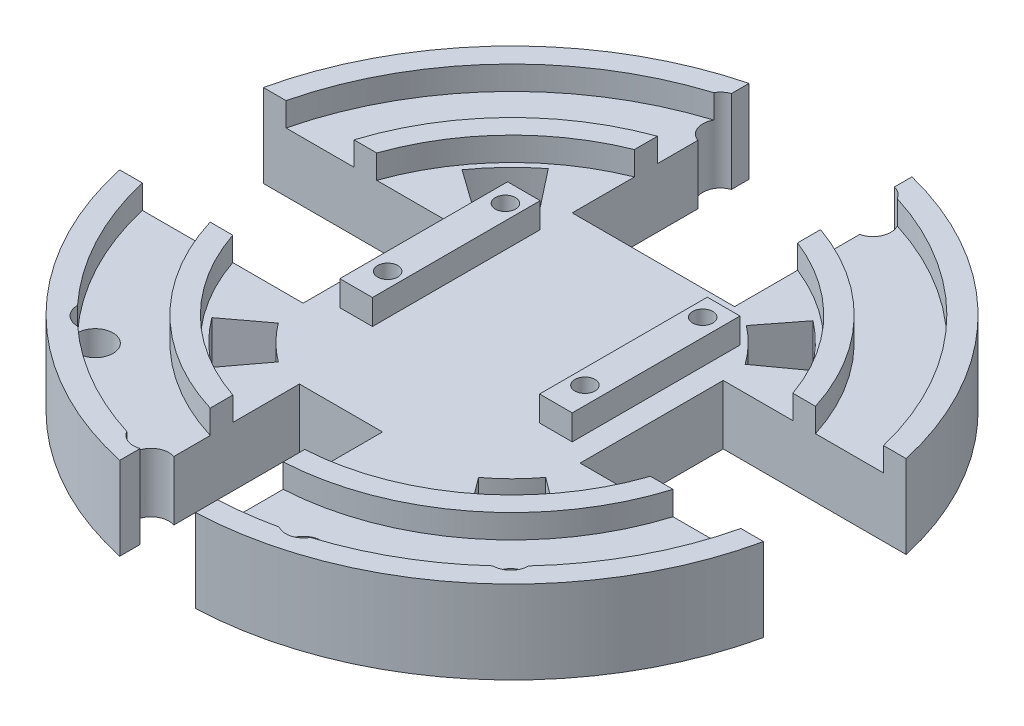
ISO-10303-21;
HEADER;
FILE_DESCRIPTION(('STEP AP214'),'2;1');
FILE_NAME('part.step','',(''),(''),'','','');
FILE_SCHEMA(('AUTOMOTIVE_DESIGN { 1 0 10303 214 1 1 1 1 }'));
ENDSEC;
DATA;
#1=APPLICATION_CONTEXT('core data for automotive mechanical design processes');
#2=APPLICATION_PROTOCOL_DEFINITION('international standard','automotive_design',2000,#1);
#3=PRODUCT_CONTEXT('',#1,'mechanical');
#4=PRODUCT('Part','Part','',(#3));
#5=PRODUCT_RELATED_PRODUCT_CATEGORY('part','',(#4));
#6=PRODUCT_DEFINITION_FORMATION('','',#4);
#7=PRODUCT_DEFINITION_CONTEXT('part definition',#1,'design');
#8=PRODUCT_DEFINITION('design','',#6,#7);
#9=PRODUCT_DEFINITION_SHAPE('','',#8);
#10=(LENGTH_UNIT() NAMED_UNIT(*) SI_UNIT(.MILLI.,.METRE.));
#11=(NAMED_UNIT(*) PLANE_ANGLE_UNIT() SI_UNIT($,.RADIAN.));
#12=(NAMED_UNIT(*) SI_UNIT($,.STERADIAN.) SOLID_ANGLE_UNIT());
#13=UNCERTAINTY_MEASURE_WITH_UNIT(LENGTH_MEASURE(1.E-05),#10,'distance_accuracy_value','');
#14=(GEOMETRIC_REPRESENTATION_CONTEXT(3) GLOBAL_UNCERTAINTY_ASSIGNED_CONTEXT((#13)) GLOBAL_UNIT_ASSIGNED_CONTEXT((#10,
#11,#12)) REPRESENTATION_CONTEXT('',''));
#15=CARTESIAN_POINT('',(0.,0.,0.));
#16=DIRECTION('',(0.,0.,1.));
#17=DIRECTION('',(1.,0.,0.));
#18=AXIS2_PLACEMENT_3D('',#15,#16,#17);
#19=CARTESIAN_POINT('',(23.39975,104.145553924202,-30.4418999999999));
#20=DIRECTION('',(1.,0.,0.));
#21=DIRECTION('',(0.,0.,-1.));
#22=AXIS2_PLACEMENT_3D('',#19,#20,#21);
#23=PLANE('',#22);
#24=DIRECTION('',(0.,0.,1.));
#25=VECTOR('',#24,1.);
#26=CARTESIAN_POINT('',(23.39975,0.,-30.4418999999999));
#27=LINE('',#26,#25);
#28=CARTESIAN_POINT('',(23.39975,0.,-49.4148598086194));
#29=VERTEX_POINT('',#28);
#30=CARTESIAN_POINT('',(23.39975,0.,-47.5381718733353));
#31=VERTEX_POINT('',#30);
#32=EDGE_CURVE('E740',#29,#31,#27,.T.);
#33=ORIENTED_EDGE('',*,*,#32,.T.);
#34=DIRECTION('',(0.,1.,0.));
#35=VECTOR('',#34,1.);
#36=CARTESIAN_POINT('',(23.39975,0.,-47.5381718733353));
#37=LINE('',#36,#35);
#38=CARTESIAN_POINT('',(23.39975,8.89000000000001,-47.5381718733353));
#39=VERTEX_POINT('',#38);
#40=EDGE_CURVE('E847',#31,#39,#37,.T.);
#41=ORIENTED_EDGE('',*,*,#40,.T.);
#42=DIRECTION('',(0.,0.,1.));
#43=VECTOR('',#42,1.);
#44=CARTESIAN_POINT('',(23.39975,8.89000000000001,-46.9738048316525));
#45=LINE('',#44,#43);
#46=CARTESIAN_POINT('',(23.39975,8.89000000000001,-49.4148598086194));
#47=VERTEX_POINT('',#46);
#48=EDGE_CURVE('E576',#47,#39,#45,.T.);
#49=ORIENTED_EDGE('',*,*,#48,.F.);
#50=DIRECTION('',(0.,-1.,0.));
#51=VECTOR('',#50,1.);
#52=CARTESIAN_POINT('',(23.39975,104.145553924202,-49.4148598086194));
#53=LINE('',#52,#51);
#54=EDGE_CURVE('E747',#47,#29,#53,.T.);
#55=ORIENTED_EDGE('',*,*,#54,.T.);
#56=EDGE_LOOP('',(#33,#41,#49,#55));
#57=FACE_BOUND('',#56,.T.);
#58=ADVANCED_FACE('F35',(#57),#23,.F.);
#59=CARTESIAN_POINT('',(7.2898,104.145553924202,0.));
#60=DIRECTION('',(-1.,0.,0.));
#61=DIRECTION('',(0.,0.,1.));
#62=AXIS2_PLACEMENT_3D('',#59,#60,#61);
#63=PLANE('',#62);
#64=DIRECTION('',(0.,0.,-1.));
#65=VECTOR('',#64,1.);
#66=CARTESIAN_POINT('',(7.2898,0.,0.));
#67=LINE('',#66,#65);
#68=CARTESIAN_POINT('',(7.28980000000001,0.,19.2218615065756));
#69=VERTEX_POINT('',#68);
#70=CARTESIAN_POINT('',(7.2898,0.,17.0391381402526));
#71=VERTEX_POINT('',#70);
#72=EDGE_CURVE('E706',#69,#71,#67,.T.);
#73=ORIENTED_EDGE('',*,*,#72,.T.);
#74=DIRECTION('',(0.,1.,0.));
#75=VECTOR('',#74,1.);
#76=CARTESIAN_POINT('',(7.2898,0.,17.0391381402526));
#77=LINE('',#76,#75);
#78=CARTESIAN_POINT('',(7.28980000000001,8.89000000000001,17.0391381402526));
#79=VERTEX_POINT('',#78);
#80=EDGE_CURVE('E1126',#71,#79,#77,.T.);
#81=ORIENTED_EDGE('',*,*,#80,.T.);
#82=DIRECTION('',(0.,0.,-1.));
#83=VECTOR('',#82,1.);
#84=CARTESIAN_POINT('',(7.28980000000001,8.89000000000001,16.7997868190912));
#85=LINE('',#84,#83);
#86=CARTESIAN_POINT('',(7.28980000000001,8.89000000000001,19.2218615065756));
#87=VERTEX_POINT('',#86);
#88=EDGE_CURVE('E539',#87,#79,#85,.T.);
#89=ORIENTED_EDGE('',*,*,#88,.F.);
#90=DIRECTION('',(0.,-1.,0.));
#91=VECTOR('',#90,1.);
#92=CARTESIAN_POINT('',(7.28980000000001,104.145553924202,19.2218615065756));
#93=LINE('',#92,#91);
#94=EDGE_CURVE('E713',#87,#69,#93,.T.);
#95=ORIENTED_EDGE('',*,*,#94,.T.);
#96=EDGE_LOOP('',(#73,#81,#89,#95));
#97=FACE_BOUND('',#96,.T.);
#98=ADVANCED_FACE('F1125',(#97),#63,.F.);
#99=CARTESIAN_POINT('',(14.81455,8.89000000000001,-15.22095));
#100=DIRECTION('',(0.,-1.,0.));
#101=DIRECTION('',(0.,0.,-1.));
#102=AXIS2_PLACEMENT_3D('',#99,#100,#101);
#103=CYLINDRICAL_SURFACE('',#102,32.893);
#104=CARTESIAN_POINT('',(14.81455,8.89000000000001,-15.22095));
#105=DIRECTION('',(0.,-1.,0.));
#106=DIRECTION('',(0.,0.,1.));
#107=AXIS2_PLACEMENT_3D('',#104,#105,#106);
#108=CIRCLE('',#107,32.893);
#109=CARTESIAN_POINT('',(37.0171630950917,8.89000000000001,9.04823665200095));
#110=VERTEX_POINT('',#109);
#111=CARTESIAN_POINT('',(24.6288826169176,8.89000000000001,16.1737680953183));
#112=VERTEX_POINT('',#111);
#113=EDGE_CURVE('E560',#110,#112,#108,.T.);
#114=ORIENTED_EDGE('',*,*,#113,.F.);
#115=DIRECTION('',(0.,1.,0.));
#116=VECTOR('',#115,1.);
#117=CARTESIAN_POINT('',(37.0171630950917,4.52120000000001,9.04823665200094));
#118=LINE('',#117,#116);
#119=CARTESIAN_POINT('',(37.0171630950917,6.35000000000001,9.04823665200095));
#120=VERTEX_POINT('',#119);
#121=EDGE_CURVE('E821',#110,#120,#118,.F.);
#122=ORIENTED_EDGE('',*,*,#121,.T.);
#123=CARTESIAN_POINT('',(14.81455,6.35000000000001,-15.22095));
#124=DIRECTION('',(0.,-1.,0.));
#125=DIRECTION('',(0.,0.,1.));
#126=AXIS2_PLACEMENT_3D('',#123,#124,#125);
#127=CIRCLE('',#126,32.893);
#128=CARTESIAN_POINT('',(24.6288826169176,6.35000000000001,16.1737680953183));
#129=VERTEX_POINT('',#128);
#130=EDGE_CURVE('E566',#120,#129,#127,.T.);
#131=ORIENTED_EDGE('',*,*,#130,.T.);
#132=DIRECTION('',(0.,1.,0.));
#133=VECTOR('',#132,1.);
#134=CARTESIAN_POINT('',(24.6288826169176,4.52120000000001,16.1737680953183));
#135=LINE('',#134,#133);
#136=EDGE_CURVE('E1141',#129,#112,#135,.T.);
#137=ORIENTED_EDGE('',*,*,#136,.T.);
#138=EDGE_LOOP('',(#114,#122,#131,#137));
#139=FACE_BOUND('',#138,.T.);
#140=ADVANCED_FACE('F1155',(#139),#103,.F.);
#141=CARTESIAN_POINT('',(21.9951122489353,8.89000000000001,16.8787225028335));
#142=VERTEX_POINT('',#141);
#143=CARTESIAN_POINT('',(16.1798,8.89000000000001,17.6437048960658));
#144=VERTEX_POINT('',#143);
#145=EDGE_CURVE('E555',#142,#144,#108,.T.);
#146=ORIENTED_EDGE('',*,*,#145,.F.);
#147=DIRECTION('',(0.,1.,0.));
#148=VECTOR('',#147,1.);
#149=CARTESIAN_POINT('',(21.9951122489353,4.52120000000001,16.8787225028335));
#150=LINE('',#149,#148);
#151=CARTESIAN_POINT('',(21.9951122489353,6.35000000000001,16.8787225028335));
#152=VERTEX_POINT('',#151);
#153=EDGE_CURVE('E57',#142,#152,#150,.F.);
#154=ORIENTED_EDGE('',*,*,#153,.T.);
#155=CARTESIAN_POINT('',(16.1798,6.35000000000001,17.6437048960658));
#156=VERTEX_POINT('',#155);
#157=EDGE_CURVE('E548',#152,#156,#127,.T.);
#158=ORIENTED_EDGE('',*,*,#157,.T.);
#159=DIRECTION('',(0.,-1.,0.));
#160=VECTOR('',#159,1.);
#161=CARTESIAN_POINT('',(16.1798,8.89000000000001,17.6437048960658));
#162=LINE('',#161,#160);
#163=EDGE_CURVE('E563',#144,#156,#162,.T.);
#164=ORIENTED_EDGE('',*,*,#163,.F.);
#165=EDGE_LOOP('',(#146,#154,#158,#164));
#166=FACE_BOUND('',#165,.T.);
#167=ADVANCED_FACE('F1150',(#166),#103,.F.);
#168=CARTESIAN_POINT('',(14.81455,8.89000000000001,-15.22095));
#169=DIRECTION('',(0.,-1.,0.));
#170=DIRECTION('',(0.,0.,-1.));
#171=AXIS2_PLACEMENT_3D('',#168,#169,#170);
#172=CYLINDRICAL_SURFACE('',#171,32.893);
#173=CARTESIAN_POINT('',(14.81455,8.89000000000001,-15.22095));
#174=DIRECTION('',(0.,-1.,0.));
#175=DIRECTION('',(0.,0.,1.));
#176=AXIS2_PLACEMENT_3D('',#173,#174,#175);
#177=CIRCLE('',#176,32.893);
#178=CARTESIAN_POINT('',(-9.32172080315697,8.89000000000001,7.12608292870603));
#179=VERTEX_POINT('',#178);
#180=CARTESIAN_POINT('',(-17.2031997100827,8.89000000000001,-7.68349999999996));
#181=VERTEX_POINT('',#180);
#182=EDGE_CURVE('E534',#179,#181,#177,.T.);
#183=ORIENTED_EDGE('',*,*,#182,.F.);
#184=DIRECTION('',(0.,1.,0.));
#185=VECTOR('',#184,1.);
#186=CARTESIAN_POINT('',(-9.32172080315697,4.52120000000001,7.12608292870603));
#187=LINE('',#186,#185);
#188=CARTESIAN_POINT('',(-9.32172080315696,6.35000000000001,7.12608292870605));
#189=VERTEX_POINT('',#188);
#190=EDGE_CURVE('E513',#179,#189,#187,.F.);
#191=ORIENTED_EDGE('',*,*,#190,.T.);
#192=CARTESIAN_POINT('',(14.81455,6.35000000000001,-15.22095));
#193=DIRECTION('',(0.,-1.,0.));
#194=DIRECTION('',(0.,0.,1.));
#195=AXIS2_PLACEMENT_3D('',#192,#193,#194);
#196=CIRCLE('',#195,32.893);
#197=CARTESIAN_POINT('',(-17.2031997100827,6.35000000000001,-7.68349999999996));
#198=VERTEX_POINT('',#197);
#199=EDGE_CURVE('E543',#189,#198,#196,.T.);
#200=ORIENTED_EDGE('',*,*,#199,.T.);
#201=DIRECTION('',(0.,-1.,0.));
#202=VECTOR('',#201,1.);
#203=CARTESIAN_POINT('',(-17.2031997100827,8.89000000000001,-7.68349999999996));
#204=LINE('',#203,#202);
#205=EDGE_CURVE('E537',#181,#198,#204,.T.);
#206=ORIENTED_EDGE('',*,*,#205,.F.);
#207=EDGE_LOOP('',(#183,#191,#200,#206));
#208=FACE_BOUND('',#207,.T.);
#209=ADVANCED_FACE('F1221',(#208),#172,.F.);
#210=CARTESIAN_POINT('',(6.02614999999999,104.145553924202,-30.4418999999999));
#211=DIRECTION('',(-1.,0.,0.));
#212=DIRECTION('',(0.,0.,1.));
#213=AXIS2_PLACEMENT_3D('',#210,#211,#212);
#214=PLANE('',#213);
#215=DIRECTION('',(0.,0.,-1.));
#216=VECTOR('',#215,1.);
#217=CARTESIAN_POINT('',(6.02614999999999,0.,-30.4418999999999));
#218=LINE('',#217,#216);
#219=CARTESIAN_POINT('',(6.02614999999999,0.,-30.4418999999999));
#220=VERTEX_POINT('',#219);
#221=CARTESIAN_POINT('',(6.02614999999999,0.,-43.8867032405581));
#222=VERTEX_POINT('',#221);
#223=EDGE_CURVE('E731',#220,#222,#218,.T.);
#224=ORIENTED_EDGE('',*,*,#223,.T.);
#225=DIRECTION('',(0.,1.,0.));
#226=VECTOR('',#225,1.);
#227=CARTESIAN_POINT('',(6.02614999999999,0.,-43.8867032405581));
#228=LINE('',#227,#226);
#229=CARTESIAN_POINT('',(6.02614999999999,6.35000000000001,-43.8867032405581));
#230=VERTEX_POINT('',#229);
#231=EDGE_CURVE('E869',#222,#230,#228,.T.);
#232=ORIENTED_EDGE('',*,*,#231,.T.);
#233=DIRECTION('',(0.,0.,-1.));
#234=VECTOR('',#233,1.);
#235=CARTESIAN_POINT('',(6.02614999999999,6.35000000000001,-30.4418999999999));
#236=LINE('',#235,#234);
#237=CARTESIAN_POINT('',(6.02614999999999,6.35000000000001,-39.5658264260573));
#238=VERTEX_POINT('',#237);
#239=EDGE_CURVE('E776',#238,#230,#236,.T.);
#240=ORIENTED_EDGE('',*,*,#239,.F.);
#241=DIRECTION('',(0.,-1.,0.));
#242=VECTOR('',#241,1.);
#243=CARTESIAN_POINT('',(6.02614999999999,8.89000000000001,-39.5658264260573));
#244=LINE('',#243,#242);
#245=CARTESIAN_POINT('',(6.02614999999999,8.89000000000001,-39.5658264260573));
#246=VERTEX_POINT('',#245);
#247=EDGE_CURVE('E1099',#246,#238,#244,.T.);
#248=ORIENTED_EDGE('',*,*,#247,.F.);
#249=DIRECTION('',(0.,0.,-1.));
#250=VECTOR('',#249,1.);
#251=CARTESIAN_POINT('',(6.02614999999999,8.89000000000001,-37.1016743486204));
#252=LINE('',#251,#250);
#253=CARTESIAN_POINT('',(6.02614999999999,8.89000000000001,-37.1016743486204));
#254=VERTEX_POINT('',#253);
#255=EDGE_CURVE('E1082',#254,#246,#252,.T.);
#256=ORIENTED_EDGE('',*,*,#255,.F.);
#257=DIRECTION('',(0.,-1.,0.));
#258=VECTOR('',#257,1.);
#259=CARTESIAN_POINT('',(6.02614999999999,8.89000000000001,-37.1016743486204));
#260=LINE('',#259,#258);
#261=CARTESIAN_POINT('',(6.02614999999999,6.35000000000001,-37.1016743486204));
#262=VERTEX_POINT('',#261);
#263=EDGE_CURVE('E1102',#254,#262,#260,.T.);
#264=ORIENTED_EDGE('',*,*,#263,.T.);
#265=CARTESIAN_POINT('',(6.02614999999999,6.35000000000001,-30.4418999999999));
#266=VERTEX_POINT('',#265);
#267=EDGE_CURVE('E774',#266,#262,#236,.T.);
#268=ORIENTED_EDGE('',*,*,#267,.F.);
#269=DIRECTION('',(0.,-1.,0.));
#270=VECTOR('',#269,1.);
#271=CARTESIAN_POINT('',(6.02614999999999,104.145553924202,-30.4418999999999));
#272=LINE('',#271,#270);
#273=EDGE_CURVE('E738',#266,#220,#272,.T.);
#274=ORIENTED_EDGE('',*,*,#273,.T.);
#275=EDGE_LOOP('',(#224,#232,#240,#248,#256,#264,#268,#274));
#276=FACE_BOUND('',#275,.T.);
#277=ADVANCED_FACE('F1257',(#276),#214,.F.);
#278=CARTESIAN_POINT('',(2.38125,6.35000000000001,-3.27025));
#279=DIRECTION('',(0.,1.,0.));
#280=DIRECTION('',(0.,0.,1.));
#281=AXIS2_PLACEMENT_3D('',#278,#279,#280);
#282=PLANE('',#281);
#283=CARTESIAN_POINT('',(6.66114999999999,6.35000000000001,15.240854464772));
#284=DIRECTION('',(0.,1.,0.));
#285=DIRECTION('',(0.,0.,1.));
#286=AXIS2_PLACEMENT_3D('',#283,#284,#285);
#287=CIRCLE('',#286,1.905);
#288=CARTESIAN_POINT('',(7.2898,6.35000000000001,13.4425707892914));
#289=VERTEX_POINT('',#288);
#290=CARTESIAN_POINT('',(5.00021738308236,6.35000000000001,16.1737680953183));
#291=VERTEX_POINT('',#290);
#292=EDGE_CURVE('E1130',#289,#291,#287,.T.);
#293=ORIENTED_EDGE('',*,*,#292,.F.);
#294=DIRECTION('',(0.,0.,-1.));
#295=VECTOR('',#294,1.);
#296=CARTESIAN_POINT('',(7.2898,6.35000000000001,0.));
#297=LINE('',#296,#295);
#298=CARTESIAN_POINT('',(7.2898,6.35000000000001,9.54368446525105));
#299=VERTEX_POINT('',#298);
#300=EDGE_CURVE('E762',#289,#299,#297,.T.);
#301=ORIENTED_EDGE('',*,*,#300,.T.);
#302=CARTESIAN_POINT('',(14.81455,6.35000000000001,-15.22095));
#303=DIRECTION('',(0.,1.,0.));
#304=DIRECTION('',(0.,0.,-1.));
#305=AXIS2_PLACEMENT_3D('',#302,#303,#304);
#306=CIRCLE('',#305,25.8826);
#307=CARTESIAN_POINT('',(-9.94622200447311,6.35000000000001,-7.68349999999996));
#308=VERTEX_POINT('',#307);
#309=EDGE_CURVE('E994',#308,#299,#306,.T.);
#310=ORIENTED_EDGE('',*,*,#309,.F.);
#311=DIRECTION('',(-1.,0.,0.));
#312=VECTOR('',#311,1.);
#313=CARTESIAN_POINT('',(-1.524,6.35000000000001,-7.68349999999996));
#314=LINE('',#313,#312);
#315=EDGE_CURVE('E767',#308,#198,#314,.T.);
#316=ORIENTED_EDGE('',*,*,#315,.T.);
#317=ORIENTED_EDGE('',*,*,#199,.F.);
#318=CARTESIAN_POINT('',(-7.4168,6.35000000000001,7.14345341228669));
#319=DIRECTION('',(0.,1.,0.));
#320=DIRECTION('',(0.,0.,1.));
#321=AXIS2_PLACEMENT_3D('',#318,#319,#320);
#322=CIRCLE('',#321,1.905);
#323=CARTESIAN_POINT('',(-7.38806309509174,6.35000000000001,9.04823665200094));
#324=VERTEX_POINT('',#323);
#325=EDGE_CURVE('E1135',#324,#189,#322,.T.);
#326=ORIENTED_EDGE('',*,*,#325,.F.);
#327=EDGE_CURVE('E527',#291,#324,#196,.T.);
#328=ORIENTED_EDGE('',*,*,#327,.F.);
#329=EDGE_LOOP('',(#293,#301,#310,#316,#317,#326,#328));
#330=FACE_BOUND('',#329,.T.);
#331=ADVANCED_FACE('F1225',(#330),#282,.T.);
#332=CARTESIAN_POINT('',(14.81455,6.35000000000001,-15.22095));
#333=DIRECTION('',(0.,-1.,0.));
#334=DIRECTION('',(0.,0.,1.));
#335=AXIS2_PLACEMENT_3D('',#332,#333,#334);
#336=CIRCLE('',#335,17.8646961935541);
#337=CARTESIAN_POINT('',(25.7813762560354,6.35000000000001,-29.3232934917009));
#338=VERTEX_POINT('',#337);
#339=CARTESIAN_POINT('',(29.3073838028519,6.35000000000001,-25.6662905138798));
#340=VERTEX_POINT('',#339);
#341=EDGE_CURVE('E872',#338,#340,#336,.T.);
#342=ORIENTED_EDGE('',*,*,#341,.F.);
#343=DIRECTION('',(-0.613882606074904,0.,0.789397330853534));
#344=VECTOR('',#343,1.);
#345=CARTESIAN_POINT('',(28.8998998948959,6.35000000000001,-33.3334319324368));
#346=LINE('',#345,#344);
#347=CARTESIAN_POINT('',(28.8998998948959,6.35000000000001,-33.3334319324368));
#348=VERTEX_POINT('',#347);
#349=EDGE_CURVE('E911',#348,#338,#346,.T.);
#350=ORIENTED_EDGE('',*,*,#349,.F.);
#351=CARTESIAN_POINT('',(14.81455,6.35000000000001,-15.22095));
#352=DIRECTION('',(0.,1.,0.));
#353=DIRECTION('',(0.,0.,-1.));
#354=AXIS2_PLACEMENT_3D('',#351,#352,#353);
#355=CIRCLE('',#354,22.9446961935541);
#356=CARTESIAN_POINT('',(33.4285619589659,6.35000000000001,-28.6365246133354));
#357=VERTEX_POINT('',#356);
#358=EDGE_CURVE('E925',#357,#348,#355,.T.);
#359=ORIENTED_EDGE('',*,*,#358,.F.);
#360=DIRECTION('',(0.811255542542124,0.,-0.584691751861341));
#361=VECTOR('',#360,1.);
#362=CARTESIAN_POINT('',(29.3073838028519,6.35000000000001,-25.6662905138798));
#363=LINE('',#362,#361);
#364=EDGE_CURVE('E922',#340,#357,#363,.T.);
#365=ORIENTED_EDGE('',*,*,#364,.F.);
#366=EDGE_LOOP('',(#342,#350,#359,#365));
#367=FACE_BOUND('',#366,.T.);
#368=CARTESIAN_POINT('',(14.81455,6.35000000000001,-15.22095));
#369=DIRECTION('',(0.,-1.,0.));
#370=DIRECTION('',(0.,0.,1.));
#371=AXIS2_PLACEMENT_3D('',#368,#369,#370);
#372=CIRCLE('',#371,17.8646961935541);
#373=CARTESIAN_POINT('',(4.11075068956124,6.35000000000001,-0.917941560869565));
#374=VERTEX_POINT('',#373);
#375=CARTESIAN_POINT('',(0.517627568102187,6.35000000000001,-4.50902304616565));
#376=VERTEX_POINT('',#375);
#377=EDGE_CURVE('E887',#374,#376,#372,.T.);
#378=ORIENTED_EDGE('',*,*,#377,.F.);
#379=DIRECTION('',(0.599159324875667,0.,-0.8006298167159));
#380=VECTOR('',#379,1.);
#381=CARTESIAN_POINT('',(4.11075068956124,6.35000000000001,-0.917941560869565));
#382=LINE('',#381,#380);
#383=CARTESIAN_POINT('',(1.06702131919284,6.35000000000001,3.14925790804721));
#384=VERTEX_POINT('',#383);
#385=EDGE_CURVE('E877',#384,#374,#382,.T.);
#386=ORIENTED_EDGE('',*,*,#385,.F.);
#387=CARTESIAN_POINT('',(14.81455,6.35000000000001,-15.22095));
#388=DIRECTION('',(0.,1.,0.));
#389=DIRECTION('',(0.,0.,1.));
#390=AXIS2_PLACEMENT_3D('',#387,#388,#389);
#391=CIRCLE('',#390,22.9446961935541);
#392=CARTESIAN_POINT('',(-3.54784128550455,6.35000000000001,-1.46298250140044));
#393=VERTEX_POINT('',#392);
#394=EDGE_CURVE('E893',#393,#384,#391,.T.);
#395=ORIENTED_EDGE('',*,*,#394,.F.);
#396=DIRECTION('',(-0.800289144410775,0.,0.599614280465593));
#397=VECTOR('',#396,1.);
#398=CARTESIAN_POINT('',(0.517627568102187,6.35000000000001,-4.50902304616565));
#399=LINE('',#398,#397);
#400=EDGE_CURVE('E889',#376,#393,#399,.T.);
#401=ORIENTED_EDGE('',*,*,#400,.F.);
#402=EDGE_LOOP('',(#378,#386,#395,#401));
#403=FACE_BOUND('',#402,.T.);
#404=CARTESIAN_POINT('',(14.81455,6.35000000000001,-15.22095));
#405=DIRECTION('',(0.,-1.,0.));
#406=DIRECTION('',(0.,0.,1.));
#407=AXIS2_PLACEMENT_3D('',#404,#405,#406);
#408=CIRCLE('',#407,17.8646961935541);
#409=CARTESIAN_POINT('',(29.1175584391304,6.35000000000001,-4.51715068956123));
#410=VERTEX_POINT('',#409);
#411=CARTESIAN_POINT('',(25.5264769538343,6.35000000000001,-0.924027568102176));
#412=VERTEX_POINT('',#411);
#413=EDGE_CURVE('E900',#410,#412,#408,.T.);
#414=ORIENTED_EDGE('',*,*,#413,.F.);
#415=DIRECTION('',(-0.8006298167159,0.,-0.599159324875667));
#416=VECTOR('',#415,1.);
#417=CARTESIAN_POINT('',(29.1175584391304,6.35000000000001,-4.51715068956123));
#418=LINE('',#417,#416);
#419=CARTESIAN_POINT('',(33.1847579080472,6.35000000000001,-1.47342131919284));
#420=VERTEX_POINT('',#419);
#421=EDGE_CURVE('E941',#420,#410,#418,.T.);
#422=ORIENTED_EDGE('',*,*,#421,.F.);
#423=CARTESIAN_POINT('',(14.81455,6.35000000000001,-15.22095));
#424=DIRECTION('',(0.,1.,0.));
#425=DIRECTION('',(0.,0.,1.));
#426=AXIS2_PLACEMENT_3D('',#423,#424,#425);
#427=CIRCLE('',#426,22.9446961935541);
#428=CARTESIAN_POINT('',(28.5725174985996,6.35000000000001,3.14144128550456));
#429=VERTEX_POINT('',#428);
#430=EDGE_CURVE('E955',#429,#420,#427,.T.);
#431=ORIENTED_EDGE('',*,*,#430,.F.);
#432=DIRECTION('',(0.599614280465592,0.,0.800289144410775));
#433=VECTOR('',#432,1.);
#434=CARTESIAN_POINT('',(28.5725174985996,6.35000000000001,3.14144128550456));
#435=LINE('',#434,#433);
#436=EDGE_CURVE('E952',#412,#429,#435,.T.);
#437=ORIENTED_EDGE('',*,*,#436,.F.);
#438=EDGE_LOOP('',(#414,#422,#431,#437));
#439=FACE_BOUND('',#438,.T.);
#440=CARTESIAN_POINT('',(14.81455,6.35000000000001,-15.22095));
#441=DIRECTION('',(0.,1.,0.));
#442=DIRECTION('',(0.,0.,-1.));
#443=AXIS2_PLACEMENT_3D('',#440,#441,#442);
#444=CIRCLE('',#443,22.9446961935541);
#445=CARTESIAN_POINT('',(0.64540405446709,6.35000000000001,-33.2679549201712));
#446=VERTEX_POINT('',#445);
#447=CARTESIAN_POINT('',(-3.86144024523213,6.35000000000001,-28.5501087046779));
#448=VERTEX_POINT('',#447);
#449=EDGE_CURVE('E962',#446,#448,#444,.T.);
#450=ORIENTED_EDGE('',*,*,#449,.F.);
#451=DIRECTION('',(-0.617534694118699,0.,-0.786543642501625));
#452=VECTOR('',#451,1.);
#453=CARTESIAN_POINT('',(0.64540405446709,6.35000000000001,-33.2679549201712));
#454=LINE('',#453,#452);
#455=CARTESIAN_POINT('',(3.78248030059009,6.35000000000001,-29.2723132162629));
#456=VERTEX_POINT('',#455);
#457=EDGE_CURVE('E973',#456,#446,#454,.T.);
#458=ORIENTED_EDGE('',*,*,#457,.F.);
#459=CARTESIAN_POINT('',(14.81455,6.35000000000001,-15.22095));
#460=DIRECTION('',(0.,-1.,0.));
#461=DIRECTION('',(0.,0.,-1.));
#462=AXIS2_PLACEMENT_3D('',#459,#460,#461);
#463=CIRCLE('',#462,17.8646961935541);
#464=CARTESIAN_POINT('',(0.273460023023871,6.35000000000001,-25.5990072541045));
#465=VERTEX_POINT('',#464);
#466=EDGE_CURVE('E987',#465,#456,#463,.T.);
#467=ORIENTED_EDGE('',*,*,#466,.F.);
#468=DIRECTION('',(0.813956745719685,0.,0.58092548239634));
#469=VECTOR('',#468,1.);
#470=CARTESIAN_POINT('',(-3.86144024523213,6.35000000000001,-28.5501087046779));
#471=LINE('',#470,#469);
#472=EDGE_CURVE('E984',#448,#465,#471,.T.);
#473=ORIENTED_EDGE('',*,*,#472,.F.);
#474=EDGE_LOOP('',(#450,#458,#467,#473));
#475=FACE_BOUND('',#474,.T.);
#476=DIRECTION('',(0.,0.,1.));
#477=VECTOR('',#476,1.);
#478=CARTESIAN_POINT('',(23.75535,6.35000000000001,-9.22655000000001));
#479=LINE('',#478,#477);
#480=CARTESIAN_POINT('',(23.75535,6.35000000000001,-27.17165));
#481=VERTEX_POINT('',#480);
#482=CARTESIAN_POINT('',(23.75535,6.35000000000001,-9.22655000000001));
#483=VERTEX_POINT('',#482);
#484=EDGE_CURVE('E622',#481,#483,#479,.T.);
#485=ORIENTED_EDGE('',*,*,#484,.F.);
#486=DIRECTION('',(-1.,0.,0.));
#487=VECTOR('',#486,1.);
#488=CARTESIAN_POINT('',(27.24785,6.35000000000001,-27.17165));
#489=LINE('',#488,#487);
#490=CARTESIAN_POINT('',(27.24785,6.35000000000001,-27.17165));
#491=VERTEX_POINT('',#490);
#492=EDGE_CURVE('E627',#491,#481,#489,.T.);
#493=ORIENTED_EDGE('',*,*,#492,.F.);
#494=DIRECTION('',(0.,0.,-1.));
#495=VECTOR('',#494,1.);
#496=CARTESIAN_POINT('',(27.24785,6.35000000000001,-9.22655000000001));
#497=LINE('',#496,#495);
#498=CARTESIAN_POINT('',(27.24785,6.35000000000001,-9.22655000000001));
#499=VERTEX_POINT('',#498);
#500=EDGE_CURVE('E613',#499,#491,#497,.T.);
#501=ORIENTED_EDGE('',*,*,#500,.F.);
#502=DIRECTION('',(1.,0.,0.));
#503=VECTOR('',#502,1.);
#504=CARTESIAN_POINT('',(27.24785,6.35000000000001,-9.22655000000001));
#505=LINE('',#504,#503);
#506=EDGE_CURVE('E618',#483,#499,#505,.T.);
#507=ORIENTED_EDGE('',*,*,#506,.F.);
#508=EDGE_LOOP('',(#485,#493,#501,#507));
#509=FACE_BOUND('',#508,.T.);
#510=DIRECTION('',(0.,0.,1.));
#511=VECTOR('',#510,1.);
#512=CARTESIAN_POINT('',(2.38125,6.35000000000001,-27.17165));
#513=LINE('',#512,#511);
#514=CARTESIAN_POINT('',(2.38125,6.35000000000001,-27.17165));
#515=VERTEX_POINT('',#514);
#516=CARTESIAN_POINT('',(2.38125,6.35000000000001,-9.22655000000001));
#517=VERTEX_POINT('',#516);
#518=EDGE_CURVE('E660',#515,#517,#513,.T.);
#519=ORIENTED_EDGE('',*,*,#518,.F.);
#520=DIRECTION('',(-1.,0.,0.));
#521=VECTOR('',#520,1.);
#522=CARTESIAN_POINT('',(5.87375,6.35000000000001,-27.17165));
#523=LINE('',#522,#521);
#524=CARTESIAN_POINT('',(5.87375,6.35000000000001,-27.17165));
#525=VERTEX_POINT('',#524);
#526=EDGE_CURVE('E665',#525,#515,#523,.T.);
#527=ORIENTED_EDGE('',*,*,#526,.F.);
#528=DIRECTION('',(0.,0.,-1.));
#529=VECTOR('',#528,1.);
#530=CARTESIAN_POINT('',(5.87375,6.35000000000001,-9.22655));
#531=LINE('',#530,#529);
#532=CARTESIAN_POINT('',(5.87375,6.35000000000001,-9.22655));
#533=VERTEX_POINT('',#532);
#534=EDGE_CURVE('E651',#533,#525,#531,.T.);
#535=ORIENTED_EDGE('',*,*,#534,.F.);
#536=DIRECTION('',(1.,0.,0.));
#537=VECTOR('',#536,1.);
#538=CARTESIAN_POINT('',(5.87375,6.35000000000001,-9.22655));
#539=LINE('',#538,#537);
#540=EDGE_CURVE('E656',#517,#533,#539,.T.);
#541=ORIENTED_EDGE('',*,*,#540,.F.);
#542=EDGE_LOOP('',(#519,#527,#535,#541));
#543=FACE_BOUND('',#542,.T.);
#544=CARTESIAN_POINT('',(0.,6.35000000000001,-7.68349999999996));
#545=VERTEX_POINT('',#544);
#546=CARTESIAN_POINT('',(-7.52798611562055,6.35000000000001,-7.68349999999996));
#547=VERTEX_POINT('',#546);
#548=EDGE_CURVE('E765',#545,#547,#314,.T.);
#549=ORIENTED_EDGE('',*,*,#548,.T.);
#550=CARTESIAN_POINT('',(14.81455,6.35000000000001,-15.22095));
#551=DIRECTION('',(0.,-1.,0.));
#552=DIRECTION('',(0.,0.,1.));
#553=AXIS2_PLACEMENT_3D('',#550,#551,#552);
#554=CIRCLE('',#553,23.5796961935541);
#555=CARTESIAN_POINT('',(7.28980000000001,6.35000000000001,7.1258665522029));
#556=VERTEX_POINT('',#555);
#557=EDGE_CURVE('E1005',#556,#547,#554,.T.);
#558=ORIENTED_EDGE('',*,*,#557,.F.);
#559=CARTESIAN_POINT('',(7.2898,6.35000000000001,0.));
#560=VERTEX_POINT('',#559);
#561=EDGE_CURVE('E764',#556,#560,#297,.T.);
#562=ORIENTED_EDGE('',*,*,#561,.T.);
#563=DIRECTION('',(1.,0.,0.));
#564=VECTOR('',#563,1.);
#565=CARTESIAN_POINT('',(7.2898,6.35000000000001,0.));
#566=LINE('',#565,#564);
#567=CARTESIAN_POINT('',(16.1798,6.35000000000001,0.));
#568=VERTEX_POINT('',#567);
#569=EDGE_CURVE('E759',#560,#568,#566,.T.);
#570=ORIENTED_EDGE('',*,*,#569,.T.);
#571=DIRECTION('',(0.,0.,1.));
#572=VECTOR('',#571,1.);
#573=CARTESIAN_POINT('',(16.1798,6.35000000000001,0.));
#574=LINE('',#573,#572);
#575=CARTESIAN_POINT('',(16.1798,6.35000000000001,8.31918944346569));
#576=VERTEX_POINT('',#575);
#577=EDGE_CURVE('E756',#568,#576,#574,.T.);
#578=ORIENTED_EDGE('',*,*,#577,.T.);
#579=CARTESIAN_POINT('',(14.81455,6.35000000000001,-15.22095));
#580=DIRECTION('',(0.,-1.,0.));
#581=DIRECTION('',(0.,0.,1.));
#582=AXIS2_PLACEMENT_3D('',#579,#580,#581);
#583=CIRCLE('',#582,23.5796961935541);
#584=CARTESIAN_POINT('',(37.1570861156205,6.35000000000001,-7.68349999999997));
#585=VERTEX_POINT('',#584);
#586=EDGE_CURVE('E1059',#585,#576,#583,.T.);
#587=ORIENTED_EDGE('',*,*,#586,.F.);
#588=DIRECTION('',(-1.,0.,0.));
#589=VECTOR('',#588,1.);
#590=CARTESIAN_POINT('',(29.6291,6.35000000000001,-7.68349999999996));
#591=LINE('',#590,#589);
#592=CARTESIAN_POINT('',(29.6291,6.35000000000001,-7.68349999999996));
#593=VERTEX_POINT('',#592);
#594=EDGE_CURVE('E692',#585,#593,#591,.T.);
#595=ORIENTED_EDGE('',*,*,#594,.T.);
#596=DIRECTION('',(0.,0.,-1.));
#597=VECTOR('',#596,1.);
#598=CARTESIAN_POINT('',(29.6291,6.35000000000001,-7.68349999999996));
#599=LINE('',#598,#597);
#600=CARTESIAN_POINT('',(29.6291,6.35000000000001,-22.9997));
#601=VERTEX_POINT('',#600);
#602=EDGE_CURVE('E786',#593,#601,#599,.T.);
#603=ORIENTED_EDGE('',*,*,#602,.T.);
#604=DIRECTION('',(1.,0.,0.));
#605=VECTOR('',#604,1.);
#606=CARTESIAN_POINT('',(31.1531,6.35000000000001,-22.9997));
#607=LINE('',#606,#605);
#608=CARTESIAN_POINT('',(37.074224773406,6.35000000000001,-22.9997));
#609=VERTEX_POINT('',#608);
#610=EDGE_CURVE('E783',#601,#609,#607,.T.);
#611=ORIENTED_EDGE('',*,*,#610,.T.);
#612=CARTESIAN_POINT('',(14.81455,6.35000000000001,-15.22095));
#613=DIRECTION('',(0.,-1.,0.));
#614=DIRECTION('',(0.,0.,-1.));
#615=AXIS2_PLACEMENT_3D('',#612,#613,#614);
#616=CIRCLE('',#615,23.5796961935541);
#617=CARTESIAN_POINT('',(23.39975,6.35000000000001,-37.1821979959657));
#618=VERTEX_POINT('',#617);
#619=EDGE_CURVE('E1027',#618,#609,#616,.T.);
#620=ORIENTED_EDGE('',*,*,#619,.F.);
#621=DIRECTION('',(0.,0.,1.));
#622=VECTOR('',#621,1.);
#623=CARTESIAN_POINT('',(23.39975,6.35000000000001,-30.4418999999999));
#624=LINE('',#623,#622);
#625=CARTESIAN_POINT('',(23.39975,6.35000000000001,-30.4418999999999));
#626=VERTEX_POINT('',#625);
#627=EDGE_CURVE('E782',#618,#626,#624,.T.);
#628=ORIENTED_EDGE('',*,*,#627,.T.);
#629=DIRECTION('',(-1.,0.,0.));
#630=VECTOR('',#629,1.);
#631=CARTESIAN_POINT('',(6.02614999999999,6.35000000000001,-30.4418999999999));
#632=LINE('',#631,#630);
#633=EDGE_CURVE('E777',#626,#266,#632,.T.);
#634=ORIENTED_EDGE('',*,*,#633,.T.);
#635=ORIENTED_EDGE('',*,*,#267,.T.);
#636=CARTESIAN_POINT('',(14.81455,6.35000000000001,-15.22095));
#637=DIRECTION('',(0.,-1.,0.));
#638=DIRECTION('',(0.,0.,1.));
#639=AXIS2_PLACEMENT_3D('',#636,#637,#638);
#640=CIRCLE('',#639,23.5796961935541);
#641=CARTESIAN_POINT('',(-7.44512477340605,6.35000000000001,-22.9997));
#642=VERTEX_POINT('',#641);
#643=EDGE_CURVE('E1078',#642,#262,#640,.T.);
#644=ORIENTED_EDGE('',*,*,#643,.F.);
#645=DIRECTION('',(1.,0.,0.));
#646=VECTOR('',#645,1.);
#647=CARTESIAN_POINT('',(0.,6.35000000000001,-22.9997));
#648=LINE('',#647,#646);
#649=CARTESIAN_POINT('',(0.,6.35000000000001,-22.9997));
#650=VERTEX_POINT('',#649);
#651=EDGE_CURVE('E773',#642,#650,#648,.T.);
#652=ORIENTED_EDGE('',*,*,#651,.T.);
#653=DIRECTION('',(0.,0.,1.));
#654=VECTOR('',#653,1.);
#655=CARTESIAN_POINT('',(0.,6.35000000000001,-7.68349999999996));
#656=LINE('',#655,#654);
#657=EDGE_CURVE('E768',#650,#545,#656,.T.);
#658=ORIENTED_EDGE('',*,*,#657,.T.);
#659=EDGE_LOOP('',(#549,#558,#562,#570,#578,#587,#595,#603,#611,#620,#628,#634,#635,#644,#652,#658));
#660=FACE_BOUND('',#659,.T.);
#661=ADVANCED_FACE('F1179',(#367,#403,#439,#475,#509,#543,#660),#282,.T.);
#662=CARTESIAN_POINT('',(22.96795,6.35000000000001,-45.6827544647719));
#663=DIRECTION('',(0.,1.,0.));
#664=DIRECTION('',(0.,0.,1.));
#665=AXIS2_PLACEMENT_3D('',#662,#663,#664);
#666=CIRCLE('',#665,1.905);
#667=CARTESIAN_POINT('',(23.39975,6.35000000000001,-43.8273370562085));
#668=VERTEX_POINT('',#667);
#669=CARTESIAN_POINT('',(24.6288826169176,6.35000000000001,-46.6156680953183));
#670=VERTEX_POINT('',#669);
#671=EDGE_CURVE('E853',#668,#670,#666,.T.);
#672=ORIENTED_EDGE('',*,*,#671,.F.);
#673=CARTESIAN_POINT('',(23.39975,6.35000000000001,-39.6382251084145));
#674=VERTEX_POINT('',#673);
#675=EDGE_CURVE('E780',#668,#674,#624,.T.);
#676=ORIENTED_EDGE('',*,*,#675,.T.);
#677=CARTESIAN_POINT('',(14.81455,6.35000000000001,-15.22095));
#678=DIRECTION('',(0.,1.,0.));
#679=DIRECTION('',(0.,0.,1.));
#680=AXIS2_PLACEMENT_3D('',#677,#678,#679);
#681=CIRCLE('',#680,25.8826);
#682=CARTESIAN_POINT('',(39.5005790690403,6.35000000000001,-22.9997));
#683=VERTEX_POINT('',#682);
#684=EDGE_CURVE('E1032',#683,#674,#681,.T.);
#685=ORIENTED_EDGE('',*,*,#684,.F.);
#686=CARTESIAN_POINT('',(46.7745327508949,6.35000000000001,-22.9997));
#687=VERTEX_POINT('',#686);
#688=EDGE_CURVE('E785',#683,#687,#607,.T.);
#689=ORIENTED_EDGE('',*,*,#688,.T.);
#690=CARTESIAN_POINT('',(14.81455,6.35000000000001,-15.22095));
#691=DIRECTION('',(0.,-1.,0.));
#692=DIRECTION('',(0.,0.,1.));
#693=AXIS2_PLACEMENT_3D('',#690,#691,#692);
#694=CIRCLE('',#693,32.893);
#695=EDGE_CURVE('E572',#670,#687,#694,.T.);
#696=ORIENTED_EDGE('',*,*,#695,.F.);
#697=EDGE_LOOP('',(#672,#676,#685,#689,#696));
#698=FACE_BOUND('',#697,.T.);
#699=ADVANCED_FACE('F1274',(#698),#282,.T.);
#700=CARTESIAN_POINT('',(37.0459,6.35000000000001,7.1434534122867));
#701=DIRECTION('',(0.,1.,0.));
#702=DIRECTION('',(0.,0.,1.));
#703=AXIS2_PLACEMENT_3D('',#700,#701,#702);
#704=CIRCLE('',#703,1.905);
#705=CARTESIAN_POINT('',(38.950820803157,6.35000000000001,7.12608292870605));
#706=VERTEX_POINT('',#705);
#707=EDGE_CURVE('E843',#706,#120,#704,.T.);
#708=ORIENTED_EDGE('',*,*,#707,.F.);
#709=CARTESIAN_POINT('',(46.8322997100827,6.35000000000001,-7.68349999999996));
#710=VERTEX_POINT('',#709);
#711=EDGE_CURVE('E553',#710,#706,#127,.T.);
#712=ORIENTED_EDGE('',*,*,#711,.F.);
#713=CARTESIAN_POINT('',(39.5753220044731,6.35000000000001,-7.68349999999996));
#714=VERTEX_POINT('',#713);
#715=EDGE_CURVE('E789',#710,#714,#591,.T.);
#716=ORIENTED_EDGE('',*,*,#715,.T.);
#717=CARTESIAN_POINT('',(14.81455,6.35000000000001,-15.22095));
#718=DIRECTION('',(0.,1.,0.));
#719=DIRECTION('',(0.,0.,1.));
#720=AXIS2_PLACEMENT_3D('',#717,#718,#719);
#721=CIRCLE('',#720,25.8826);
#722=CARTESIAN_POINT('',(16.1798,6.35000000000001,10.6256179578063));
#723=VERTEX_POINT('',#722);
#724=EDGE_CURVE('E1054',#723,#714,#721,.T.);
#725=ORIENTED_EDGE('',*,*,#724,.F.);
#726=EDGE_CURVE('E758',#723,#156,#574,.T.);
#727=ORIENTED_EDGE('',*,*,#726,.T.);
#728=ORIENTED_EDGE('',*,*,#157,.F.);
#729=CARTESIAN_POINT('',(22.96795,6.35000000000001,15.240854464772));
#730=DIRECTION('',(0.,1.,0.));
#731=DIRECTION('',(0.,0.,1.));
#732=AXIS2_PLACEMENT_3D('',#729,#730,#731);
#733=CIRCLE('',#732,1.905);
#734=EDGE_CURVE('E829',#129,#152,#733,.T.);
#735=ORIENTED_EDGE('',*,*,#734,.F.);
#736=ORIENTED_EDGE('',*,*,#130,.F.);
#737=EDGE_LOOP('',(#708,#712,#716,#725,#727,#728,#735,#736));
#738=FACE_BOUND('',#737,.T.);
#739=ADVANCED_FACE('F37',(#738),#282,.T.);
#740=CARTESIAN_POINT('',(6.66115,6.35000000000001,-45.6827544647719));
#741=DIRECTION('',(0.,1.,0.));
#742=DIRECTION('',(0.,0.,1.));
#743=AXIS2_PLACEMENT_3D('',#740,#741,#742);
#744=CIRCLE('',#743,1.905);
#745=CARTESIAN_POINT('',(5.00021738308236,6.35000000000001,-46.6156680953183));
#746=VERTEX_POINT('',#745);
#747=EDGE_CURVE('E867',#746,#230,#744,.T.);
#748=ORIENTED_EDGE('',*,*,#747,.F.);
#749=CARTESIAN_POINT('',(14.81455,6.35000000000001,-15.22095));
#750=DIRECTION('',(0.,-1.,0.));
#751=DIRECTION('',(0.,0.,-1.));
#752=AXIS2_PLACEMENT_3D('',#749,#750,#751);
#753=CIRCLE('',#752,32.893);
#754=CARTESIAN_POINT('',(-17.1454327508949,6.35000000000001,-22.9997));
#755=VERTEX_POINT('',#754);
#756=EDGE_CURVE('E1105',#755,#746,#753,.T.);
#757=ORIENTED_EDGE('',*,*,#756,.F.);
#758=CARTESIAN_POINT('',(-9.87147906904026,6.35000000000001,-22.9997));
#759=VERTEX_POINT('',#758);
#760=EDGE_CURVE('E771',#755,#759,#648,.T.);
#761=ORIENTED_EDGE('',*,*,#760,.T.);
#762=CARTESIAN_POINT('',(14.81455,6.35000000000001,-15.22095));
#763=DIRECTION('',(0.,1.,0.));
#764=DIRECTION('',(0.,0.,-1.));
#765=AXIS2_PLACEMENT_3D('',#762,#763,#764);
#766=CIRCLE('',#765,25.8826);
#767=EDGE_CURVE('E1083',#238,#759,#766,.T.);
#768=ORIENTED_EDGE('',*,*,#767,.F.);
#769=ORIENTED_EDGE('',*,*,#239,.T.);
#770=EDGE_LOOP('',(#748,#757,#761,#768,#769));
#771=FACE_BOUND('',#770,.T.);
#772=ADVANCED_FACE('F1332',(#771),#282,.T.);
#773=CARTESIAN_POINT('',(29.6291,104.145553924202,-7.68349999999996));
#774=DIRECTION('',(-1.,0.,0.));
#775=DIRECTION('',(0.,0.,1.));
#776=AXIS2_PLACEMENT_3D('',#773,#774,#775);
#777=PLANE('',#776);
#778=ORIENTED_EDGE('',*,*,#602,.F.);
#779=DIRECTION('',(0.,-1.,0.));
#780=VECTOR('',#779,1.);
#781=CARTESIAN_POINT('',(29.6291,104.145553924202,-7.68349999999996));
#782=LINE('',#781,#780);
#783=CARTESIAN_POINT('',(29.6291,0.,-7.68349999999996));
#784=VERTEX_POINT('',#783);
#785=EDGE_CURVE('E686',#593,#784,#782,.T.);
#786=ORIENTED_EDGE('',*,*,#785,.T.);
#787=DIRECTION('',(0.,0.,-1.));
#788=VECTOR('',#787,1.);
#789=CARTESIAN_POINT('',(29.6291,0.,-7.68349999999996));
#790=LINE('',#789,#788);
#791=CARTESIAN_POINT('',(29.6291,0.,-22.9997));
#792=VERTEX_POINT('',#791);
#793=EDGE_CURVE('E753',#784,#792,#790,.T.);
#794=ORIENTED_EDGE('',*,*,#793,.T.);
#795=DIRECTION('',(0.,-1.,0.));
#796=VECTOR('',#795,1.);
#797=CARTESIAN_POINT('',(29.6291,104.145553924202,-22.9997));
#798=LINE('',#797,#796);
#799=EDGE_CURVE('E752',#601,#792,#798,.T.);
#800=ORIENTED_EDGE('',*,*,#799,.F.);
#801=EDGE_LOOP('',(#778,#786,#794,#800));
#802=FACE_BOUND('',#801,.T.);
#803=ADVANCED_FACE('F1174',(#802),#777,.F.);
#804=CARTESIAN_POINT('',(31.1531,104.145553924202,-22.9997));
#805=DIRECTION('',(0.,0.,-1.));
#806=DIRECTION('',(-1.,0.,0.));
#807=AXIS2_PLACEMENT_3D('',#804,#805,#806);
#808=PLANE('',#807);
#809=ORIENTED_EDGE('',*,*,#610,.F.);
#810=ORIENTED_EDGE('',*,*,#799,.T.);
#811=DIRECTION('',(1.,0.,0.));
#812=VECTOR('',#811,1.);
#813=CARTESIAN_POINT('',(31.1531,0.,-22.9997));
#814=LINE('',#813,#812);
#815=CARTESIAN_POINT('',(49.2008870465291,0.,-22.9997));
#816=VERTEX_POINT('',#815);
#817=EDGE_CURVE('E749',#792,#816,#814,.T.);
#818=ORIENTED_EDGE('',*,*,#817,.T.);
#819=DIRECTION('',(0.,-1.,0.));
#820=VECTOR('',#819,1.);
#821=CARTESIAN_POINT('',(49.2008870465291,104.145553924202,-22.9997));
#822=LINE('',#821,#820);
#823=CARTESIAN_POINT('',(49.2008870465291,8.89000000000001,-22.9997));
#824=VERTEX_POINT('',#823);
#825=EDGE_CURVE('E748',#824,#816,#822,.T.);
#826=ORIENTED_EDGE('',*,*,#825,.F.);
#827=DIRECTION('',(1.,0.,0.));
#828=VECTOR('',#827,1.);
#829=CARTESIAN_POINT('',(46.7745327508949,8.89000000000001,-22.9997));
#830=LINE('',#829,#828);
#831=CARTESIAN_POINT('',(46.7745327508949,8.89000000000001,-22.9997));
#832=VERTEX_POINT('',#831);
#833=EDGE_CURVE('E581',#832,#824,#830,.T.);
#834=ORIENTED_EDGE('',*,*,#833,.F.);
#835=DIRECTION('',(0.,-1.,0.));
#836=VECTOR('',#835,1.);
#837=CARTESIAN_POINT('',(46.7745327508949,8.89000000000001,-22.9997));
#838=LINE('',#837,#836);
#839=EDGE_CURVE('E584',#832,#687,#838,.T.);
#840=ORIENTED_EDGE('',*,*,#839,.T.);
#841=ORIENTED_EDGE('',*,*,#688,.F.);
#842=DIRECTION('',(0.,-1.,0.));
#843=VECTOR('',#842,1.);
#844=CARTESIAN_POINT('',(39.5005790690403,8.89000000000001,-22.9997));
#845=LINE('',#844,#843);
#846=CARTESIAN_POINT('',(39.5005790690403,8.89000000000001,-22.9997));
#847=VERTEX_POINT('',#846);
#848=EDGE_CURVE('E1048',#847,#683,#845,.T.);
#849=ORIENTED_EDGE('',*,*,#848,.F.);
#850=DIRECTION('',(1.,0.,0.));
#851=VECTOR('',#850,1.);
#852=CARTESIAN_POINT('',(37.074224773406,8.89000000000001,-22.9997));
#853=LINE('',#852,#851);
#854=CARTESIAN_POINT('',(37.074224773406,8.89000000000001,-22.9997));
#855=VERTEX_POINT('',#854);
#856=EDGE_CURVE('E1031',#855,#847,#853,.T.);
#857=ORIENTED_EDGE('',*,*,#856,.F.);
#858=DIRECTION('',(0.,-1.,0.));
#859=VECTOR('',#858,1.);
#860=CARTESIAN_POINT('',(37.074224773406,8.89000000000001,-22.9997));
#861=LINE('',#860,#859);
#862=EDGE_CURVE('E1051',#855,#609,#861,.T.);
#863=ORIENTED_EDGE('',*,*,#862,.T.);
#864=EDGE_LOOP('',(#809,#810,#818,#826,#834,#840,#841,#849,#857,#863));
#865=FACE_BOUND('',#864,.T.);
#866=ADVANCED_FACE('F1290',(#865),#808,.F.);
#867=CARTESIAN_POINT('',(14.81455,104.145553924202,-15.22095));
#868=DIRECTION('',(0.,-1.,0.));
#869=DIRECTION('',(0.,0.,-1.));
#870=AXIS2_PLACEMENT_3D('',#867,#868,#869);
#871=CYLINDRICAL_SURFACE('',#870,35.2552);
#872=ORIENTED_EDGE('',*,*,#54,.F.);
#873=CARTESIAN_POINT('',(14.81455,8.89000000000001,-15.22095));
#874=DIRECTION('',(0.,1.,0.));
#875=DIRECTION('',(0.,0.,1.));
#876=AXIS2_PLACEMENT_3D('',#873,#874,#875);
#877=CIRCLE('',#876,35.2552);
#878=EDGE_CURVE('E573',#824,#47,#877,.T.);
#879=ORIENTED_EDGE('',*,*,#878,.F.);
#880=ORIENTED_EDGE('',*,*,#825,.T.);
#881=CARTESIAN_POINT('',(14.81455,0.,-15.22095));
#882=DIRECTION('',(0.,1.,0.));
#883=DIRECTION('',(0.,0.,-1.));
#884=AXIS2_PLACEMENT_3D('',#881,#882,#883);
#885=CIRCLE('',#884,35.2552);
#886=EDGE_CURVE('E744',#816,#29,#885,.T.);
#887=ORIENTED_EDGE('',*,*,#886,.T.);
#888=EDGE_LOOP('',(#872,#879,#880,#887));
#889=FACE_BOUND('',#888,.T.);
#890=ADVANCED_FACE('F1288',(#889),#871,.T.);
#891=ORIENTED_EDGE('',*,*,#675,.F.);
#892=DIRECTION('',(0.,1.,0.));
#893=VECTOR('',#892,1.);
#894=CARTESIAN_POINT('',(23.39975,0.,-43.8273370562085));
#895=LINE('',#894,#893);
#896=CARTESIAN_POINT('',(23.39975,0.,-43.8273370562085));
#897=VERTEX_POINT('',#896);
#898=EDGE_CURVE('E855',#668,#897,#895,.F.);
#899=ORIENTED_EDGE('',*,*,#898,.T.);
#900=CARTESIAN_POINT('',(23.39975,0.,-30.4418999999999));
#901=VERTEX_POINT('',#900);
#902=EDGE_CURVE('E743',#897,#901,#27,.T.);
#903=ORIENTED_EDGE('',*,*,#902,.T.);
#904=DIRECTION('',(0.,-1.,0.));
#905=VECTOR('',#904,1.);
#906=CARTESIAN_POINT('',(23.39975,104.145553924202,-30.4418999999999));
#907=LINE('',#906,#905);
#908=EDGE_CURVE('E739',#626,#901,#907,.T.);
#909=ORIENTED_EDGE('',*,*,#908,.F.);
#910=ORIENTED_EDGE('',*,*,#627,.F.);
#911=DIRECTION('',(0.,-1.,0.));
#912=VECTOR('',#911,1.);
#913=CARTESIAN_POINT('',(23.39975,8.89000000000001,-37.1821979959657));
#914=LINE('',#913,#912);
#915=CARTESIAN_POINT('',(23.39975,8.89000000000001,-37.1821979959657));
#916=VERTEX_POINT('',#915);
#917=EDGE_CURVE('E1038',#916,#618,#914,.T.);
#918=ORIENTED_EDGE('',*,*,#917,.F.);
#919=DIRECTION('',(0.,0.,1.));
#920=VECTOR('',#919,1.);
#921=CARTESIAN_POINT('',(23.39975,8.89000000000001,-39.6382251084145));
#922=LINE('',#921,#920);
#923=CARTESIAN_POINT('',(23.39975,8.89000000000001,-39.6382251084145));
#924=VERTEX_POINT('',#923);
#925=EDGE_CURVE('E1036',#924,#916,#922,.T.);
#926=ORIENTED_EDGE('',*,*,#925,.F.);
#927=DIRECTION('',(0.,-1.,0.));
#928=VECTOR('',#927,1.);
#929=CARTESIAN_POINT('',(23.39975,8.89000000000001,-39.6382251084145));
#930=LINE('',#929,#928);
#931=EDGE_CURVE('E1045',#924,#674,#930,.T.);
#932=ORIENTED_EDGE('',*,*,#931,.T.);
#933=EDGE_LOOP('',(#891,#899,#903,#909,#910,#918,#926,#932));
#934=FACE_BOUND('',#933,.T.);
#935=ADVANCED_FACE('F1269',(#934),#23,.F.);
#936=CARTESIAN_POINT('',(6.02614999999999,104.145553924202,-30.4418999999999));
#937=DIRECTION('',(0.,0.,1.));
#938=DIRECTION('',(1.,0.,0.));
#939=AXIS2_PLACEMENT_3D('',#936,#937,#938);
#940=PLANE('',#939);
#941=ORIENTED_EDGE('',*,*,#633,.F.);
#942=ORIENTED_EDGE('',*,*,#908,.T.);
#943=DIRECTION('',(-1.,0.,0.));
#944=VECTOR('',#943,1.);
#945=CARTESIAN_POINT('',(6.02614999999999,0.,-30.4418999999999));
#946=LINE('',#945,#944);
#947=EDGE_CURVE('E735',#901,#220,#946,.T.);
#948=ORIENTED_EDGE('',*,*,#947,.T.);
#949=ORIENTED_EDGE('',*,*,#273,.F.);
#950=EDGE_LOOP('',(#941,#942,#948,#949));
#951=FACE_BOUND('',#950,.T.);
#952=ADVANCED_FACE('F1263',(#951),#940,.F.);
#953=DIRECTION('',(0.,0.,-1.));
#954=VECTOR('',#953,1.);
#955=CARTESIAN_POINT('',(6.02614999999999,8.89000000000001,-46.918165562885));
#956=LINE('',#955,#954);
#957=CARTESIAN_POINT('',(6.02614999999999,8.89000000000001,-47.4788056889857));
#958=VERTEX_POINT('',#957);
#959=CARTESIAN_POINT('',(6.02614999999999,8.89000000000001,-49.3631987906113));
#960=VERTEX_POINT('',#959);
#961=EDGE_CURVE('E1114',#958,#960,#956,.T.);
#962=ORIENTED_EDGE('',*,*,#961,.F.);
#963=DIRECTION('',(0.,1.,0.));
#964=VECTOR('',#963,1.);
#965=CARTESIAN_POINT('',(6.02614999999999,0.,-47.4788056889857));
#966=LINE('',#965,#964);
#967=CARTESIAN_POINT('',(6.02614999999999,0.,-47.4788056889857));
#968=VERTEX_POINT('',#967);
#969=EDGE_CURVE('E864',#958,#968,#966,.F.);
#970=ORIENTED_EDGE('',*,*,#969,.T.);
#971=CARTESIAN_POINT('',(6.02614999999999,0.,-49.3631987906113));
#972=VERTEX_POINT('',#971);
#973=EDGE_CURVE('E734',#968,#972,#218,.T.);
#974=ORIENTED_EDGE('',*,*,#973,.T.);
#975=DIRECTION('',(0.,-1.,0.));
#976=VECTOR('',#975,1.);
#977=CARTESIAN_POINT('',(6.02614999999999,104.145553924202,-49.3631987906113));
#978=LINE('',#977,#976);
#979=EDGE_CURVE('E730',#960,#972,#978,.T.);
#980=ORIENTED_EDGE('',*,*,#979,.F.);
#981=EDGE_LOOP('',(#962,#970,#974,#980));
#982=FACE_BOUND('',#981,.T.);
#983=ADVANCED_FACE('F1252',(#982),#214,.F.);
#984=CARTESIAN_POINT('',(14.81455,104.145553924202,-15.22095));
#985=DIRECTION('',(0.,-1.,0.));
#986=DIRECTION('',(0.,0.,-1.));
#987=AXIS2_PLACEMENT_3D('',#984,#985,#986);
#988=CYLINDRICAL_SURFACE('',#987,35.2552);
#989=DIRECTION('',(0.,-1.,0.));
#990=VECTOR('',#989,1.);
#991=CARTESIAN_POINT('',(-19.5717870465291,104.145553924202,-22.9997));
#992=LINE('',#991,#990);
#993=CARTESIAN_POINT('',(-19.5717870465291,8.89000000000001,-22.9997));
#994=VERTEX_POINT('',#993);
#995=CARTESIAN_POINT('',(-19.5717870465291,0.,-22.9997));
#996=VERTEX_POINT('',#995);
#997=EDGE_CURVE('E726',#994,#996,#992,.T.);
#998=ORIENTED_EDGE('',*,*,#997,.F.);
#999=CARTESIAN_POINT('',(14.81455,8.89000000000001,-15.22095));
#1000=DIRECTION('',(0.,1.,0.));
#1001=DIRECTION('',(0.,0.,1.));
#1002=AXIS2_PLACEMENT_3D('',#999,#1000,#1001);
#1003=CIRCLE('',#1002,35.2552);
#1004=EDGE_CURVE('E1106',#960,#994,#1003,.T.);
#1005=ORIENTED_EDGE('',*,*,#1004,.F.);
#1006=ORIENTED_EDGE('',*,*,#979,.T.);
#1007=CARTESIAN_POINT('',(14.81455,0.,-15.22095));
#1008=DIRECTION('',(0.,1.,0.));
#1009=DIRECTION('',(0.,0.,-1.));
#1010=AXIS2_PLACEMENT_3D('',#1007,#1008,#1009);
#1011=CIRCLE('',#1010,35.2552);
#1012=EDGE_CURVE('E727',#972,#996,#1011,.T.);
#1013=ORIENTED_EDGE('',*,*,#1012,.T.);
#1014=EDGE_LOOP('',(#998,#1005,#1006,#1013));
#1015=FACE_BOUND('',#1014,.T.);
#1016=ADVANCED_FACE('F1247',(#1015),#988,.T.);
#1017=CARTESIAN_POINT('',(0.,104.145553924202,-22.9997));
#1018=DIRECTION('',(0.,0.,-1.));
#1019=DIRECTION('',(-1.,0.,0.));
#1020=AXIS2_PLACEMENT_3D('',#1017,#1018,#1019);
#1021=PLANE('',#1020);
#1022=ORIENTED_EDGE('',*,*,#760,.F.);
#1023=DIRECTION('',(0.,-1.,0.));
#1024=VECTOR('',#1023,1.);
#1025=CARTESIAN_POINT('',(-17.1454327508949,8.89000000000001,-22.9997));
#1026=LINE('',#1025,#1024);
#1027=CARTESIAN_POINT('',(-17.1454327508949,8.89000000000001,-22.9997));
#1028=VERTEX_POINT('',#1027);
#1029=EDGE_CURVE('E545',#1028,#755,#1026,.T.);
#1030=ORIENTED_EDGE('',*,*,#1029,.F.);
#1031=DIRECTION('',(1.,0.,0.));
#1032=VECTOR('',#1031,1.);
#1033=CARTESIAN_POINT('',(-19.5717870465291,8.89000000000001,-22.9997));
#1034=LINE('',#1033,#1032);
#1035=EDGE_CURVE('E1109',#994,#1028,#1034,.T.);
#1036=ORIENTED_EDGE('',*,*,#1035,.F.);
#1037=ORIENTED_EDGE('',*,*,#997,.T.);
#1038=DIRECTION('',(1.,0.,0.));
#1039=VECTOR('',#1038,1.);
#1040=CARTESIAN_POINT('',(0.,0.,-22.9997));
#1041=LINE('',#1040,#1039);
#1042=CARTESIAN_POINT('',(0.,0.,-22.9997));
#1043=VERTEX_POINT('',#1042);
#1044=EDGE_CURVE('E723',#996,#1043,#1041,.T.);
#1045=ORIENTED_EDGE('',*,*,#1044,.T.);
#1046=DIRECTION('',(0.,-1.,0.));
#1047=VECTOR('',#1046,1.);
#1048=CARTESIAN_POINT('',(0.,104.145553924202,-22.9997));
#1049=LINE('',#1048,#1047);
#1050=EDGE_CURVE('E722',#650,#1043,#1049,.T.);
#1051=ORIENTED_EDGE('',*,*,#1050,.F.);
#1052=ORIENTED_EDGE('',*,*,#651,.F.);
#1053=DIRECTION('',(0.,-1.,0.));
#1054=VECTOR('',#1053,1.);
#1055=CARTESIAN_POINT('',(-7.44512477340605,8.89000000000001,-22.9997));
#1056=LINE('',#1055,#1054);
#1057=CARTESIAN_POINT('',(-7.44512477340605,8.89000000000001,-22.9997));
#1058=VERTEX_POINT('',#1057);
#1059=EDGE_CURVE('E1089',#1058,#642,#1056,.T.);
#1060=ORIENTED_EDGE('',*,*,#1059,.F.);
#1061=DIRECTION('',(1.,0.,0.));
#1062=VECTOR('',#1061,1.);
#1063=CARTESIAN_POINT('',(-7.44512477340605,8.89000000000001,-22.9997));
#1064=LINE('',#1063,#1062);
#1065=CARTESIAN_POINT('',(-9.87147906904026,8.89000000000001,-22.9996999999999));
#1066=VERTEX_POINT('',#1065);
#1067=EDGE_CURVE('E1087',#1066,#1058,#1064,.T.);
#1068=ORIENTED_EDGE('',*,*,#1067,.F.);
#1069=DIRECTION('',(0.,-1.,0.));
#1070=VECTOR('',#1069,1.);
#1071=CARTESIAN_POINT('',(-9.87147906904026,8.89000000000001,-22.9996999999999));
#1072=LINE('',#1071,#1070);
#1073=EDGE_CURVE('E1096',#1066,#759,#1072,.T.);
#1074=ORIENTED_EDGE('',*,*,#1073,.T.);
#1075=EDGE_LOOP('',(#1022,#1030,#1036,#1037,#1045,#1051,#1052,#1060,#1068,#1074));
#1076=FACE_BOUND('',#1075,.T.);
#1077=ADVANCED_FACE('F1242',(#1076),#1021,.F.);
#1078=CARTESIAN_POINT('',(0.,104.145553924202,-7.68349999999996));
#1079=DIRECTION('',(1.,0.,0.));
#1080=DIRECTION('',(0.,0.,-1.));
#1081=AXIS2_PLACEMENT_3D('',#1078,#1079,#1080);
#1082=PLANE('',#1081);
#1083=ORIENTED_EDGE('',*,*,#657,.F.);
#1084=ORIENTED_EDGE('',*,*,#1050,.T.);
#1085=DIRECTION('',(0.,0.,1.));
#1086=VECTOR('',#1085,1.);
#1087=CARTESIAN_POINT('',(0.,0.,-7.68349999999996));
#1088=LINE('',#1087,#1086);
#1089=CARTESIAN_POINT('',(0.,0.,-7.68349999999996));
#1090=VERTEX_POINT('',#1089);
#1091=EDGE_CURVE('E719',#1043,#1090,#1088,.T.);
#1092=ORIENTED_EDGE('',*,*,#1091,.T.);
#1093=DIRECTION('',(0.,-1.,0.));
#1094=VECTOR('',#1093,1.);
#1095=CARTESIAN_POINT('',(0.,104.145553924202,-7.68349999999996));
#1096=LINE('',#1095,#1094);
#1097=EDGE_CURVE('E718',#545,#1090,#1096,.T.);
#1098=ORIENTED_EDGE('',*,*,#1097,.F.);
#1099=EDGE_LOOP('',(#1083,#1084,#1092,#1098));
#1100=FACE_BOUND('',#1099,.T.);
#1101=ADVANCED_FACE('F1239',(#1100),#1082,.F.);
#1102=CARTESIAN_POINT('',(-1.524,104.145553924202,-7.68349999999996));
#1103=DIRECTION('',(0.,0.,1.));
#1104=DIRECTION('',(1.,0.,0.));
#1105=AXIS2_PLACEMENT_3D('',#1102,#1103,#1104);
#1106=PLANE('',#1105);
#1107=ORIENTED_EDGE('',*,*,#548,.F.);
#1108=ORIENTED_EDGE('',*,*,#1097,.T.);
#1109=DIRECTION('',(-1.,0.,0.));
#1110=VECTOR('',#1109,1.);
#1111=CARTESIAN_POINT('',(-1.524,0.,-7.68349999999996));
#1112=LINE('',#1111,#1110);
#1113=CARTESIAN_POINT('',(-19.6254844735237,0.,-7.68349999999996));
#1114=VERTEX_POINT('',#1113);
#1115=EDGE_CURVE('E715',#1090,#1114,#1112,.T.);
#1116=ORIENTED_EDGE('',*,*,#1115,.T.);
#1117=DIRECTION('',(0.,-1.,0.));
#1118=VECTOR('',#1117,1.);
#1119=CARTESIAN_POINT('',(-19.6254844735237,104.145553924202,-7.68349999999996));
#1120=LINE('',#1119,#1118);
#1121=CARTESIAN_POINT('',(-19.6254844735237,8.89000000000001,-7.68349999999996));
#1122=VERTEX_POINT('',#1121);
#1123=EDGE_CURVE('E714',#1122,#1114,#1120,.T.);
#1124=ORIENTED_EDGE('',*,*,#1123,.F.);
#1125=DIRECTION('',(-1.,0.,0.));
#1126=VECTOR('',#1125,1.);
#1127=CARTESIAN_POINT('',(-19.6254844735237,8.89000000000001,-7.68349999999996));
#1128=LINE('',#1127,#1126);
#1129=EDGE_CURVE('E533',#181,#1122,#1128,.T.);
#1130=ORIENTED_EDGE('',*,*,#1129,.F.);
#1131=ORIENTED_EDGE('',*,*,#205,.T.);
#1132=ORIENTED_EDGE('',*,*,#315,.F.);
#1133=DIRECTION('',(0.,-1.,0.));
#1134=VECTOR('',#1133,1.);
#1135=CARTESIAN_POINT('',(-9.94622200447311,8.89000000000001,-7.68349999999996));
#1136=LINE('',#1135,#1134);
#1137=CARTESIAN_POINT('',(-9.94622200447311,8.89000000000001,-7.68349999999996));
#1138=VERTEX_POINT('',#1137);
#1139=EDGE_CURVE('E1011',#1138,#308,#1136,.T.);
#1140=ORIENTED_EDGE('',*,*,#1139,.F.);
#1141=DIRECTION('',(-1.,0.,0.));
#1142=VECTOR('',#1141,1.);
#1143=CARTESIAN_POINT('',(-7.52798611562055,8.89000000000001,-7.68349999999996));
#1144=LINE('',#1143,#1142);
#1145=CARTESIAN_POINT('',(-7.52798611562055,8.89000000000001,-7.68349999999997));
#1146=VERTEX_POINT('',#1145);
#1147=EDGE_CURVE('E1009',#1146,#1138,#1144,.T.);
#1148=ORIENTED_EDGE('',*,*,#1147,.F.);
#1149=DIRECTION('',(0.,-1.,0.));
#1150=VECTOR('',#1149,1.);
#1151=CARTESIAN_POINT('',(-7.52798611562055,8.89000000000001,-7.68349999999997));
#1152=LINE('',#1151,#1150);
#1153=EDGE_CURVE('E1018',#1146,#547,#1152,.T.);
#1154=ORIENTED_EDGE('',*,*,#1153,.T.);
#1155=EDGE_LOOP('',(#1107,#1108,#1116,#1124,#1130,#1131,#1132,#1140,#1148,#1154));
#1156=FACE_BOUND('',#1155,.T.);
#1157=ADVANCED_FACE('F1230',(#1156),#1106,.F.);
#1158=CARTESIAN_POINT('',(14.81455,104.145553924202,-15.22095));
#1159=DIRECTION('',(0.,-1.,0.));
#1160=DIRECTION('',(0.,0.,-1.));
#1161=AXIS2_PLACEMENT_3D('',#1158,#1159,#1160);
#1162=CYLINDRICAL_SURFACE('',#1161,35.2552);
#1163=ORIENTED_EDGE('',*,*,#94,.F.);
#1164=CARTESIAN_POINT('',(14.81455,8.89000000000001,-15.22095));
#1165=DIRECTION('',(0.,1.,0.));
#1166=DIRECTION('',(0.,0.,1.));
#1167=AXIS2_PLACEMENT_3D('',#1164,#1165,#1166);
#1168=CIRCLE('',#1167,35.2552);
#1169=EDGE_CURVE('E1119',#1122,#87,#1168,.T.);
#1170=ORIENTED_EDGE('',*,*,#1169,.F.);
#1171=ORIENTED_EDGE('',*,*,#1123,.T.);
#1172=CARTESIAN_POINT('',(14.81455,0.,-15.22095));
#1173=DIRECTION('',(0.,1.,0.));
#1174=DIRECTION('',(0.,0.,-1.));
#1175=AXIS2_PLACEMENT_3D('',#1172,#1173,#1174);
#1176=CIRCLE('',#1175,35.2552);
#1177=EDGE_CURVE('E710',#1114,#69,#1176,.T.);
#1178=ORIENTED_EDGE('',*,*,#1177,.T.);
#1179=EDGE_LOOP('',(#1163,#1170,#1171,#1178));
#1180=FACE_BOUND('',#1179,.T.);
#1181=ADVANCED_FACE('F1232',(#1180),#1162,.T.);
#1182=ORIENTED_EDGE('',*,*,#300,.F.);
#1183=DIRECTION('',(0.,1.,0.));
#1184=VECTOR('',#1183,1.);
#1185=CARTESIAN_POINT('',(7.2898,0.,13.4425707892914));
#1186=LINE('',#1185,#1184);
#1187=CARTESIAN_POINT('',(7.2898,0.,13.4425707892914));
#1188=VERTEX_POINT('',#1187);
#1189=EDGE_CURVE('E1133',#289,#1188,#1186,.F.);
#1190=ORIENTED_EDGE('',*,*,#1189,.T.);
#1191=CARTESIAN_POINT('',(7.2898,0.,0.));
#1192=VERTEX_POINT('',#1191);
#1193=EDGE_CURVE('E709',#1188,#1192,#67,.T.);
#1194=ORIENTED_EDGE('',*,*,#1193,.T.);
#1195=DIRECTION('',(0.,-1.,0.));
#1196=VECTOR('',#1195,1.);
#1197=CARTESIAN_POINT('',(7.2898,104.145553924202,0.));
#1198=LINE('',#1197,#1196);
#1199=EDGE_CURVE('E705',#560,#1192,#1198,.T.);
#1200=ORIENTED_EDGE('',*,*,#1199,.F.);
#1201=ORIENTED_EDGE('',*,*,#561,.F.);
#1202=DIRECTION('',(0.,-1.,0.));
#1203=VECTOR('',#1202,1.);
#1204=CARTESIAN_POINT('',(7.28980000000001,8.89000000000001,7.1258665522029));
#1205=LINE('',#1204,#1203);
#1206=CARTESIAN_POINT('',(7.28980000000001,8.89000000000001,7.1258665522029));
#1207=VERTEX_POINT('',#1206);
#1208=EDGE_CURVE('E1021',#1207,#556,#1205,.T.);
#1209=ORIENTED_EDGE('',*,*,#1208,.F.);
#1210=DIRECTION('',(0.,0.,-1.));
#1211=VECTOR('',#1210,1.);
#1212=CARTESIAN_POINT('',(7.28980000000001,8.89000000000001,9.54368446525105));
#1213=LINE('',#1212,#1211);
#1214=CARTESIAN_POINT('',(7.28980000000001,8.89000000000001,9.54368446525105));
#1215=VERTEX_POINT('',#1214);
#1216=EDGE_CURVE('E1004',#1215,#1207,#1213,.T.);
#1217=ORIENTED_EDGE('',*,*,#1216,.F.);
#1218=DIRECTION('',(0.,-1.,0.));
#1219=VECTOR('',#1218,1.);
#1220=CARTESIAN_POINT('',(7.28980000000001,8.89000000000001,9.54368446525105));
#1221=LINE('',#1220,#1219);
#1222=EDGE_CURVE('E1024',#1215,#299,#1221,.T.);
#1223=ORIENTED_EDGE('',*,*,#1222,.T.);
#1224=EDGE_LOOP('',(#1182,#1190,#1194,#1200,#1201,#1209,#1217,#1223));
#1225=FACE_BOUND('',#1224,.T.);
#1226=ADVANCED_FACE('F1200',(#1225),#63,.F.);
#1227=CARTESIAN_POINT('',(7.2898,104.145553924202,0.));
#1228=DIRECTION('',(0.,0.,-1.));
#1229=DIRECTION('',(-1.,0.,0.));
#1230=AXIS2_PLACEMENT_3D('',#1227,#1228,#1229);
#1231=PLANE('',#1230);
#1232=ORIENTED_EDGE('',*,*,#569,.F.);
#1233=ORIENTED_EDGE('',*,*,#1199,.T.);
#1234=DIRECTION('',(1.,0.,0.));
#1235=VECTOR('',#1234,1.);
#1236=CARTESIAN_POINT('',(7.2898,0.,0.));
#1237=LINE('',#1236,#1235);
#1238=CARTESIAN_POINT('',(16.1798,0.,0.));
#1239=VERTEX_POINT('',#1238);
#1240=EDGE_CURVE('E702',#1192,#1239,#1237,.T.);
#1241=ORIENTED_EDGE('',*,*,#1240,.T.);
#1242=DIRECTION('',(0.,-1.,0.));
#1243=VECTOR('',#1242,1.);
#1244=CARTESIAN_POINT('',(16.1798,104.145553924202,0.));
#1245=LINE('',#1244,#1243);
#1246=EDGE_CURVE('E701',#568,#1239,#1245,.T.);
#1247=ORIENTED_EDGE('',*,*,#1246,.F.);
#1248=EDGE_LOOP('',(#1232,#1233,#1241,#1247));
#1249=FACE_BOUND('',#1248,.T.);
#1250=ADVANCED_FACE('F1193',(#1249),#1231,.F.);
#1251=CARTESIAN_POINT('',(16.1798,104.145553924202,0.));
#1252=DIRECTION('',(1.,0.,0.));
#1253=DIRECTION('',(0.,0.,-1.));
#1254=AXIS2_PLACEMENT_3D('',#1251,#1252,#1253);
#1255=PLANE('',#1254);
#1256=ORIENTED_EDGE('',*,*,#577,.F.);
#1257=ORIENTED_EDGE('',*,*,#1246,.T.);
#1258=DIRECTION('',(0.,0.,1.));
#1259=VECTOR('',#1258,1.);
#1260=CARTESIAN_POINT('',(16.1798,0.,0.));
#1261=LINE('',#1260,#1259);
#1262=CARTESIAN_POINT('',(16.1798,0.,20.0078055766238));
#1263=VERTEX_POINT('',#1262);
#1264=EDGE_CURVE('E698',#1239,#1263,#1261,.T.);
#1265=ORIENTED_EDGE('',*,*,#1264,.T.);
#1266=DIRECTION('',(0.,-1.,0.));
#1267=VECTOR('',#1266,1.);
#1268=CARTESIAN_POINT('',(16.1798,104.145553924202,20.0078055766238));
#1269=LINE('',#1268,#1267);
#1270=CARTESIAN_POINT('',(16.1798,8.89000000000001,20.0078055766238));
#1271=VERTEX_POINT('',#1270);
#1272=EDGE_CURVE('E697',#1271,#1263,#1269,.T.);
#1273=ORIENTED_EDGE('',*,*,#1272,.F.);
#1274=DIRECTION('',(0.,0.,1.));
#1275=VECTOR('',#1274,1.);
#1276=CARTESIAN_POINT('',(16.1798,8.89000000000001,20.0078055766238));
#1277=LINE('',#1276,#1275);
#1278=EDGE_CURVE('E559',#144,#1271,#1277,.T.);
#1279=ORIENTED_EDGE('',*,*,#1278,.F.);
#1280=ORIENTED_EDGE('',*,*,#163,.T.);
#1281=ORIENTED_EDGE('',*,*,#726,.F.);
#1282=DIRECTION('',(0.,-1.,0.));
#1283=VECTOR('',#1282,1.);
#1284=CARTESIAN_POINT('',(16.1798,8.89000000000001,10.6256179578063));
#1285=LINE('',#1284,#1283);
#1286=CARTESIAN_POINT('',(16.1798,8.89000000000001,10.6256179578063));
#1287=VERTEX_POINT('',#1286);
#1288=EDGE_CURVE('E1065',#1287,#723,#1285,.T.);
#1289=ORIENTED_EDGE('',*,*,#1288,.F.);
#1290=DIRECTION('',(0.,0.,1.));
#1291=VECTOR('',#1290,1.);
#1292=CARTESIAN_POINT('',(16.1798,8.89000000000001,10.6256179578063));
#1293=LINE('',#1292,#1291);
#1294=CARTESIAN_POINT('',(16.1798,8.89000000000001,8.31918944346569));
#1295=VERTEX_POINT('',#1294);
#1296=EDGE_CURVE('E1063',#1295,#1287,#1293,.T.);
#1297=ORIENTED_EDGE('',*,*,#1296,.F.);
#1298=DIRECTION('',(0.,-1.,0.));
#1299=VECTOR('',#1298,1.);
#1300=CARTESIAN_POINT('',(16.1798,8.89000000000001,8.31918944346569));
#1301=LINE('',#1300,#1299);
#1302=EDGE_CURVE('E1071',#1295,#576,#1301,.T.);
#1303=ORIENTED_EDGE('',*,*,#1302,.T.);
#1304=EDGE_LOOP('',(#1256,#1257,#1265,#1273,#1279,#1280,#1281,#1289,#1297,#1303));
#1305=FACE_BOUND('',#1304,.T.);
#1306=ADVANCED_FACE('F1158',(#1305),#1255,.F.);
#1307=CARTESIAN_POINT('',(14.81455,104.145553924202,-15.22095));
#1308=DIRECTION('',(0.,-1.,0.));
#1309=DIRECTION('',(0.,0.,-1.));
#1310=AXIS2_PLACEMENT_3D('',#1307,#1308,#1309);
#1311=CYLINDRICAL_SURFACE('',#1310,35.2552);
#1312=DIRECTION('',(0.,-1.,0.));
#1313=VECTOR('',#1312,1.);
#1314=CARTESIAN_POINT('',(49.2545844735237,104.145553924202,-7.68349999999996));
#1315=LINE('',#1314,#1313);
#1316=CARTESIAN_POINT('',(49.2545844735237,8.89000000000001,-7.68349999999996));
#1317=VERTEX_POINT('',#1316);
#1318=CARTESIAN_POINT('',(49.2545844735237,0.,-7.68349999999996));
#1319=VERTEX_POINT('',#1318);
#1320=EDGE_CURVE('E693',#1317,#1319,#1315,.T.);
#1321=ORIENTED_EDGE('',*,*,#1320,.F.);
#1322=CARTESIAN_POINT('',(14.81455,8.89000000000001,-15.22095));
#1323=DIRECTION('',(0.,1.,0.));
#1324=DIRECTION('',(0.,0.,1.));
#1325=AXIS2_PLACEMENT_3D('',#1322,#1323,#1324);
#1326=CIRCLE('',#1325,35.2552);
#1327=EDGE_CURVE('E549',#1271,#1317,#1326,.T.);
#1328=ORIENTED_EDGE('',*,*,#1327,.F.);
#1329=ORIENTED_EDGE('',*,*,#1272,.T.);
#1330=CARTESIAN_POINT('',(14.81455,0.,-15.22095));
#1331=DIRECTION('',(0.,1.,0.));
#1332=DIRECTION('',(0.,0.,1.));
#1333=AXIS2_PLACEMENT_3D('',#1330,#1331,#1332);
#1334=CIRCLE('',#1333,35.2552);
#1335=EDGE_CURVE('E694',#1263,#1319,#1334,.T.);
#1336=ORIENTED_EDGE('',*,*,#1335,.T.);
#1337=EDGE_LOOP('',(#1321,#1328,#1329,#1336));
#1338=FACE_BOUND('',#1337,.T.);
#1339=ADVANCED_FACE('F1162',(#1338),#1311,.T.);
#1340=CARTESIAN_POINT('',(29.6291,104.145553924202,-7.68349999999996));
#1341=DIRECTION('',(0.,0.,1.));
#1342=DIRECTION('',(1.,0.,0.));
#1343=AXIS2_PLACEMENT_3D('',#1340,#1341,#1342);
#1344=PLANE('',#1343);
#1345=ORIENTED_EDGE('',*,*,#715,.F.);
#1346=DIRECTION('',(0.,-1.,0.));
#1347=VECTOR('',#1346,1.);
#1348=CARTESIAN_POINT('',(46.8322997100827,8.89000000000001,-7.68349999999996));
#1349=LINE('',#1348,#1347);
#1350=CARTESIAN_POINT('',(46.8322997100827,8.89000000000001,-7.68349999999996));
#1351=VERTEX_POINT('',#1350);
#1352=EDGE_CURVE('E569',#1351,#710,#1349,.T.);
#1353=ORIENTED_EDGE('',*,*,#1352,.F.);
#1354=DIRECTION('',(-1.,0.,0.));
#1355=VECTOR('',#1354,1.);
#1356=CARTESIAN_POINT('',(46.8322997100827,8.89000000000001,-7.68349999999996));
#1357=LINE('',#1356,#1355);
#1358=EDGE_CURVE('E552',#1317,#1351,#1357,.T.);
#1359=ORIENTED_EDGE('',*,*,#1358,.F.);
#1360=ORIENTED_EDGE('',*,*,#1320,.T.);
#1361=DIRECTION('',(-1.,0.,0.));
#1362=VECTOR('',#1361,1.);
#1363=CARTESIAN_POINT('',(29.6291,0.,-7.68349999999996));
#1364=LINE('',#1363,#1362);
#1365=EDGE_CURVE('E689',#1319,#784,#1364,.T.);
#1366=ORIENTED_EDGE('',*,*,#1365,.T.);
#1367=ORIENTED_EDGE('',*,*,#785,.F.);
#1368=ORIENTED_EDGE('',*,*,#594,.F.);
#1369=DIRECTION('',(0.,-1.,0.));
#1370=VECTOR('',#1369,1.);
#1371=CARTESIAN_POINT('',(37.1570861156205,8.89000000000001,-7.68349999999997));
#1372=LINE('',#1371,#1370);
#1373=CARTESIAN_POINT('',(37.1570861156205,8.89000000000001,-7.68349999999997));
#1374=VERTEX_POINT('',#1373);
#1375=EDGE_CURVE('E1074',#1374,#585,#1372,.T.);
#1376=ORIENTED_EDGE('',*,*,#1375,.F.);
#1377=DIRECTION('',(-1.,0.,0.));
#1378=VECTOR('',#1377,1.);
#1379=CARTESIAN_POINT('',(39.5753220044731,8.89000000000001,-7.68349999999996));
#1380=LINE('',#1379,#1378);
#1381=CARTESIAN_POINT('',(39.5753220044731,8.89000000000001,-7.68349999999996));
#1382=VERTEX_POINT('',#1381);
#1383=EDGE_CURVE('E1058',#1382,#1374,#1380,.T.);
#1384=ORIENTED_EDGE('',*,*,#1383,.F.);
#1385=DIRECTION('',(0.,-1.,0.));
#1386=VECTOR('',#1385,1.);
#1387=CARTESIAN_POINT('',(39.5753220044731,8.89000000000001,-7.68349999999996));
#1388=LINE('',#1387,#1386);
#1389=EDGE_CURVE('E839',#1382,#714,#1388,.T.);
#1390=ORIENTED_EDGE('',*,*,#1389,.T.);
#1391=EDGE_LOOP('',(#1345,#1353,#1359,#1360,#1366,#1367,#1368,#1376,#1384,#1390));
#1392=FACE_BOUND('',#1391,.T.);
#1393=ADVANCED_FACE('F836',(#1392),#1344,.F.);
#1394=CARTESIAN_POINT('',(14.81455,0.,-15.22095));
#1395=DIRECTION('',(0.,-1.,0.));
#1396=DIRECTION('',(0.,0.,-1.));
#1397=AXIS2_PLACEMENT_3D('',#1394,#1395,#1396);
#1398=PLANE('',#1397);
#1399=CARTESIAN_POINT('',(37.0459,0.,7.1434534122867));
#1400=DIRECTION('',(0.,1.,0.));
#1401=DIRECTION('',(0.,0.,1.));
#1402=AXIS2_PLACEMENT_3D('',#1399,#1400,#1401);
#1403=CIRCLE('',#1402,1.905);
#1404=CARTESIAN_POINT('',(37.0459,0.,9.0484534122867));
#1405=VERTEX_POINT('',#1404);
#1406=EDGE_CURVE('E1211',#1405,#1405,#1403,.T.);
#1407=ORIENTED_EDGE('',*,*,#1406,.T.);
#1408=EDGE_LOOP('',(#1407));
#1409=FACE_BOUND('',#1408,.T.);
#1410=CARTESIAN_POINT('',(22.96795,0.,15.240854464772));
#1411=DIRECTION('',(0.,1.,0.));
#1412=DIRECTION('',(0.,0.,1.));
#1413=AXIS2_PLACEMENT_3D('',#1410,#1411,#1412);
#1414=CIRCLE('',#1413,1.905);
#1415=CARTESIAN_POINT('',(22.96795,0.,17.145854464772));
#1416=VERTEX_POINT('',#1415);
#1417=EDGE_CURVE('E1206',#1416,#1416,#1414,.T.);
#1418=ORIENTED_EDGE('',*,*,#1417,.T.);
#1419=EDGE_LOOP('',(#1418));
#1420=FACE_BOUND('',#1419,.T.);
#1421=CARTESIAN_POINT('',(6.66114999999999,0.,15.240854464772));
#1422=DIRECTION('',(0.,1.,0.));
#1423=DIRECTION('',(0.,0.,1.));
#1424=AXIS2_PLACEMENT_3D('',#1421,#1422,#1423);
#1425=CIRCLE('',#1424,1.905);
#1426=EDGE_CURVE('E1203',#1188,#71,#1425,.T.);
#1427=ORIENTED_EDGE('',*,*,#1426,.T.);
#1428=ORIENTED_EDGE('',*,*,#72,.F.);
#1429=ORIENTED_EDGE('',*,*,#1177,.F.);
#1430=ORIENTED_EDGE('',*,*,#1115,.F.);
#1431=ORIENTED_EDGE('',*,*,#1091,.F.);
#1432=ORIENTED_EDGE('',*,*,#1044,.F.);
#1433=ORIENTED_EDGE('',*,*,#1012,.F.);
#1434=ORIENTED_EDGE('',*,*,#973,.F.);
#1435=CARTESIAN_POINT('',(6.66115,0.,-45.6827544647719));
#1436=DIRECTION('',(0.,1.,0.));
#1437=DIRECTION('',(0.,0.,1.));
#1438=AXIS2_PLACEMENT_3D('',#1435,#1436,#1437);
#1439=CIRCLE('',#1438,1.905);
#1440=EDGE_CURVE('E858',#968,#222,#1439,.T.);
#1441=ORIENTED_EDGE('',*,*,#1440,.T.);
#1442=ORIENTED_EDGE('',*,*,#223,.F.);
#1443=ORIENTED_EDGE('',*,*,#947,.F.);
#1444=ORIENTED_EDGE('',*,*,#902,.F.);
#1445=CARTESIAN_POINT('',(22.96795,0.,-45.6827544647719));
#1446=DIRECTION('',(0.,1.,0.));
#1447=DIRECTION('',(0.,0.,1.));
#1448=AXIS2_PLACEMENT_3D('',#1445,#1446,#1447);
#1449=CIRCLE('',#1448,1.905);
#1450=EDGE_CURVE('E528',#897,#31,#1449,.T.);
#1451=ORIENTED_EDGE('',*,*,#1450,.T.);
#1452=ORIENTED_EDGE('',*,*,#32,.F.);
#1453=ORIENTED_EDGE('',*,*,#886,.F.);
#1454=ORIENTED_EDGE('',*,*,#817,.F.);
#1455=ORIENTED_EDGE('',*,*,#793,.F.);
#1456=ORIENTED_EDGE('',*,*,#1365,.F.);
#1457=ORIENTED_EDGE('',*,*,#1335,.F.);
#1458=ORIENTED_EDGE('',*,*,#1264,.F.);
#1459=ORIENTED_EDGE('',*,*,#1240,.F.);
#1460=ORIENTED_EDGE('',*,*,#1193,.F.);
#1461=EDGE_LOOP('',(#1427,#1428,#1429,#1430,#1431,#1432,#1433,#1434,#1441,#1442,#1443,#1444,
#1451,#1452,#1453,#1454,#1455,#1456,#1457,#1458,#1459,#1460));
#1462=FACE_BOUND('',#1461,.T.);
#1463=CARTESIAN_POINT('',(-7.4168,0.,7.14345341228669));
#1464=DIRECTION('',(0.,1.,0.));
#1465=DIRECTION('',(0.,0.,1.));
#1466=AXIS2_PLACEMENT_3D('',#1463,#1464,#1465);
#1467=CIRCLE('',#1466,1.905);
#1468=CARTESIAN_POINT('',(-7.4168,0.,9.04845341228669));
#1469=VERTEX_POINT('',#1468);
#1470=EDGE_CURVE('E1205',#1469,#1469,#1467,.T.);
#1471=ORIENTED_EDGE('',*,*,#1470,.T.);
#1472=EDGE_LOOP('',(#1471));
#1473=FACE_BOUND('',#1472,.T.);
#1474=CARTESIAN_POINT('',(14.81455,0.,-15.22095));
#1475=DIRECTION('',(0.,-1.,0.));
#1476=DIRECTION('',(0.,0.,1.));
#1477=AXIS2_PLACEMENT_3D('',#1474,#1475,#1476);
#1478=CIRCLE('',#1477,17.8646961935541);
#1479=CARTESIAN_POINT('',(25.7813762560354,0.,-29.3232934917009));
#1480=VERTEX_POINT('',#1479);
#1481=CARTESIAN_POINT('',(29.3073838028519,0.,-25.6662905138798));
#1482=VERTEX_POINT('',#1481);
#1483=EDGE_CURVE('E907',#1480,#1482,#1478,.T.);
#1484=ORIENTED_EDGE('',*,*,#1483,.T.);
#1485=DIRECTION('',(0.811255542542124,0.,-0.584691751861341));
#1486=VECTOR('',#1485,1.);
#1487=CARTESIAN_POINT('',(29.3073838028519,0.,-25.6662905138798));
#1488=LINE('',#1487,#1486);
#1489=CARTESIAN_POINT('',(33.4285619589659,0.,-28.6365246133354));
#1490=VERTEX_POINT('',#1489);
#1491=EDGE_CURVE('E910',#1482,#1490,#1488,.T.);
#1492=ORIENTED_EDGE('',*,*,#1491,.T.);
#1493=CARTESIAN_POINT('',(14.81455,0.,-15.22095));
#1494=DIRECTION('',(0.,1.,0.));
#1495=DIRECTION('',(0.,0.,-1.));
#1496=AXIS2_PLACEMENT_3D('',#1493,#1494,#1495);
#1497=CIRCLE('',#1496,22.9446961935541);
#1498=CARTESIAN_POINT('',(28.8998998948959,0.,-33.3334319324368));
#1499=VERTEX_POINT('',#1498);
#1500=EDGE_CURVE('E914',#1490,#1499,#1497,.T.);
#1501=ORIENTED_EDGE('',*,*,#1500,.T.);
#1502=DIRECTION('',(-0.613882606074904,0.,0.789397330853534));
#1503=VECTOR('',#1502,1.);
#1504=CARTESIAN_POINT('',(28.8998998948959,0.,-33.3334319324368));
#1505=LINE('',#1504,#1503);
#1506=EDGE_CURVE('E917',#1499,#1480,#1505,.T.);
#1507=ORIENTED_EDGE('',*,*,#1506,.T.);
#1508=EDGE_LOOP('',(#1484,#1492,#1501,#1507));
#1509=FACE_BOUND('',#1508,.T.);
#1510=CARTESIAN_POINT('',(14.81455,0.,-15.22095));
#1511=DIRECTION('',(0.,-1.,0.));
#1512=DIRECTION('',(0.,0.,1.));
#1513=AXIS2_PLACEMENT_3D('',#1510,#1511,#1512);
#1514=CIRCLE('',#1513,17.8646961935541);
#1515=CARTESIAN_POINT('',(4.11075068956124,0.,-0.917941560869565));
#1516=VERTEX_POINT('',#1515);
#1517=CARTESIAN_POINT('',(0.517627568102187,0.,-4.50902304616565));
#1518=VERTEX_POINT('',#1517);
#1519=EDGE_CURVE('E873',#1516,#1518,#1514,.T.);
#1520=ORIENTED_EDGE('',*,*,#1519,.T.);
#1521=DIRECTION('',(-0.800289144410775,0.,0.599614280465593));
#1522=VECTOR('',#1521,1.);
#1523=CARTESIAN_POINT('',(0.517627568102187,0.,-4.50902304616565));
#1524=LINE('',#1523,#1522);
#1525=CARTESIAN_POINT('',(-3.54784128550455,0.,-1.46298250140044));
#1526=VERTEX_POINT('',#1525);
#1527=EDGE_CURVE('E876',#1518,#1526,#1524,.T.);
#1528=ORIENTED_EDGE('',*,*,#1527,.T.);
#1529=CARTESIAN_POINT('',(14.81455,0.,-15.22095));
#1530=DIRECTION('',(0.,1.,0.));
#1531=DIRECTION('',(0.,0.,1.));
#1532=AXIS2_PLACEMENT_3D('',#1529,#1530,#1531);
#1533=CIRCLE('',#1532,22.9446961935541);
#1534=CARTESIAN_POINT('',(1.06702131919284,0.,3.14925790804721));
#1535=VERTEX_POINT('',#1534);
#1536=EDGE_CURVE('E880',#1526,#1535,#1533,.T.);
#1537=ORIENTED_EDGE('',*,*,#1536,.T.);
#1538=DIRECTION('',(0.599159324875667,0.,-0.8006298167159));
#1539=VECTOR('',#1538,1.);
#1540=CARTESIAN_POINT('',(4.11075068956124,0.,-0.917941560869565));
#1541=LINE('',#1540,#1539);
#1542=EDGE_CURVE('E883',#1535,#1516,#1541,.T.);
#1543=ORIENTED_EDGE('',*,*,#1542,.T.);
#1544=EDGE_LOOP('',(#1520,#1528,#1537,#1543));
#1545=FACE_BOUND('',#1544,.T.);
#1546=CARTESIAN_POINT('',(14.81455,0.,-15.22095));
#1547=DIRECTION('',(0.,-1.,0.));
#1548=DIRECTION('',(0.,0.,1.));
#1549=AXIS2_PLACEMENT_3D('',#1546,#1547,#1548);
#1550=CIRCLE('',#1549,17.8646961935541);
#1551=CARTESIAN_POINT('',(29.1175584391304,0.,-4.51715068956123));
#1552=VERTEX_POINT('',#1551);
#1553=CARTESIAN_POINT('',(25.5264769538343,0.,-0.924027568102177));
#1554=VERTEX_POINT('',#1553);
#1555=EDGE_CURVE('E937',#1552,#1554,#1550,.T.);
#1556=ORIENTED_EDGE('',*,*,#1555,.T.);
#1557=DIRECTION('',(0.599614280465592,0.,0.800289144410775));
#1558=VECTOR('',#1557,1.);
#1559=CARTESIAN_POINT('',(28.5725174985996,0.,3.14144128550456));
#1560=LINE('',#1559,#1558);
#1561=CARTESIAN_POINT('',(28.5725174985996,0.,3.14144128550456));
#1562=VERTEX_POINT('',#1561);
#1563=EDGE_CURVE('E940',#1554,#1562,#1560,.T.);
#1564=ORIENTED_EDGE('',*,*,#1563,.T.);
#1565=CARTESIAN_POINT('',(14.81455,0.,-15.22095));
#1566=DIRECTION('',(0.,1.,0.));
#1567=DIRECTION('',(0.,0.,1.));
#1568=AXIS2_PLACEMENT_3D('',#1565,#1566,#1567);
#1569=CIRCLE('',#1568,22.9446961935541);
#1570=CARTESIAN_POINT('',(33.1847579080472,0.,-1.47342131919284));
#1571=VERTEX_POINT('',#1570);
#1572=EDGE_CURVE('E944',#1562,#1571,#1569,.T.);
#1573=ORIENTED_EDGE('',*,*,#1572,.T.);
#1574=DIRECTION('',(-0.8006298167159,0.,-0.599159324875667));
#1575=VECTOR('',#1574,1.);
#1576=CARTESIAN_POINT('',(29.1175584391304,0.,-4.51715068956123));
#1577=LINE('',#1576,#1575);
#1578=EDGE_CURVE('E947',#1571,#1552,#1577,.T.);
#1579=ORIENTED_EDGE('',*,*,#1578,.T.);
#1580=EDGE_LOOP('',(#1556,#1564,#1573,#1579));
#1581=FACE_BOUND('',#1580,.T.);
#1582=CARTESIAN_POINT('',(14.81455,0.,-15.22095));
#1583=DIRECTION('',(0.,1.,0.));
#1584=DIRECTION('',(0.,0.,-1.));
#1585=AXIS2_PLACEMENT_3D('',#1582,#1583,#1584);
#1586=CIRCLE('',#1585,22.9446961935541);
#1587=CARTESIAN_POINT('',(0.64540405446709,0.,-33.2679549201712));
#1588=VERTEX_POINT('',#1587);
#1589=CARTESIAN_POINT('',(-3.86144024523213,0.,-28.5501087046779));
#1590=VERTEX_POINT('',#1589);
#1591=EDGE_CURVE('E969',#1588,#1590,#1586,.T.);
#1592=ORIENTED_EDGE('',*,*,#1591,.T.);
#1593=DIRECTION('',(0.813956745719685,0.,0.58092548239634));
#1594=VECTOR('',#1593,1.);
#1595=CARTESIAN_POINT('',(-3.86144024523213,0.,-28.5501087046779));
#1596=LINE('',#1595,#1594);
#1597=CARTESIAN_POINT('',(0.273460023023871,0.,-25.5990072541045));
#1598=VERTEX_POINT('',#1597);
#1599=EDGE_CURVE('E972',#1590,#1598,#1596,.T.);
#1600=ORIENTED_EDGE('',*,*,#1599,.T.);
#1601=CARTESIAN_POINT('',(14.81455,0.,-15.22095));
#1602=DIRECTION('',(0.,-1.,0.));
#1603=DIRECTION('',(0.,0.,-1.));
#1604=AXIS2_PLACEMENT_3D('',#1601,#1602,#1603);
#1605=CIRCLE('',#1604,17.8646961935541);
#1606=CARTESIAN_POINT('',(3.78248030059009,0.,-29.2723132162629));
#1607=VERTEX_POINT('',#1606);
#1608=EDGE_CURVE('E976',#1598,#1607,#1605,.T.);
#1609=ORIENTED_EDGE('',*,*,#1608,.T.);
#1610=DIRECTION('',(-0.617534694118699,0.,-0.786543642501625));
#1611=VECTOR('',#1610,1.);
#1612=CARTESIAN_POINT('',(0.64540405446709,0.,-33.2679549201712));
#1613=LINE('',#1612,#1611);
#1614=EDGE_CURVE('E979',#1607,#1588,#1613,.T.);
#1615=ORIENTED_EDGE('',*,*,#1614,.T.);
#1616=EDGE_LOOP('',(#1592,#1600,#1609,#1615));
#1617=FACE_BOUND('',#1616,.T.);
#1618=CARTESIAN_POINT('',(25.36825,0.,-12.46505));
#1619=DIRECTION('',(0.,1.,0.));
#1620=DIRECTION('',(0.,0.,1.));
#1621=AXIS2_PLACEMENT_3D('',#1618,#1619,#1620);
#1622=CIRCLE('',#1621,1.0922);
#1623=CARTESIAN_POINT('',(25.36825,0.,-11.37285));
#1624=VERTEX_POINT('',#1623);
#1625=EDGE_CURVE('E589',#1624,#1624,#1622,.T.);
#1626=ORIENTED_EDGE('',*,*,#1625,.T.);
#1627=EDGE_LOOP('',(#1626));
#1628=FACE_BOUND('',#1627,.T.);
#1629=CARTESIAN_POINT('',(4.26085,0.,-12.46505));
#1630=DIRECTION('',(0.,1.,0.));
#1631=DIRECTION('',(0.,0.,1.));
#1632=AXIS2_PLACEMENT_3D('',#1629,#1630,#1631);
#1633=CIRCLE('',#1632,1.0922);
#1634=CARTESIAN_POINT('',(4.26085,0.,-11.37285));
#1635=VERTEX_POINT('',#1634);
#1636=EDGE_CURVE('E596',#1635,#1635,#1633,.T.);
#1637=ORIENTED_EDGE('',*,*,#1636,.T.);
#1638=EDGE_LOOP('',(#1637));
#1639=FACE_BOUND('',#1638,.T.);
#1640=CARTESIAN_POINT('',(4.26085,0.,-25.06345));
#1641=DIRECTION('',(0.,1.,0.));
#1642=DIRECTION('',(0.,0.,1.));
#1643=AXIS2_PLACEMENT_3D('',#1640,#1641,#1642);
#1644=CIRCLE('',#1643,1.07949999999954);
#1645=CARTESIAN_POINT('',(4.26085,0.,-26.1429499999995));
#1646=VERTEX_POINT('',#1645);
#1647=EDGE_CURVE('E588',#1646,#1646,#1644,.T.);
#1648=ORIENTED_EDGE('',*,*,#1647,.T.);
#1649=EDGE_LOOP('',(#1648));
#1650=FACE_BOUND('',#1649,.T.);
#1651=CARTESIAN_POINT('',(25.36825,0.,-25.06345));
#1652=DIRECTION('',(0.,1.,0.));
#1653=DIRECTION('',(0.,0.,1.));
#1654=AXIS2_PLACEMENT_3D('',#1651,#1652,#1653);
#1655=CIRCLE('',#1654,1.07949999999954);
#1656=CARTESIAN_POINT('',(25.36825,0.,-26.1429499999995));
#1657=VERTEX_POINT('',#1656);
#1658=EDGE_CURVE('E609',#1657,#1657,#1655,.T.);
#1659=ORIENTED_EDGE('',*,*,#1658,.T.);
#1660=EDGE_LOOP('',(#1659));
#1661=FACE_BOUND('',#1660,.T.);
#1662=ADVANCED_FACE('F1167',(#1409,#1420,#1462,#1473,#1509,#1545,#1581,#1617,#1628,#1639,#1650,
#1661),#1398,.T.);
#1663=CARTESIAN_POINT('',(5.87375,27.3241988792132,-27.17165));
#1664=DIRECTION('',(0.,0.,1.));
#1665=DIRECTION('',(1.,0.,0.));
#1666=AXIS2_PLACEMENT_3D('',#1663,#1664,#1665);
#1667=PLANE('',#1666);
#1668=DIRECTION('',(0.,-1.,0.));
#1669=VECTOR('',#1668,1.);
#1670=CARTESIAN_POINT('',(2.38125,27.3241988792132,-27.17165));
#1671=LINE('',#1670,#1669);
#1672=CARTESIAN_POINT('',(2.38125,9.04240000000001,-27.17165));
#1673=VERTEX_POINT('',#1672);
#1674=EDGE_CURVE('E664',#1673,#515,#1671,.T.);
#1675=ORIENTED_EDGE('',*,*,#1674,.F.);
#1676=DIRECTION('',(1.,0.,0.));
#1677=VECTOR('',#1676,1.);
#1678=CARTESIAN_POINT('',(5.87375,9.04240000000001,-27.17165));
#1679=LINE('',#1678,#1677);
#1680=CARTESIAN_POINT('',(5.87375,9.04240000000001,-27.17165));
#1681=VERTEX_POINT('',#1680);
#1682=EDGE_CURVE('E648',#1673,#1681,#1679,.T.);
#1683=ORIENTED_EDGE('',*,*,#1682,.T.);
#1684=DIRECTION('',(0.,-1.,0.));
#1685=VECTOR('',#1684,1.);
#1686=CARTESIAN_POINT('',(5.87375,27.3241988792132,-27.17165));
#1687=LINE('',#1686,#1685);
#1688=EDGE_CURVE('E669',#1681,#525,#1687,.T.);
#1689=ORIENTED_EDGE('',*,*,#1688,.T.);
#1690=ORIENTED_EDGE('',*,*,#526,.T.);
#1691=EDGE_LOOP('',(#1675,#1683,#1689,#1690));
#1692=FACE_BOUND('',#1691,.T.);
#1693=ADVANCED_FACE('F1378',(#1692),#1667,.F.);
#1694=CARTESIAN_POINT('',(2.38125,27.3241988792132,-27.17165));
#1695=DIRECTION('',(1.,0.,0.));
#1696=DIRECTION('',(0.,0.,-1.));
#1697=AXIS2_PLACEMENT_3D('',#1694,#1695,#1696);
#1698=PLANE('',#1697);
#1699=DIRECTION('',(0.,-1.,0.));
#1700=VECTOR('',#1699,1.);
#1701=CARTESIAN_POINT('',(2.38125,27.3241988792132,-9.22655000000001));
#1702=LINE('',#1701,#1700);
#1703=CARTESIAN_POINT('',(2.38125,9.04240000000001,-9.22655000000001));
#1704=VERTEX_POINT('',#1703);
#1705=EDGE_CURVE('E659',#1704,#517,#1702,.T.);
#1706=ORIENTED_EDGE('',*,*,#1705,.F.);
#1707=DIRECTION('',(0.,0.,-1.));
#1708=VECTOR('',#1707,1.);
#1709=CARTESIAN_POINT('',(2.38125,9.04240000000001,-27.17165));
#1710=LINE('',#1709,#1708);
#1711=EDGE_CURVE('E668',#1704,#1673,#1710,.T.);
#1712=ORIENTED_EDGE('',*,*,#1711,.T.);
#1713=ORIENTED_EDGE('',*,*,#1674,.T.);
#1714=ORIENTED_EDGE('',*,*,#518,.T.);
#1715=EDGE_LOOP('',(#1706,#1712,#1713,#1714));
#1716=FACE_BOUND('',#1715,.T.);
#1717=ADVANCED_FACE('F1375',(#1716),#1698,.F.);
#1718=CARTESIAN_POINT('',(5.87375,27.3241988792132,-9.22655));
#1719=DIRECTION('',(0.,0.,-1.));
#1720=DIRECTION('',(-1.,0.,0.));
#1721=AXIS2_PLACEMENT_3D('',#1718,#1719,#1720);
#1722=PLANE('',#1721);
#1723=DIRECTION('',(0.,-1.,0.));
#1724=VECTOR('',#1723,1.);
#1725=CARTESIAN_POINT('',(5.87375,27.3241988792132,-9.22655));
#1726=LINE('',#1725,#1724);
#1727=CARTESIAN_POINT('',(5.87375,9.04240000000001,-9.22655));
#1728=VERTEX_POINT('',#1727);
#1729=EDGE_CURVE('E655',#1728,#533,#1726,.T.);
#1730=ORIENTED_EDGE('',*,*,#1729,.F.);
#1731=DIRECTION('',(-1.,0.,0.));
#1732=VECTOR('',#1731,1.);
#1733=CARTESIAN_POINT('',(5.87375,9.04240000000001,-9.22655));
#1734=LINE('',#1733,#1732);
#1735=EDGE_CURVE('E663',#1728,#1704,#1734,.T.);
#1736=ORIENTED_EDGE('',*,*,#1735,.T.);
#1737=ORIENTED_EDGE('',*,*,#1705,.T.);
#1738=ORIENTED_EDGE('',*,*,#540,.T.);
#1739=EDGE_LOOP('',(#1730,#1736,#1737,#1738));
#1740=FACE_BOUND('',#1739,.T.);
#1741=ADVANCED_FACE('F1384',(#1740),#1722,.F.);
#1742=CARTESIAN_POINT('',(5.87375,27.3241988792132,-9.22655));
#1743=DIRECTION('',(-1.,0.,0.));
#1744=DIRECTION('',(0.,0.,1.));
#1745=AXIS2_PLACEMENT_3D('',#1742,#1743,#1744);
#1746=PLANE('',#1745);
#1747=ORIENTED_EDGE('',*,*,#1688,.F.);
#1748=DIRECTION('',(0.,0.,1.));
#1749=VECTOR('',#1748,1.);
#1750=CARTESIAN_POINT('',(5.87375,9.04240000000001,-9.22655));
#1751=LINE('',#1750,#1749);
#1752=EDGE_CURVE('E658',#1681,#1728,#1751,.T.);
#1753=ORIENTED_EDGE('',*,*,#1752,.T.);
#1754=ORIENTED_EDGE('',*,*,#1729,.T.);
#1755=ORIENTED_EDGE('',*,*,#534,.T.);
#1756=EDGE_LOOP('',(#1747,#1753,#1754,#1755));
#1757=FACE_BOUND('',#1756,.T.);
#1758=ADVANCED_FACE('F1381',(#1757),#1746,.F.);
#1759=CARTESIAN_POINT('',(4.26085,27.3241988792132,-25.06345));
#1760=DIRECTION('',(0.,-1.,0.));
#1761=DIRECTION('',(0.,0.,-1.));
#1762=AXIS2_PLACEMENT_3D('',#1759,#1760,#1761);
#1763=CYLINDRICAL_SURFACE('',#1762,1.07949999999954);
#1764=CARTESIAN_POINT('',(4.26085,9.04240000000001,-25.06345));
#1765=DIRECTION('',(0.,-1.,0.));
#1766=DIRECTION('',(0.,0.,-1.));
#1767=AXIS2_PLACEMENT_3D('',#1764,#1765,#1766);
#1768=CIRCLE('',#1767,1.07949999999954);
#1769=CARTESIAN_POINT('',(4.26085,9.04240000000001,-26.1429499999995));
#1770=VERTEX_POINT('',#1769);
#1771=EDGE_CURVE('E683',#1770,#1770,#1768,.T.);
#1772=CARTESIAN_POINT('',(4.26085,9.04240000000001,-26.1429499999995));
#1773=CARTESIAN_POINT('',(4.26085,8.94820833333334,-26.1429499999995));
#1774=CARTESIAN_POINT('',(4.26085,8.85401666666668,-26.1429499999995));
#1775=CARTESIAN_POINT('',(4.26085,8.66563333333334,-26.1429499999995));
#1776=CARTESIAN_POINT('',(4.26085,8.57144166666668,-26.1429499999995));
#1777=CARTESIAN_POINT('',(4.26085,8.38305833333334,-26.1429499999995));
#1778=CARTESIAN_POINT('',(4.26085,8.28886666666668,-26.1429499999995));
#1779=CARTESIAN_POINT('',(4.26085,8.10048333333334,-26.1429499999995));
#1780=CARTESIAN_POINT('',(4.26085,8.00629166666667,-26.1429499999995));
#1781=CARTESIAN_POINT('',(4.26085,7.81790833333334,-26.1429499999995));
#1782=CARTESIAN_POINT('',(4.26085,7.72371666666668,-26.1429499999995));
#1783=CARTESIAN_POINT('',(4.26085,7.53533333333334,-26.1429499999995));
#1784=CARTESIAN_POINT('',(4.26085,7.44114166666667,-26.1429499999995));
#1785=CARTESIAN_POINT('',(4.26085,7.25275833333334,-26.1429499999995));
#1786=CARTESIAN_POINT('',(4.26085,7.15856666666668,-26.1429499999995));
#1787=CARTESIAN_POINT('',(4.26085,6.97018333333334,-26.1429499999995));
#1788=CARTESIAN_POINT('',(4.26085,6.87599166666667,-26.1429499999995));
#1789=CARTESIAN_POINT('',(4.26085,6.68760833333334,-26.1429499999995));
#1790=CARTESIAN_POINT('',(4.26085,6.59341666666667,-26.1429499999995));
#1791=CARTESIAN_POINT('',(4.26085,6.40503333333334,-26.1429499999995));
#1792=CARTESIAN_POINT('',(4.26085,6.31084166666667,-26.1429499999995));
#1793=CARTESIAN_POINT('',(4.26085,6.12245833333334,-26.1429499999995));
#1794=CARTESIAN_POINT('',(4.26085,6.02826666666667,-26.1429499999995));
#1795=CARTESIAN_POINT('',(4.26085,5.83988333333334,-26.1429499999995));
#1796=CARTESIAN_POINT('',(4.26085,5.74569166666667,-26.1429499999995));
#1797=CARTESIAN_POINT('',(4.26085,5.55730833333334,-26.1429499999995));
#1798=CARTESIAN_POINT('',(4.26085,5.46311666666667,-26.1429499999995));
#1799=CARTESIAN_POINT('',(4.26085,5.27473333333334,-26.1429499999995));
#1800=CARTESIAN_POINT('',(4.26085,5.18054166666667,-26.1429499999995));
#1801=CARTESIAN_POINT('',(4.26085,4.99215833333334,-26.1429499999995));
#1802=CARTESIAN_POINT('',(4.26085,4.89796666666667,-26.1429499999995));
#1803=CARTESIAN_POINT('',(4.26085,4.70958333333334,-26.1429499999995));
#1804=CARTESIAN_POINT('',(4.26085,4.61539166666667,-26.1429499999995));
#1805=CARTESIAN_POINT('',(4.26085,4.42700833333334,-26.1429499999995));
#1806=CARTESIAN_POINT('',(4.26085,4.33281666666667,-26.1429499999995));
#1807=CARTESIAN_POINT('',(4.26085,4.14443333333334,-26.1429499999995));
#1808=CARTESIAN_POINT('',(4.26085,4.05024166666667,-26.1429499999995));
#1809=CARTESIAN_POINT('',(4.26085,3.86185833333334,-26.1429499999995));
#1810=CARTESIAN_POINT('',(4.26085,3.76766666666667,-26.1429499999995));
#1811=CARTESIAN_POINT('',(4.26085,3.57928333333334,-26.1429499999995));
#1812=CARTESIAN_POINT('',(4.26085,3.48509166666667,-26.1429499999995));
#1813=CARTESIAN_POINT('',(4.26085,3.29670833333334,-26.1429499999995));
#1814=CARTESIAN_POINT('',(4.26085,3.20251666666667,-26.1429499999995));
#1815=CARTESIAN_POINT('',(4.26085,3.01413333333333,-26.1429499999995));
#1816=CARTESIAN_POINT('',(4.26085,2.91994166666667,-26.1429499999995));
#1817=CARTESIAN_POINT('',(4.26085,2.73155833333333,-26.1429499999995));
#1818=CARTESIAN_POINT('',(4.26085,2.63736666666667,-26.1429499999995));
#1819=CARTESIAN_POINT('',(4.26085,2.44898333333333,-26.1429499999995));
#1820=CARTESIAN_POINT('',(4.26085,2.35479166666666,-26.1429499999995));
#1821=CARTESIAN_POINT('',(4.26085,2.16640833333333,-26.1429499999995));
#1822=CARTESIAN_POINT('',(4.26085,2.07221666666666,-26.1429499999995));
#1823=CARTESIAN_POINT('',(4.26085,1.88383333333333,-26.1429499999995));
#1824=CARTESIAN_POINT('',(4.26085,1.78964166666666,-26.1429499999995));
#1825=CARTESIAN_POINT('',(4.26085,1.60125833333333,-26.1429499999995));
#1826=CARTESIAN_POINT('',(4.26085,1.50706666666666,-26.1429499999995));
#1827=CARTESIAN_POINT('',(4.26085,1.31868333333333,-26.1429499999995));
#1828=CARTESIAN_POINT('',(4.26085,1.22449166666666,-26.1429499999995));
#1829=CARTESIAN_POINT('',(4.26085,1.03610833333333,-26.1429499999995));
#1830=CARTESIAN_POINT('',(4.26085,0.941916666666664,-26.1429499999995));
#1831=CARTESIAN_POINT('',(4.26085,0.75353333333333,-26.1429499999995));
#1832=CARTESIAN_POINT('',(4.26085,0.659341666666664,-26.1429499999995));
#1833=CARTESIAN_POINT('',(4.26085,0.47095833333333,-26.1429499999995));
#1834=CARTESIAN_POINT('',(4.26085,0.376766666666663,-26.1429499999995));
#1835=CARTESIAN_POINT('',(4.26085,0.18838333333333,-26.1429499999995));
#1836=CARTESIAN_POINT('',(4.26085,0.0941916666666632,-26.1429499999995));
#1837=CARTESIAN_POINT('',(4.26085,0.,-26.1429499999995));
#1838=B_SPLINE_CURVE_WITH_KNOTS('',3,(#1772,#1773,#1774,#1775,#1776,#1777,#1778,#1779,#1780,
#1781,#1782,#1783,#1784,#1785,#1786,#1787,#1788,#1789,#1790,#1791,#1792,#1793,#1794,#1795,#1796,
#1797,#1798,#1799,#1800,#1801,#1802,#1803,#1804,#1805,#1806,#1807,#1808,#1809,#1810,#1811,#1812,
#1813,#1814,#1815,#1816,#1817,#1818,#1819,#1820,#1821,#1822,#1823,#1824,#1825,#1826,#1827,#1828,
#1829,#1830,#1831,#1832,#1833,#1834,#1835,#1836,#1837),.UNSPECIFIED.,.F.,.F.,(4,2,2,2,2,2,2,2,2,
2,2,2,2,2,2,2,2,2,2,2,2,2,2,2,2,2,2,2,2,2,2,2,4),(0.,0.282575,0.56515,0.847725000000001,1.1303,
1.412875,1.69545,1.978025,2.2606,2.543175,2.82575000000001,3.10832500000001,3.39090000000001,
3.67347500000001,3.95605000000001,4.23862500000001,4.52120000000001,4.80377500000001,
5.08635000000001,5.36892500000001,5.65150000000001,5.93407500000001,6.21665000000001,
6.49922500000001,6.78180000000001,7.06437500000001,7.34695000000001,7.62952500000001,
7.91210000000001,8.19467500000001,8.47725000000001,8.75982500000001,9.04240000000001),.UNSPECIFIED.);
#1839=EDGE_CURVE('BSEAM1399',#1770,#1646,#1838,.T.);
#1840=ORIENTED_EDGE('',*,*,#1771,.F.);
#1841=ORIENTED_EDGE('',*,*,#1647,.F.);
#1842=ORIENTED_EDGE('',*,*,#1839,.T.);
#1843=ORIENTED_EDGE('',*,*,#1839,.F.);
#1844=EDGE_LOOP('',(#1840,#1842,#1841,#1843));
#1845=FACE_BOUND('',#1844,.T.);
#1846=ADVANCED_FACE('F1399',(#1845),#1763,.F.);
#1847=CARTESIAN_POINT('',(4.26085,27.3241988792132,-12.46505));
#1848=DIRECTION('',(0.,-1.,0.));
#1849=DIRECTION('',(0.,0.,-1.));
#1850=AXIS2_PLACEMENT_3D('',#1847,#1848,#1849);
#1851=CYLINDRICAL_SURFACE('',#1850,1.07949999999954);
#1852=CARTESIAN_POINT('',(4.26085,9.04240000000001,-12.46505));
#1853=DIRECTION('',(0.,-1.,0.));
#1854=DIRECTION('',(0.,0.,-1.));
#1855=AXIS2_PLACEMENT_3D('',#1852,#1853,#1854);
#1856=CIRCLE('',#1855,1.07949999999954);
#1857=CARTESIAN_POINT('',(4.26085,9.04240000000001,-13.5445499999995));
#1858=VERTEX_POINT('',#1857);
#1859=EDGE_CURVE('E654',#1858,#1858,#1856,.T.);
#1860=CARTESIAN_POINT('',(4.26085,6.35000000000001,-12.46505));
#1861=DIRECTION('',(0.,1.,0.));
#1862=DIRECTION('',(0.,0.,1.));
#1863=AXIS2_PLACEMENT_3D('',#1860,#1861,#1862);
#1864=CIRCLE('',#1863,1.07949999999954);
#1865=CARTESIAN_POINT('',(4.26085,6.35,-13.5445499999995));
#1866=VERTEX_POINT('',#1865);
#1867=EDGE_CURVE('E606',#1866,#1866,#1864,.T.);
#1868=CARTESIAN_POINT('',(4.26085,9.04240000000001,-13.5445499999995));
#1869=CARTESIAN_POINT('',(4.26085,9.01435416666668,-13.5445499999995));
#1870=CARTESIAN_POINT('',(4.26085,8.98630833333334,-13.5445499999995));
#1871=CARTESIAN_POINT('',(4.26085,8.93021666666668,-13.5445499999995));
#1872=CARTESIAN_POINT('',(4.26085,8.90217083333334,-13.5445499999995));
#1873=CARTESIAN_POINT('',(4.26085,8.84607916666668,-13.5445499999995));
#1874=CARTESIAN_POINT('',(4.26085,8.81803333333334,-13.5445499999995));
#1875=CARTESIAN_POINT('',(4.26085,8.76194166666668,-13.5445499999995));
#1876=CARTESIAN_POINT('',(4.26085,8.73389583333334,-13.5445499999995));
#1877=CARTESIAN_POINT('',(4.26085,8.67780416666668,-13.5445499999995));
#1878=CARTESIAN_POINT('',(4.26085,8.64975833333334,-13.5445499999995));
#1879=CARTESIAN_POINT('',(4.26085,8.59366666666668,-13.5445499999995));
#1880=CARTESIAN_POINT('',(4.26085,8.56562083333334,-13.5445499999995));
#1881=CARTESIAN_POINT('',(4.26085,8.50952916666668,-13.5445499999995));
#1882=CARTESIAN_POINT('',(4.26085,8.48148333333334,-13.5445499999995));
#1883=CARTESIAN_POINT('',(4.26085,8.42539166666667,-13.5445499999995));
#1884=CARTESIAN_POINT('',(4.26085,8.39734583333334,-13.5445499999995));
#1885=CARTESIAN_POINT('',(4.26085,8.34125416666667,-13.5445499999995));
#1886=CARTESIAN_POINT('',(4.26085,8.31320833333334,-13.5445499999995));
#1887=CARTESIAN_POINT('',(4.26085,8.25711666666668,-13.5445499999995));
#1888=CARTESIAN_POINT('',(4.26085,8.22907083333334,-13.5445499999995));
#1889=CARTESIAN_POINT('',(4.26085,8.17297916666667,-13.5445499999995));
#1890=CARTESIAN_POINT('',(4.26085,8.14493333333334,-13.5445499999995));
#1891=CARTESIAN_POINT('',(4.26085,8.08884166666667,-13.5445499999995));
#1892=CARTESIAN_POINT('',(4.26085,8.06079583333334,-13.5445499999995));
#1893=CARTESIAN_POINT('',(4.26085,8.00470416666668,-13.5445499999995));
#1894=CARTESIAN_POINT('',(4.26085,7.97665833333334,-13.5445499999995));
#1895=CARTESIAN_POINT('',(4.26085,7.92056666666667,-13.5445499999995));
#1896=CARTESIAN_POINT('',(4.26085,7.89252083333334,-13.5445499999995));
#1897=CARTESIAN_POINT('',(4.26085,7.83642916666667,-13.5445499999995));
#1898=CARTESIAN_POINT('',(4.26085,7.80838333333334,-13.5445499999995));
#1899=CARTESIAN_POINT('',(4.26085,7.75229166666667,-13.5445499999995));
#1900=CARTESIAN_POINT('',(4.26085,7.72424583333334,-13.5445499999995));
#1901=CARTESIAN_POINT('',(4.26085,7.66815416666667,-13.5445499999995));
#1902=CARTESIAN_POINT('',(4.26085,7.64010833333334,-13.5445499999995));
#1903=CARTESIAN_POINT('',(4.26085,7.58401666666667,-13.5445499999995));
#1904=CARTESIAN_POINT('',(4.26085,7.55597083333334,-13.5445499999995));
#1905=CARTESIAN_POINT('',(4.26085,7.49987916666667,-13.5445499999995));
#1906=CARTESIAN_POINT('',(4.26085,7.47183333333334,-13.5445499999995));
#1907=CARTESIAN_POINT('',(4.26085,7.41574166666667,-13.5445499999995));
#1908=CARTESIAN_POINT('',(4.26085,7.38769583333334,-13.5445499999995));
#1909=CARTESIAN_POINT('',(4.26085,7.33160416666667,-13.5445499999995));
#1910=CARTESIAN_POINT('',(4.26085,7.30355833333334,-13.5445499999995));
#1911=CARTESIAN_POINT('',(4.26085,7.24746666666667,-13.5445499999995));
#1912=CARTESIAN_POINT('',(4.26085,7.21942083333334,-13.5445499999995));
#1913=CARTESIAN_POINT('',(4.26085,7.16332916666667,-13.5445499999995));
#1914=CARTESIAN_POINT('',(4.26085,7.13528333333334,-13.5445499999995));
#1915=CARTESIAN_POINT('',(4.26085,7.07919166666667,-13.5445499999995));
#1916=CARTESIAN_POINT('',(4.26085,7.05114583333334,-13.5445499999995));
#1917=CARTESIAN_POINT('',(4.26085,6.99505416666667,-13.5445499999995));
#1918=CARTESIAN_POINT('',(4.26085,6.96700833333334,-13.5445499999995));
#1919=CARTESIAN_POINT('',(4.26085,6.91091666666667,-13.5445499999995));
#1920=CARTESIAN_POINT('',(4.26085,6.88287083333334,-13.5445499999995));
#1921=CARTESIAN_POINT('',(4.26085,6.82677916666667,-13.5445499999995));
#1922=CARTESIAN_POINT('',(4.26085,6.79873333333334,-13.5445499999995));
#1923=CARTESIAN_POINT('',(4.26085,6.74264166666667,-13.5445499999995));
#1924=CARTESIAN_POINT('',(4.26085,6.71459583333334,-13.5445499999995));
#1925=CARTESIAN_POINT('',(4.26085,6.65850416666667,-13.5445499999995));
#1926=CARTESIAN_POINT('',(4.26085,6.63045833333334,-13.5445499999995));
#1927=CARTESIAN_POINT('',(4.26085,6.57436666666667,-13.5445499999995));
#1928=CARTESIAN_POINT('',(4.26085,6.54632083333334,-13.5445499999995));
#1929=CARTESIAN_POINT('',(4.26085,6.49022916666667,-13.5445499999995));
#1930=CARTESIAN_POINT('',(4.26085,6.46218333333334,-13.5445499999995));
#1931=CARTESIAN_POINT('',(4.26085,6.40609166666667,-13.5445499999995));
#1932=CARTESIAN_POINT('',(4.26085,6.37804583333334,-13.5445499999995));
#1933=CARTESIAN_POINT('',(4.26085,6.35,-13.5445499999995));
#1934=B_SPLINE_CURVE_WITH_KNOTS('',3,(#1868,#1869,#1870,#1871,#1872,#1873,#1874,#1875,#1876,
#1877,#1878,#1879,#1880,#1881,#1882,#1883,#1884,#1885,#1886,#1887,#1888,#1889,#1890,#1891,#1892,
#1893,#1894,#1895,#1896,#1897,#1898,#1899,#1900,#1901,#1902,#1903,#1904,#1905,#1906,#1907,#1908,
#1909,#1910,#1911,#1912,#1913,#1914,#1915,#1916,#1917,#1918,#1919,#1920,#1921,#1922,#1923,#1924,
#1925,#1926,#1927,#1928,#1929,#1930,#1931,#1932,#1933),.UNSPECIFIED.,.F.,.F.,(4,2,2,2,2,2,2,2,2,
2,2,2,2,2,2,2,2,2,2,2,2,2,2,2,2,2,2,2,2,2,2,2,4),(0.,0.0841375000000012,0.168274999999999,
0.2524125,0.336550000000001,0.420687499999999,0.504825,0.588962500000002,0.673100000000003,
0.757237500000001,0.841375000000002,0.925512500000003,1.00965,1.0937875,1.177925,1.2620625,
1.3462,1.4303375,1.514475,1.5986125,1.68275,1.7668875,1.851025,1.9351625,2.0193,2.1034375,
2.187575,2.2717125,2.35585,2.4399875,2.52412500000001,2.6082625,2.6924),.UNSPECIFIED.);
#1935=EDGE_CURVE('BSEAM1389',#1858,#1866,#1934,.T.);
#1936=ORIENTED_EDGE('',*,*,#1859,.F.);
#1937=ORIENTED_EDGE('',*,*,#1867,.F.);
#1938=ORIENTED_EDGE('',*,*,#1935,.T.);
#1939=ORIENTED_EDGE('',*,*,#1935,.F.);
#1940=EDGE_LOOP('',(#1936,#1938,#1937,#1939));
#1941=FACE_BOUND('',#1940,.T.);
#1942=ADVANCED_FACE('F1389',(#1941),#1851,.F.);
#1943=CARTESIAN_POINT('',(2.38125,9.04240000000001,-3.27025));
#1944=DIRECTION('',(0.,-1.,0.));
#1945=DIRECTION('',(0.,0.,-1.));
#1946=AXIS2_PLACEMENT_3D('',#1943,#1944,#1945);
#1947=PLANE('',#1946);
#1948=ORIENTED_EDGE('',*,*,#1859,.T.);
#1949=EDGE_LOOP('',(#1948));
#1950=FACE_BOUND('',#1949,.T.);
#1951=ORIENTED_EDGE('',*,*,#1771,.T.);
#1952=EDGE_LOOP('',(#1951));
#1953=FACE_BOUND('',#1952,.T.);
#1954=ORIENTED_EDGE('',*,*,#1711,.F.);
#1955=ORIENTED_EDGE('',*,*,#1735,.F.);
#1956=ORIENTED_EDGE('',*,*,#1752,.F.);
#1957=ORIENTED_EDGE('',*,*,#1682,.F.);
#1958=EDGE_LOOP('',(#1954,#1955,#1956,#1957));
#1959=FACE_BOUND('',#1958,.T.);
#1960=ADVANCED_FACE('F1386',(#1950,#1953,#1959),#1947,.F.);
#1961=CARTESIAN_POINT('',(27.24785,27.3241988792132,-27.17165));
#1962=DIRECTION('',(0.,0.,1.));
#1963=DIRECTION('',(1.,0.,0.));
#1964=AXIS2_PLACEMENT_3D('',#1961,#1962,#1963);
#1965=PLANE('',#1964);
#1966=DIRECTION('',(0.,-1.,0.));
#1967=VECTOR('',#1966,1.);
#1968=CARTESIAN_POINT('',(23.75535,27.3241988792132,-27.17165));
#1969=LINE('',#1968,#1967);
#1970=CARTESIAN_POINT('',(23.75535,9.04240000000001,-27.17165));
#1971=VERTEX_POINT('',#1970);
#1972=EDGE_CURVE('E626',#1971,#481,#1969,.T.);
#1973=ORIENTED_EDGE('',*,*,#1972,.F.);
#1974=DIRECTION('',(1.,0.,0.));
#1975=VECTOR('',#1974,1.);
#1976=CARTESIAN_POINT('',(27.24785,9.04240000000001,-27.17165));
#1977=LINE('',#1976,#1975);
#1978=CARTESIAN_POINT('',(27.24785,9.04240000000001,-27.17165));
#1979=VERTEX_POINT('',#1978);
#1980=EDGE_CURVE('E612',#1971,#1979,#1977,.T.);
#1981=ORIENTED_EDGE('',*,*,#1980,.T.);
#1982=DIRECTION('',(0.,-1.,0.));
#1983=VECTOR('',#1982,1.);
#1984=CARTESIAN_POINT('',(27.24785,27.3241988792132,-27.17165));
#1985=LINE('',#1984,#1983);
#1986=EDGE_CURVE('E631',#1979,#491,#1985,.T.);
#1987=ORIENTED_EDGE('',*,*,#1986,.T.);
#1988=ORIENTED_EDGE('',*,*,#492,.T.);
#1989=EDGE_LOOP('',(#1973,#1981,#1987,#1988));
#1990=FACE_BOUND('',#1989,.T.);
#1991=ADVANCED_FACE('F1388',(#1990),#1965,.F.);
#1992=CARTESIAN_POINT('',(23.75535,27.3241988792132,-9.22655000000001));
#1993=DIRECTION('',(1.,0.,0.));
#1994=DIRECTION('',(0.,0.,-1.));
#1995=AXIS2_PLACEMENT_3D('',#1992,#1993,#1994);
#1996=PLANE('',#1995);
#1997=DIRECTION('',(0.,-1.,0.));
#1998=VECTOR('',#1997,1.);
#1999=CARTESIAN_POINT('',(23.75535,27.3241988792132,-9.22655000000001));
#2000=LINE('',#1999,#1998);
#2001=CARTESIAN_POINT('',(23.75535,9.04240000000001,-9.22655000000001));
#2002=VERTEX_POINT('',#2001);
#2003=EDGE_CURVE('E621',#2002,#483,#2000,.T.);
#2004=ORIENTED_EDGE('',*,*,#2003,.F.);
#2005=DIRECTION('',(0.,0.,-1.));
#2006=VECTOR('',#2005,1.);
#2007=CARTESIAN_POINT('',(23.75535,9.04240000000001,-9.22655000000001));
#2008=LINE('',#2007,#2006);
#2009=EDGE_CURVE('E630',#2002,#1971,#2008,.T.);
#2010=ORIENTED_EDGE('',*,*,#2009,.T.);
#2011=ORIENTED_EDGE('',*,*,#1972,.T.);
#2012=ORIENTED_EDGE('',*,*,#484,.T.);
#2013=EDGE_LOOP('',(#2004,#2010,#2011,#2012));
#2014=FACE_BOUND('',#2013,.T.);
#2015=ADVANCED_FACE('F1396',(#2014),#1996,.F.);
#2016=CARTESIAN_POINT('',(27.24785,27.3241988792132,-9.22655000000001));
#2017=DIRECTION('',(0.,0.,-1.));
#2018=DIRECTION('',(-1.,0.,0.));
#2019=AXIS2_PLACEMENT_3D('',#2016,#2017,#2018);
#2020=PLANE('',#2019);
#2021=DIRECTION('',(0.,-1.,0.));
#2022=VECTOR('',#2021,1.);
#2023=CARTESIAN_POINT('',(27.24785,27.3241988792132,-9.22655000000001));
#2024=LINE('',#2023,#2022);
#2025=CARTESIAN_POINT('',(27.24785,9.04240000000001,-9.22655000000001));
#2026=VERTEX_POINT('',#2025);
#2027=EDGE_CURVE('E617',#2026,#499,#2024,.T.);
#2028=ORIENTED_EDGE('',*,*,#2027,.F.);
#2029=DIRECTION('',(-1.,0.,0.));
#2030=VECTOR('',#2029,1.);
#2031=CARTESIAN_POINT('',(27.24785,9.04240000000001,-9.22655000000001));
#2032=LINE('',#2031,#2030);
#2033=EDGE_CURVE('E625',#2026,#2002,#2032,.T.);
#2034=ORIENTED_EDGE('',*,*,#2033,.T.);
#2035=ORIENTED_EDGE('',*,*,#2003,.T.);
#2036=ORIENTED_EDGE('',*,*,#506,.T.);
#2037=EDGE_LOOP('',(#2028,#2034,#2035,#2036));
#2038=FACE_BOUND('',#2037,.T.);
#2039=ADVANCED_FACE('F1480',(#2038),#2020,.F.);
#2040=CARTESIAN_POINT('',(27.24785,27.3241988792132,-9.22655000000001));
#2041=DIRECTION('',(-1.,0.,0.));
#2042=DIRECTION('',(0.,0.,1.));
#2043=AXIS2_PLACEMENT_3D('',#2040,#2041,#2042);
#2044=PLANE('',#2043);
#2045=ORIENTED_EDGE('',*,*,#1986,.F.);
#2046=DIRECTION('',(0.,0.,1.));
#2047=VECTOR('',#2046,1.);
#2048=CARTESIAN_POINT('',(27.24785,9.04240000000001,-9.22655000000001));
#2049=LINE('',#2048,#2047);
#2050=EDGE_CURVE('E620',#1979,#2026,#2049,.T.);
#2051=ORIENTED_EDGE('',*,*,#2050,.T.);
#2052=ORIENTED_EDGE('',*,*,#2027,.T.);
#2053=ORIENTED_EDGE('',*,*,#500,.T.);
#2054=EDGE_LOOP('',(#2045,#2051,#2052,#2053));
#2055=FACE_BOUND('',#2054,.T.);
#2056=ADVANCED_FACE('F1476',(#2055),#2044,.F.);
#2057=CARTESIAN_POINT('',(25.36825,27.3241988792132,-25.06345));
#2058=DIRECTION('',(0.,-1.,0.));
#2059=DIRECTION('',(0.,0.,-1.));
#2060=AXIS2_PLACEMENT_3D('',#2057,#2058,#2059);
#2061=CYLINDRICAL_SURFACE('',#2060,1.07949999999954);
#2062=CARTESIAN_POINT('',(25.36825,9.04240000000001,-25.06345));
#2063=DIRECTION('',(0.,-1.,0.));
#2064=DIRECTION('',(0.,0.,-1.));
#2065=AXIS2_PLACEMENT_3D('',#2062,#2063,#2064);
#2066=CIRCLE('',#2065,1.07949999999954);
#2067=CARTESIAN_POINT('',(25.36825,9.04240000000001,-26.1429499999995));
#2068=VERTEX_POINT('',#2067);
#2069=EDGE_CURVE('E645',#2068,#2068,#2066,.T.);
#2070=CARTESIAN_POINT('',(25.36825,9.04240000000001,-26.1429499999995));
#2071=CARTESIAN_POINT('',(25.36825,8.94820833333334,-26.1429499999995));
#2072=CARTESIAN_POINT('',(25.36825,8.85401666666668,-26.1429499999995));
#2073=CARTESIAN_POINT('',(25.36825,8.66563333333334,-26.1429499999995));
#2074=CARTESIAN_POINT('',(25.36825,8.57144166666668,-26.1429499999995));
#2075=CARTESIAN_POINT('',(25.36825,8.38305833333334,-26.1429499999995));
#2076=CARTESIAN_POINT('',(25.36825,8.28886666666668,-26.1429499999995));
#2077=CARTESIAN_POINT('',(25.36825,8.10048333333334,-26.1429499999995));
#2078=CARTESIAN_POINT('',(25.36825,8.00629166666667,-26.1429499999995));
#2079=CARTESIAN_POINT('',(25.36825,7.81790833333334,-26.1429499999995));
#2080=CARTESIAN_POINT('',(25.36825,7.72371666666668,-26.1429499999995));
#2081=CARTESIAN_POINT('',(25.36825,7.53533333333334,-26.1429499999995));
#2082=CARTESIAN_POINT('',(25.36825,7.44114166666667,-26.1429499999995));
#2083=CARTESIAN_POINT('',(25.36825,7.25275833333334,-26.1429499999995));
#2084=CARTESIAN_POINT('',(25.36825,7.15856666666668,-26.1429499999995));
#2085=CARTESIAN_POINT('',(25.36825,6.97018333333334,-26.1429499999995));
#2086=CARTESIAN_POINT('',(25.36825,6.87599166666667,-26.1429499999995));
#2087=CARTESIAN_POINT('',(25.36825,6.68760833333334,-26.1429499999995));
#2088=CARTESIAN_POINT('',(25.36825,6.59341666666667,-26.1429499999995));
#2089=CARTESIAN_POINT('',(25.36825,6.40503333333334,-26.1429499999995));
#2090=CARTESIAN_POINT('',(25.36825,6.31084166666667,-26.1429499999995));
#2091=CARTESIAN_POINT('',(25.36825,6.12245833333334,-26.1429499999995));
#2092=CARTESIAN_POINT('',(25.36825,6.02826666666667,-26.1429499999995));
#2093=CARTESIAN_POINT('',(25.36825,5.83988333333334,-26.1429499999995));
#2094=CARTESIAN_POINT('',(25.36825,5.74569166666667,-26.1429499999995));
#2095=CARTESIAN_POINT('',(25.36825,5.55730833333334,-26.1429499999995));
#2096=CARTESIAN_POINT('',(25.36825,5.46311666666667,-26.1429499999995));
#2097=CARTESIAN_POINT('',(25.36825,5.27473333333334,-26.1429499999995));
#2098=CARTESIAN_POINT('',(25.36825,5.18054166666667,-26.1429499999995));
#2099=CARTESIAN_POINT('',(25.36825,4.99215833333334,-26.1429499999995));
#2100=CARTESIAN_POINT('',(25.36825,4.89796666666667,-26.1429499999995));
#2101=CARTESIAN_POINT('',(25.36825,4.70958333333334,-26.1429499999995));
#2102=CARTESIAN_POINT('',(25.36825,4.61539166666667,-26.1429499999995));
#2103=CARTESIAN_POINT('',(25.36825,4.42700833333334,-26.1429499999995));
#2104=CARTESIAN_POINT('',(25.36825,4.33281666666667,-26.1429499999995));
#2105=CARTESIAN_POINT('',(25.36825,4.14443333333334,-26.1429499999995));
#2106=CARTESIAN_POINT('',(25.36825,4.05024166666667,-26.1429499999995));
#2107=CARTESIAN_POINT('',(25.36825,3.86185833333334,-26.1429499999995));
#2108=CARTESIAN_POINT('',(25.36825,3.76766666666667,-26.1429499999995));
#2109=CARTESIAN_POINT('',(25.36825,3.57928333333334,-26.1429499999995));
#2110=CARTESIAN_POINT('',(25.36825,3.48509166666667,-26.1429499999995));
#2111=CARTESIAN_POINT('',(25.36825,3.29670833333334,-26.1429499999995));
#2112=CARTESIAN_POINT('',(25.36825,3.20251666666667,-26.1429499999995));
#2113=CARTESIAN_POINT('',(25.36825,3.01413333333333,-26.1429499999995));
#2114=CARTESIAN_POINT('',(25.36825,2.91994166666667,-26.1429499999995));
#2115=CARTESIAN_POINT('',(25.36825,2.73155833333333,-26.1429499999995));
#2116=CARTESIAN_POINT('',(25.36825,2.63736666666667,-26.1429499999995));
#2117=CARTESIAN_POINT('',(25.36825,2.44898333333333,-26.1429499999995));
#2118=CARTESIAN_POINT('',(25.36825,2.35479166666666,-26.1429499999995));
#2119=CARTESIAN_POINT('',(25.36825,2.16640833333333,-26.1429499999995));
#2120=CARTESIAN_POINT('',(25.36825,2.07221666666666,-26.1429499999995));
#2121=CARTESIAN_POINT('',(25.36825,1.88383333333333,-26.1429499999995));
#2122=CARTESIAN_POINT('',(25.36825,1.78964166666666,-26.1429499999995));
#2123=CARTESIAN_POINT('',(25.36825,1.60125833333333,-26.1429499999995));
#2124=CARTESIAN_POINT('',(25.36825,1.50706666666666,-26.1429499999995));
#2125=CARTESIAN_POINT('',(25.36825,1.31868333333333,-26.1429499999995));
#2126=CARTESIAN_POINT('',(25.36825,1.22449166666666,-26.1429499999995));
#2127=CARTESIAN_POINT('',(25.36825,1.03610833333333,-26.1429499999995));
#2128=CARTESIAN_POINT('',(25.36825,0.941916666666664,-26.1429499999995));
#2129=CARTESIAN_POINT('',(25.36825,0.75353333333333,-26.1429499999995));
#2130=CARTESIAN_POINT('',(25.36825,0.659341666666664,-26.1429499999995));
#2131=CARTESIAN_POINT('',(25.36825,0.47095833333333,-26.1429499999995));
#2132=CARTESIAN_POINT('',(25.36825,0.376766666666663,-26.1429499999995));
#2133=CARTESIAN_POINT('',(25.36825,0.18838333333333,-26.1429499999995));
#2134=CARTESIAN_POINT('',(25.36825,0.0941916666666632,-26.1429499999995));
#2135=CARTESIAN_POINT('',(25.36825,0.,-26.1429499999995));
#2136=B_SPLINE_CURVE_WITH_KNOTS('',3,(#2070,#2071,#2072,#2073,#2074,#2075,#2076,#2077,#2078,
#2079,#2080,#2081,#2082,#2083,#2084,#2085,#2086,#2087,#2088,#2089,#2090,#2091,#2092,#2093,#2094,
#2095,#2096,#2097,#2098,#2099,#2100,#2101,#2102,#2103,#2104,#2105,#2106,#2107,#2108,#2109,#2110,
#2111,#2112,#2113,#2114,#2115,#2116,#2117,#2118,#2119,#2120,#2121,#2122,#2123,#2124,#2125,#2126,
#2127,#2128,#2129,#2130,#2131,#2132,#2133,#2134,#2135),.UNSPECIFIED.,.F.,.F.,(4,2,2,2,2,2,2,2,2,
2,2,2,2,2,2,2,2,2,2,2,2,2,2,2,2,2,2,2,2,2,2,2,4),(0.,0.282575,0.56515,0.847725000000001,1.1303,
1.412875,1.69545,1.978025,2.2606,2.543175,2.82575000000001,3.10832500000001,3.39090000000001,
3.67347500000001,3.95605000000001,4.23862500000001,4.52120000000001,4.80377500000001,
5.08635000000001,5.36892500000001,5.65150000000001,5.93407500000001,6.21665000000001,
6.49922500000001,6.78180000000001,7.06437500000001,7.34695000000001,7.62952500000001,
7.91210000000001,8.19467500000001,8.47725000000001,8.75982500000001,9.04240000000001),.UNSPECIFIED.);
#2137=EDGE_CURVE('BSEAM1472',#2068,#1657,#2136,.T.);
#2138=ORIENTED_EDGE('',*,*,#2069,.F.);
#2139=ORIENTED_EDGE('',*,*,#1658,.F.);
#2140=ORIENTED_EDGE('',*,*,#2137,.T.);
#2141=ORIENTED_EDGE('',*,*,#2137,.F.);
#2142=EDGE_LOOP('',(#2138,#2140,#2139,#2141));
#2143=FACE_BOUND('',#2142,.T.);
#2144=ADVANCED_FACE('F1472',(#2143),#2061,.F.);
#2145=CARTESIAN_POINT('',(25.36825,27.3241988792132,-12.46505));
#2146=DIRECTION('',(0.,-1.,0.));
#2147=DIRECTION('',(0.,0.,-1.));
#2148=AXIS2_PLACEMENT_3D('',#2145,#2146,#2147);
#2149=CYLINDRICAL_SURFACE('',#2148,1.07949999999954);
#2150=CARTESIAN_POINT('',(25.36825,9.04240000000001,-12.46505));
#2151=DIRECTION('',(0.,-1.,0.));
#2152=DIRECTION('',(0.,0.,-1.));
#2153=AXIS2_PLACEMENT_3D('',#2150,#2151,#2152);
#2154=CIRCLE('',#2153,1.07949999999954);
#2155=CARTESIAN_POINT('',(25.36825,9.04240000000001,-13.5445499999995));
#2156=VERTEX_POINT('',#2155);
#2157=EDGE_CURVE('E616',#2156,#2156,#2154,.T.);
#2158=CARTESIAN_POINT('',(25.36825,6.35000000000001,-12.46505));
#2159=DIRECTION('',(0.,1.,0.));
#2160=DIRECTION('',(0.,0.,1.));
#2161=AXIS2_PLACEMENT_3D('',#2158,#2159,#2160);
#2162=CIRCLE('',#2161,1.07949999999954);
#2163=CARTESIAN_POINT('',(25.36825,6.35,-13.5445499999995));
#2164=VERTEX_POINT('',#2163);
#2165=EDGE_CURVE('E592',#2164,#2164,#2162,.T.);
#2166=CARTESIAN_POINT('',(25.36825,9.04240000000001,-13.5445499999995));
#2167=CARTESIAN_POINT('',(25.36825,9.01435416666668,-13.5445499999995));
#2168=CARTESIAN_POINT('',(25.36825,8.98630833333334,-13.5445499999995));
#2169=CARTESIAN_POINT('',(25.36825,8.93021666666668,-13.5445499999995));
#2170=CARTESIAN_POINT('',(25.36825,8.90217083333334,-13.5445499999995));
#2171=CARTESIAN_POINT('',(25.36825,8.84607916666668,-13.5445499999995));
#2172=CARTESIAN_POINT('',(25.36825,8.81803333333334,-13.5445499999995));
#2173=CARTESIAN_POINT('',(25.36825,8.76194166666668,-13.5445499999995));
#2174=CARTESIAN_POINT('',(25.36825,8.73389583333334,-13.5445499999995));
#2175=CARTESIAN_POINT('',(25.36825,8.67780416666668,-13.5445499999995));
#2176=CARTESIAN_POINT('',(25.36825,8.64975833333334,-13.5445499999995));
#2177=CARTESIAN_POINT('',(25.36825,8.59366666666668,-13.5445499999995));
#2178=CARTESIAN_POINT('',(25.36825,8.56562083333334,-13.5445499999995));
#2179=CARTESIAN_POINT('',(25.36825,8.50952916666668,-13.5445499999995));
#2180=CARTESIAN_POINT('',(25.36825,8.48148333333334,-13.5445499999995));
#2181=CARTESIAN_POINT('',(25.36825,8.42539166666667,-13.5445499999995));
#2182=CARTESIAN_POINT('',(25.36825,8.39734583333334,-13.5445499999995));
#2183=CARTESIAN_POINT('',(25.36825,8.34125416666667,-13.5445499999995));
#2184=CARTESIAN_POINT('',(25.36825,8.31320833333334,-13.5445499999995));
#2185=CARTESIAN_POINT('',(25.36825,8.25711666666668,-13.5445499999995));
#2186=CARTESIAN_POINT('',(25.36825,8.22907083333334,-13.5445499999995));
#2187=CARTESIAN_POINT('',(25.36825,8.17297916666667,-13.5445499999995));
#2188=CARTESIAN_POINT('',(25.36825,8.14493333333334,-13.5445499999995));
#2189=CARTESIAN_POINT('',(25.36825,8.08884166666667,-13.5445499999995));
#2190=CARTESIAN_POINT('',(25.36825,8.06079583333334,-13.5445499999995));
#2191=CARTESIAN_POINT('',(25.36825,8.00470416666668,-13.5445499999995));
#2192=CARTESIAN_POINT('',(25.36825,7.97665833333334,-13.5445499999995));
#2193=CARTESIAN_POINT('',(25.36825,7.92056666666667,-13.5445499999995));
#2194=CARTESIAN_POINT('',(25.36825,7.89252083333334,-13.5445499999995));
#2195=CARTESIAN_POINT('',(25.36825,7.83642916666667,-13.5445499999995));
#2196=CARTESIAN_POINT('',(25.36825,7.80838333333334,-13.5445499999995));
#2197=CARTESIAN_POINT('',(25.36825,7.75229166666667,-13.5445499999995));
#2198=CARTESIAN_POINT('',(25.36825,7.72424583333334,-13.5445499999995));
#2199=CARTESIAN_POINT('',(25.36825,7.66815416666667,-13.5445499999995));
#2200=CARTESIAN_POINT('',(25.36825,7.64010833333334,-13.5445499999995));
#2201=CARTESIAN_POINT('',(25.36825,7.58401666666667,-13.5445499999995));
#2202=CARTESIAN_POINT('',(25.36825,7.55597083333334,-13.5445499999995));
#2203=CARTESIAN_POINT('',(25.36825,7.49987916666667,-13.5445499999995));
#2204=CARTESIAN_POINT('',(25.36825,7.47183333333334,-13.5445499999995));
#2205=CARTESIAN_POINT('',(25.36825,7.41574166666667,-13.5445499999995));
#2206=CARTESIAN_POINT('',(25.36825,7.38769583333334,-13.5445499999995));
#2207=CARTESIAN_POINT('',(25.36825,7.33160416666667,-13.5445499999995));
#2208=CARTESIAN_POINT('',(25.36825,7.30355833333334,-13.5445499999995));
#2209=CARTESIAN_POINT('',(25.36825,7.24746666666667,-13.5445499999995));
#2210=CARTESIAN_POINT('',(25.36825,7.21942083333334,-13.5445499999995));
#2211=CARTESIAN_POINT('',(25.36825,7.16332916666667,-13.5445499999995));
#2212=CARTESIAN_POINT('',(25.36825,7.13528333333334,-13.5445499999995));
#2213=CARTESIAN_POINT('',(25.36825,7.07919166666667,-13.5445499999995));
#2214=CARTESIAN_POINT('',(25.36825,7.05114583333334,-13.5445499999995));
#2215=CARTESIAN_POINT('',(25.36825,6.99505416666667,-13.5445499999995));
#2216=CARTESIAN_POINT('',(25.36825,6.96700833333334,-13.5445499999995));
#2217=CARTESIAN_POINT('',(25.36825,6.91091666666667,-13.5445499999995));
#2218=CARTESIAN_POINT('',(25.36825,6.88287083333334,-13.5445499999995));
#2219=CARTESIAN_POINT('',(25.36825,6.82677916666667,-13.5445499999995));
#2220=CARTESIAN_POINT('',(25.36825,6.79873333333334,-13.5445499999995));
#2221=CARTESIAN_POINT('',(25.36825,6.74264166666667,-13.5445499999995));
#2222=CARTESIAN_POINT('',(25.36825,6.71459583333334,-13.5445499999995));
#2223=CARTESIAN_POINT('',(25.36825,6.65850416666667,-13.5445499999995));
#2224=CARTESIAN_POINT('',(25.36825,6.63045833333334,-13.5445499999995));
#2225=CARTESIAN_POINT('',(25.36825,6.57436666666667,-13.5445499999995));
#2226=CARTESIAN_POINT('',(25.36825,6.54632083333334,-13.5445499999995));
#2227=CARTESIAN_POINT('',(25.36825,6.49022916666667,-13.5445499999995));
#2228=CARTESIAN_POINT('',(25.36825,6.46218333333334,-13.5445499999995));
#2229=CARTESIAN_POINT('',(25.36825,6.40609166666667,-13.5445499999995));
#2230=CARTESIAN_POINT('',(25.36825,6.37804583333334,-13.5445499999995));
#2231=CARTESIAN_POINT('',(25.36825,6.35,-13.5445499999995));
#2232=B_SPLINE_CURVE_WITH_KNOTS('',3,(#2166,#2167,#2168,#2169,#2170,#2171,#2172,#2173,#2174,
#2175,#2176,#2177,#2178,#2179,#2180,#2181,#2182,#2183,#2184,#2185,#2186,#2187,#2188,#2189,#2190,
#2191,#2192,#2193,#2194,#2195,#2196,#2197,#2198,#2199,#2200,#2201,#2202,#2203,#2204,#2205,#2206,
#2207,#2208,#2209,#2210,#2211,#2212,#2213,#2214,#2215,#2216,#2217,#2218,#2219,#2220,#2221,#2222,
#2223,#2224,#2225,#2226,#2227,#2228,#2229,#2230,#2231),.UNSPECIFIED.,.F.,.F.,(4,2,2,2,2,2,2,2,2,
2,2,2,2,2,2,2,2,2,2,2,2,2,2,2,2,2,2,2,2,2,2,2,4),(0.,0.0841375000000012,0.168274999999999,
0.2524125,0.336550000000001,0.420687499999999,0.504825,0.588962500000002,0.673100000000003,
0.757237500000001,0.841375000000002,0.925512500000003,1.00965,1.0937875,1.177925,1.2620625,
1.3462,1.4303375,1.514475,1.5986125,1.68275,1.7668875,1.851025,1.9351625,2.0193,2.1034375,
2.187575,2.2717125,2.35585,2.4399875,2.52412500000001,2.6082625,2.6924),.UNSPECIFIED.);
#2233=EDGE_CURVE('BSEAM1475',#2156,#2164,#2232,.T.);
#2234=ORIENTED_EDGE('',*,*,#2157,.F.);
#2235=ORIENTED_EDGE('',*,*,#2165,.F.);
#2236=ORIENTED_EDGE('',*,*,#2233,.T.);
#2237=ORIENTED_EDGE('',*,*,#2233,.F.);
#2238=EDGE_LOOP('',(#2234,#2236,#2235,#2237));
#2239=FACE_BOUND('',#2238,.T.);
#2240=ADVANCED_FACE('F1475',(#2239),#2149,.F.);
#2241=CARTESIAN_POINT('',(2.38125,9.04240000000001,-3.27025));
#2242=DIRECTION('',(0.,-1.,0.));
#2243=DIRECTION('',(0.,0.,-1.));
#2244=AXIS2_PLACEMENT_3D('',#2241,#2242,#2243);
#2245=PLANE('',#2244);
#2246=ORIENTED_EDGE('',*,*,#2157,.T.);
#2247=EDGE_LOOP('',(#2246));
#2248=FACE_BOUND('',#2247,.T.);
#2249=ORIENTED_EDGE('',*,*,#2069,.T.);
#2250=EDGE_LOOP('',(#2249));
#2251=FACE_BOUND('',#2250,.T.);
#2252=ORIENTED_EDGE('',*,*,#2009,.F.);
#2253=ORIENTED_EDGE('',*,*,#2033,.F.);
#2254=ORIENTED_EDGE('',*,*,#2050,.F.);
#2255=ORIENTED_EDGE('',*,*,#1980,.F.);
#2256=EDGE_LOOP('',(#2252,#2253,#2254,#2255));
#2257=FACE_BOUND('',#2256,.T.);
#2258=ADVANCED_FACE('F1464',(#2248,#2251,#2257),#2245,.F.);
#2259=CARTESIAN_POINT('',(25.36825,0.,-12.46505));
#2260=DIRECTION('',(0.,1.,0.));
#2261=DIRECTION('',(0.,0.,1.));
#2262=AXIS2_PLACEMENT_3D('',#2259,#2260,#2261);
#2263=CYLINDRICAL_SURFACE('',#2262,1.0922);
#2264=ORIENTED_EDGE('',*,*,#1625,.F.);
#2265=EDGE_LOOP('',(#2264));
#2266=FACE_BOUND('',#2265,.T.);
#2267=CARTESIAN_POINT('',(25.36825,6.35000000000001,-12.46505));
#2268=DIRECTION('',(0.,1.,0.));
#2269=DIRECTION('',(0.,0.,1.));
#2270=AXIS2_PLACEMENT_3D('',#2267,#2268,#2269);
#2271=CIRCLE('',#2270,1.0922);
#2272=CARTESIAN_POINT('',(25.36825,6.35000000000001,-11.37285));
#2273=VERTEX_POINT('',#2272);
#2274=EDGE_CURVE('E593',#2273,#2273,#2271,.T.);
#2275=ORIENTED_EDGE('',*,*,#2274,.T.);
#2276=EDGE_LOOP('',(#2275));
#2277=FACE_BOUND('',#2276,.T.);
#2278=ADVANCED_FACE('F1460',(#2266,#2277),#2263,.F.);
#2279=CARTESIAN_POINT('',(25.36825,6.35000000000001,-12.46505));
#2280=DIRECTION('',(0.,1.,0.));
#2281=DIRECTION('',(0.,0.,1.));
#2282=AXIS2_PLACEMENT_3D('',#2279,#2280,#2281);
#2283=PLANE('',#2282);
#2284=ORIENTED_EDGE('',*,*,#2165,.T.);
#2285=EDGE_LOOP('',(#2284));
#2286=FACE_BOUND('',#2285,.T.);
#2287=ORIENTED_EDGE('',*,*,#2274,.F.);
#2288=EDGE_LOOP('',(#2287));
#2289=FACE_BOUND('',#2288,.T.);
#2290=ADVANCED_FACE('F1456',(#2286,#2289),#2283,.F.);
#2291=CARTESIAN_POINT('',(4.26085,0.,-12.46505));
#2292=DIRECTION('',(0.,1.,0.));
#2293=DIRECTION('',(0.,0.,1.));
#2294=AXIS2_PLACEMENT_3D('',#2291,#2292,#2293);
#2295=CYLINDRICAL_SURFACE('',#2294,1.0922);
#2296=ORIENTED_EDGE('',*,*,#1636,.F.);
#2297=EDGE_LOOP('',(#2296));
#2298=FACE_BOUND('',#2297,.T.);
#2299=CARTESIAN_POINT('',(4.26085,6.35000000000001,-12.46505));
#2300=DIRECTION('',(0.,1.,0.));
#2301=DIRECTION('',(0.,0.,1.));
#2302=AXIS2_PLACEMENT_3D('',#2299,#2300,#2301);
#2303=CIRCLE('',#2302,1.0922);
#2304=CARTESIAN_POINT('',(4.26085,6.35000000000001,-11.37285));
#2305=VERTEX_POINT('',#2304);
#2306=EDGE_CURVE('E599',#2305,#2305,#2303,.T.);
#2307=ORIENTED_EDGE('',*,*,#2306,.T.);
#2308=EDGE_LOOP('',(#2307));
#2309=FACE_BOUND('',#2308,.T.);
#2310=ADVANCED_FACE('F1459',(#2298,#2309),#2295,.F.);
#2311=CARTESIAN_POINT('',(4.26085,6.35000000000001,-12.46505));
#2312=DIRECTION('',(0.,1.,0.));
#2313=DIRECTION('',(0.,0.,1.));
#2314=AXIS2_PLACEMENT_3D('',#2311,#2312,#2313);
#2315=PLANE('',#2314);
#2316=ORIENTED_EDGE('',*,*,#1867,.T.);
#2317=EDGE_LOOP('',(#2316));
#2318=FACE_BOUND('',#2317,.T.);
#2319=ORIENTED_EDGE('',*,*,#2306,.F.);
#2320=EDGE_LOOP('',(#2319));
#2321=FACE_BOUND('',#2320,.T.);
#2322=ADVANCED_FACE('F1455',(#2318,#2321),#2315,.F.);
#2323=CARTESIAN_POINT('',(14.81455,8.89000000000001,-15.22095));
#2324=DIRECTION('',(0.,-1.,0.));
#2325=DIRECTION('',(0.,0.,-1.));
#2326=AXIS2_PLACEMENT_3D('',#2323,#2324,#2325);
#2327=CYLINDRICAL_SURFACE('',#2326,32.893);
#2328=CARTESIAN_POINT('',(14.81455,8.89000000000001,-15.22095));
#2329=DIRECTION('',(0.,-1.,0.));
#2330=DIRECTION('',(0.,0.,1.));
#2331=AXIS2_PLACEMENT_3D('',#2328,#2329,#2330);
#2332=CIRCLE('',#2331,32.893);
#2333=CARTESIAN_POINT('',(24.6288826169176,8.89000000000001,-46.6156680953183));
#2334=VERTEX_POINT('',#2333);
#2335=EDGE_CURVE('E579',#2334,#832,#2332,.T.);
#2336=ORIENTED_EDGE('',*,*,#2335,.F.);
#2337=DIRECTION('',(0.,1.,0.));
#2338=VECTOR('',#2337,1.);
#2339=CARTESIAN_POINT('',(24.6288826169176,4.52120000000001,-46.6156680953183));
#2340=LINE('',#2339,#2338);
#2341=EDGE_CURVE('E49',#2334,#670,#2340,.F.);
#2342=ORIENTED_EDGE('',*,*,#2341,.T.);
#2343=ORIENTED_EDGE('',*,*,#695,.T.);
#2344=ORIENTED_EDGE('',*,*,#839,.F.);
#2345=EDGE_LOOP('',(#2336,#2342,#2343,#2344));
#2346=FACE_BOUND('',#2345,.T.);
#2347=ADVANCED_FACE('F1280',(#2346),#2327,.F.);
#2348=CARTESIAN_POINT('',(14.81455,8.89000000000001,-15.22095));
#2349=DIRECTION('',(0.,1.,0.));
#2350=DIRECTION('',(0.,0.,1.));
#2351=AXIS2_PLACEMENT_3D('',#2348,#2349,#2350);
#2352=PLANE('',#2351);
#2353=CARTESIAN_POINT('',(22.96795,8.89000000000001,-45.6827544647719));
#2354=DIRECTION('',(0.,1.,0.));
#2355=DIRECTION('',(0.,0.,1.));
#2356=AXIS2_PLACEMENT_3D('',#2353,#2354,#2355);
#2357=CIRCLE('',#2356,1.905);
#2358=EDGE_CURVE('E11',#2334,#39,#2357,.T.);
#2359=ORIENTED_EDGE('',*,*,#2358,.F.);
#2360=ORIENTED_EDGE('',*,*,#2335,.T.);
#2361=ORIENTED_EDGE('',*,*,#833,.T.);
#2362=ORIENTED_EDGE('',*,*,#878,.T.);
#2363=ORIENTED_EDGE('',*,*,#48,.T.);
#2364=EDGE_LOOP('',(#2359,#2360,#2361,#2362,#2363));
#2365=FACE_BOUND('',#2364,.T.);
#2366=ADVANCED_FACE('F1283',(#2365),#2352,.T.);
#2367=ORIENTED_EDGE('',*,*,#711,.T.);
#2368=DIRECTION('',(0.,1.,0.));
#2369=VECTOR('',#2368,1.);
#2370=CARTESIAN_POINT('',(38.950820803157,4.52120000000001,7.12608292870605));
#2371=LINE('',#2370,#2369);
#2372=CARTESIAN_POINT('',(38.950820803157,8.89000000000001,7.12608292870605));
#2373=VERTEX_POINT('',#2372);
#2374=EDGE_CURVE('E818',#706,#2373,#2371,.T.);
#2375=ORIENTED_EDGE('',*,*,#2374,.T.);
#2376=EDGE_CURVE('E556',#1351,#2373,#108,.T.);
#2377=ORIENTED_EDGE('',*,*,#2376,.F.);
#2378=ORIENTED_EDGE('',*,*,#1352,.T.);
#2379=EDGE_LOOP('',(#2367,#2375,#2377,#2378));
#2380=FACE_BOUND('',#2379,.T.);
#2381=ADVANCED_FACE('F827',(#2380),#103,.F.);
#2382=CARTESIAN_POINT('',(14.81455,8.89000000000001,-15.22095));
#2383=DIRECTION('',(0.,1.,0.));
#2384=DIRECTION('',(0.,0.,1.));
#2385=AXIS2_PLACEMENT_3D('',#2382,#2383,#2384);
#2386=PLANE('',#2385);
#2387=CARTESIAN_POINT('',(37.0459,8.89000000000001,7.1434534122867));
#2388=DIRECTION('',(0.,1.,0.));
#2389=DIRECTION('',(0.,0.,1.));
#2390=AXIS2_PLACEMENT_3D('',#2387,#2388,#2389);
#2391=CIRCLE('',#2390,1.905);
#2392=EDGE_CURVE('E43',#110,#2373,#2391,.T.);
#2393=ORIENTED_EDGE('',*,*,#2392,.F.);
#2394=ORIENTED_EDGE('',*,*,#113,.T.);
#2395=CARTESIAN_POINT('',(22.96795,8.89000000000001,15.240854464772));
#2396=DIRECTION('',(0.,1.,0.));
#2397=DIRECTION('',(0.,0.,1.));
#2398=AXIS2_PLACEMENT_3D('',#2395,#2396,#2397);
#2399=CIRCLE('',#2398,1.905);
#2400=EDGE_CURVE('E812',#142,#112,#2399,.T.);
#2401=ORIENTED_EDGE('',*,*,#2400,.F.);
#2402=ORIENTED_EDGE('',*,*,#145,.T.);
#2403=ORIENTED_EDGE('',*,*,#1278,.T.);
#2404=ORIENTED_EDGE('',*,*,#1327,.T.);
#2405=ORIENTED_EDGE('',*,*,#1358,.T.);
#2406=ORIENTED_EDGE('',*,*,#2376,.T.);
#2407=EDGE_LOOP('',(#2393,#2394,#2401,#2402,#2403,#2404,#2405,#2406));
#2408=FACE_BOUND('',#2407,.T.);
#2409=ADVANCED_FACE('F831',(#2408),#2386,.T.);
#2410=CARTESIAN_POINT('',(5.00021738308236,8.89000000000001,16.1737680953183));
#2411=VERTEX_POINT('',#2410);
#2412=CARTESIAN_POINT('',(-7.38806309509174,8.89000000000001,9.04823665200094));
#2413=VERTEX_POINT('',#2412);
#2414=EDGE_CURVE('E525',#2411,#2413,#177,.T.);
#2415=ORIENTED_EDGE('',*,*,#2414,.F.);
#2416=DIRECTION('',(0.,1.,0.));
#2417=VECTOR('',#2416,1.);
#2418=CARTESIAN_POINT('',(5.00021738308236,4.52120000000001,16.1737680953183));
#2419=LINE('',#2418,#2417);
#2420=EDGE_CURVE('E1131',#2411,#291,#2419,.F.);
#2421=ORIENTED_EDGE('',*,*,#2420,.T.);
#2422=ORIENTED_EDGE('',*,*,#327,.T.);
#2423=DIRECTION('',(0.,1.,0.));
#2424=VECTOR('',#2423,1.);
#2425=CARTESIAN_POINT('',(-7.38806309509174,4.52120000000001,9.04823665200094));
#2426=LINE('',#2425,#2424);
#2427=EDGE_CURVE('E510',#324,#2413,#2426,.T.);
#2428=ORIENTED_EDGE('',*,*,#2427,.T.);
#2429=EDGE_LOOP('',(#2415,#2421,#2422,#2428));
#2430=FACE_BOUND('',#2429,.T.);
#2431=ADVANCED_FACE('F523',(#2430),#172,.F.);
#2432=CARTESIAN_POINT('',(14.81455,8.89000000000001,-15.22095));
#2433=DIRECTION('',(0.,1.,0.));
#2434=DIRECTION('',(0.,0.,1.));
#2435=AXIS2_PLACEMENT_3D('',#2432,#2433,#2434);
#2436=PLANE('',#2435);
#2437=CARTESIAN_POINT('',(6.66114999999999,8.89000000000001,15.240854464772));
#2438=DIRECTION('',(0.,1.,0.));
#2439=DIRECTION('',(0.,0.,1.));
#2440=AXIS2_PLACEMENT_3D('',#2437,#2438,#2439);
#2441=CIRCLE('',#2440,1.905);
#2442=EDGE_CURVE('E517',#2411,#79,#2441,.T.);
#2443=ORIENTED_EDGE('',*,*,#2442,.F.);
#2444=ORIENTED_EDGE('',*,*,#2414,.T.);
#2445=CARTESIAN_POINT('',(-7.4168,8.89000000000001,7.14345341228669));
#2446=DIRECTION('',(0.,1.,0.));
#2447=DIRECTION('',(0.,0.,1.));
#2448=AXIS2_PLACEMENT_3D('',#2445,#2446,#2447);
#2449=CIRCLE('',#2448,1.905);
#2450=EDGE_CURVE('E506',#179,#2413,#2449,.T.);
#2451=ORIENTED_EDGE('',*,*,#2450,.F.);
#2452=ORIENTED_EDGE('',*,*,#182,.T.);
#2453=ORIENTED_EDGE('',*,*,#1129,.T.);
#2454=ORIENTED_EDGE('',*,*,#1169,.T.);
#2455=ORIENTED_EDGE('',*,*,#88,.T.);
#2456=EDGE_LOOP('',(#2443,#2444,#2451,#2452,#2453,#2454,#2455));
#2457=FACE_BOUND('',#2456,.T.);
#2458=ADVANCED_FACE('F531',(#2457),#2436,.T.);
#2459=CARTESIAN_POINT('',(14.81455,8.89000000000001,-15.22095));
#2460=DIRECTION('',(0.,-1.,0.));
#2461=DIRECTION('',(0.,0.,-1.));
#2462=AXIS2_PLACEMENT_3D('',#2459,#2460,#2461);
#2463=CYLINDRICAL_SURFACE('',#2462,32.893);
#2464=ORIENTED_EDGE('',*,*,#756,.T.);
#2465=DIRECTION('',(0.,1.,0.));
#2466=VECTOR('',#2465,1.);
#2467=CARTESIAN_POINT('',(5.00021738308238,7.62000000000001,-46.6156680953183));
#2468=LINE('',#2467,#2466);
#2469=CARTESIAN_POINT('',(5.00021738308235,8.89000000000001,-46.6156680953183));
#2470=VERTEX_POINT('',#2469);
#2471=EDGE_CURVE('E861',#746,#2470,#2468,.T.);
#2472=ORIENTED_EDGE('',*,*,#2471,.T.);
#2473=CARTESIAN_POINT('',(14.81455,8.89000000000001,-15.22095));
#2474=DIRECTION('',(0.,-1.,0.));
#2475=DIRECTION('',(0.,0.,-1.));
#2476=AXIS2_PLACEMENT_3D('',#2473,#2474,#2475);
#2477=CIRCLE('',#2476,32.893);
#2478=EDGE_CURVE('E1111',#1028,#2470,#2477,.T.);
#2479=ORIENTED_EDGE('',*,*,#2478,.F.);
#2480=ORIENTED_EDGE('',*,*,#1029,.T.);
#2481=EDGE_LOOP('',(#2464,#2472,#2479,#2480));
#2482=FACE_BOUND('',#2481,.T.);
#2483=ADVANCED_FACE('F1446',(#2482),#2463,.F.);
#2484=CARTESIAN_POINT('',(14.81455,8.89000000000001,-15.22095));
#2485=DIRECTION('',(0.,1.,0.));
#2486=DIRECTION('',(0.,0.,1.));
#2487=AXIS2_PLACEMENT_3D('',#2484,#2485,#2486);
#2488=PLANE('',#2487);
#2489=CARTESIAN_POINT('',(6.66115,8.89000000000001,-45.6827544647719));
#2490=DIRECTION('',(0.,1.,0.));
#2491=DIRECTION('',(0.,0.,1.));
#2492=AXIS2_PLACEMENT_3D('',#2489,#2490,#2491);
#2493=CIRCLE('',#2492,1.905);
#2494=EDGE_CURVE('E518',#958,#2470,#2493,.T.);
#2495=ORIENTED_EDGE('',*,*,#2494,.F.);
#2496=ORIENTED_EDGE('',*,*,#961,.T.);
#2497=ORIENTED_EDGE('',*,*,#1004,.T.);
#2498=ORIENTED_EDGE('',*,*,#1035,.T.);
#2499=ORIENTED_EDGE('',*,*,#2478,.T.);
#2500=EDGE_LOOP('',(#2495,#2496,#2497,#2498,#2499));
#2501=FACE_BOUND('',#2500,.T.);
#2502=ADVANCED_FACE('F1619',(#2501),#2488,.T.);
#2503=CARTESIAN_POINT('',(14.81455,8.89000000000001,-15.22095));
#2504=DIRECTION('',(0.,-1.,0.));
#2505=DIRECTION('',(0.,0.,-1.));
#2506=AXIS2_PLACEMENT_3D('',#2503,#2504,#2505);
#2507=CYLINDRICAL_SURFACE('',#2506,23.5796961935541);
#2508=ORIENTED_EDGE('',*,*,#643,.T.);
#2509=ORIENTED_EDGE('',*,*,#263,.F.);
#2510=CARTESIAN_POINT('',(14.81455,8.89000000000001,-15.22095));
#2511=DIRECTION('',(0.,-1.,0.));
#2512=DIRECTION('',(0.,0.,1.));
#2513=AXIS2_PLACEMENT_3D('',#2510,#2511,#2512);
#2514=CIRCLE('',#2513,23.5796961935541);
#2515=EDGE_CURVE('E1079',#1058,#254,#2514,.T.);
#2516=ORIENTED_EDGE('',*,*,#2515,.F.);
#2517=ORIENTED_EDGE('',*,*,#1059,.T.);
#2518=EDGE_LOOP('',(#2508,#2509,#2516,#2517));
#2519=FACE_BOUND('',#2518,.T.);
#2520=ADVANCED_FACE('F1629',(#2519),#2507,.F.);
#2521=CARTESIAN_POINT('',(14.81455,8.89000000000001,-15.22095));
#2522=DIRECTION('',(0.,-1.,0.));
#2523=DIRECTION('',(0.,0.,-1.));
#2524=AXIS2_PLACEMENT_3D('',#2521,#2522,#2523);
#2525=CYLINDRICAL_SURFACE('',#2524,25.8826);
#2526=ORIENTED_EDGE('',*,*,#767,.T.);
#2527=ORIENTED_EDGE('',*,*,#1073,.F.);
#2528=CARTESIAN_POINT('',(14.81455,8.89000000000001,-15.22095));
#2529=DIRECTION('',(0.,1.,0.));
#2530=DIRECTION('',(0.,0.,-1.));
#2531=AXIS2_PLACEMENT_3D('',#2528,#2529,#2530);
#2532=CIRCLE('',#2531,25.8826);
#2533=EDGE_CURVE('E1085',#246,#1066,#2532,.T.);
#2534=ORIENTED_EDGE('',*,*,#2533,.F.);
#2535=ORIENTED_EDGE('',*,*,#247,.T.);
#2536=EDGE_LOOP('',(#2526,#2527,#2534,#2535));
#2537=FACE_BOUND('',#2536,.T.);
#2538=ADVANCED_FACE('F1780',(#2537),#2525,.T.);
#2539=CARTESIAN_POINT('',(14.81455,8.89000000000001,-15.22095));
#2540=DIRECTION('',(0.,1.,0.));
#2541=DIRECTION('',(0.,0.,1.));
#2542=AXIS2_PLACEMENT_3D('',#2539,#2540,#2541);
#2543=PLANE('',#2542);
#2544=ORIENTED_EDGE('',*,*,#2515,.T.);
#2545=ORIENTED_EDGE('',*,*,#255,.T.);
#2546=ORIENTED_EDGE('',*,*,#2533,.T.);
#2547=ORIENTED_EDGE('',*,*,#1067,.T.);
#2548=EDGE_LOOP('',(#2544,#2545,#2546,#2547));
#2549=FACE_BOUND('',#2548,.T.);
#2550=ADVANCED_FACE('F1775',(#2549),#2543,.T.);
#2551=CARTESIAN_POINT('',(14.81455,8.89000000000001,-15.22095));
#2552=DIRECTION('',(0.,-1.,0.));
#2553=DIRECTION('',(0.,0.,-1.));
#2554=AXIS2_PLACEMENT_3D('',#2551,#2552,#2553);
#2555=CYLINDRICAL_SURFACE('',#2554,25.8826);
#2556=ORIENTED_EDGE('',*,*,#724,.T.);
#2557=ORIENTED_EDGE('',*,*,#1389,.F.);
#2558=CARTESIAN_POINT('',(14.81455,8.89000000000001,-15.22095));
#2559=DIRECTION('',(0.,1.,0.));
#2560=DIRECTION('',(0.,0.,1.));
#2561=AXIS2_PLACEMENT_3D('',#2558,#2559,#2560);
#2562=CIRCLE('',#2561,25.8826);
#2563=EDGE_CURVE('E1055',#1287,#1382,#2562,.T.);
#2564=ORIENTED_EDGE('',*,*,#2563,.F.);
#2565=ORIENTED_EDGE('',*,*,#1288,.T.);
#2566=EDGE_LOOP('',(#2556,#2557,#2564,#2565));
#2567=FACE_BOUND('',#2566,.T.);
#2568=ADVANCED_FACE('F1189',(#2567),#2555,.T.);
#2569=CARTESIAN_POINT('',(14.81455,8.89000000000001,-15.22095));
#2570=DIRECTION('',(0.,-1.,0.));
#2571=DIRECTION('',(0.,0.,-1.));
#2572=AXIS2_PLACEMENT_3D('',#2569,#2570,#2571);
#2573=CYLINDRICAL_SURFACE('',#2572,23.5796961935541);
#2574=ORIENTED_EDGE('',*,*,#586,.T.);
#2575=ORIENTED_EDGE('',*,*,#1302,.F.);
#2576=CARTESIAN_POINT('',(14.81455,8.89000000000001,-15.22095));
#2577=DIRECTION('',(0.,-1.,0.));
#2578=DIRECTION('',(0.,0.,1.));
#2579=AXIS2_PLACEMENT_3D('',#2576,#2577,#2578);
#2580=CIRCLE('',#2579,23.5796961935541);
#2581=EDGE_CURVE('E1061',#1374,#1295,#2580,.T.);
#2582=ORIENTED_EDGE('',*,*,#2581,.F.);
#2583=ORIENTED_EDGE('',*,*,#1375,.T.);
#2584=EDGE_LOOP('',(#2574,#2575,#2582,#2583));
#2585=FACE_BOUND('',#2584,.T.);
#2586=ADVANCED_FACE('F1182',(#2585),#2573,.F.);
#2587=CARTESIAN_POINT('',(14.81455,8.89000000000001,-15.22095));
#2588=DIRECTION('',(0.,1.,0.));
#2589=DIRECTION('',(0.,0.,1.));
#2590=AXIS2_PLACEMENT_3D('',#2587,#2588,#2589);
#2591=PLANE('',#2590);
#2592=ORIENTED_EDGE('',*,*,#2563,.T.);
#2593=ORIENTED_EDGE('',*,*,#1383,.T.);
#2594=ORIENTED_EDGE('',*,*,#2581,.T.);
#2595=ORIENTED_EDGE('',*,*,#1296,.T.);
#2596=EDGE_LOOP('',(#2592,#2593,#2594,#2595));
#2597=FACE_BOUND('',#2596,.T.);
#2598=ADVANCED_FACE('F1185',(#2597),#2591,.T.);
#2599=CARTESIAN_POINT('',(14.81455,8.89000000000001,-15.22095));
#2600=DIRECTION('',(0.,-1.,0.));
#2601=DIRECTION('',(0.,0.,-1.));
#2602=AXIS2_PLACEMENT_3D('',#2599,#2600,#2601);
#2603=CYLINDRICAL_SURFACE('',#2602,23.5796961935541);
#2604=ORIENTED_EDGE('',*,*,#619,.T.);
#2605=ORIENTED_EDGE('',*,*,#862,.F.);
#2606=CARTESIAN_POINT('',(14.81455,8.89000000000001,-15.22095));
#2607=DIRECTION('',(0.,-1.,0.));
#2608=DIRECTION('',(0.,0.,-1.));
#2609=AXIS2_PLACEMENT_3D('',#2606,#2607,#2608);
#2610=CIRCLE('',#2609,23.5796961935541);
#2611=EDGE_CURVE('E1028',#916,#855,#2610,.T.);
#2612=ORIENTED_EDGE('',*,*,#2611,.F.);
#2613=ORIENTED_EDGE('',*,*,#917,.T.);
#2614=EDGE_LOOP('',(#2604,#2605,#2612,#2613));
#2615=FACE_BOUND('',#2614,.T.);
#2616=ADVANCED_FACE('F1296',(#2615),#2603,.F.);
#2617=CARTESIAN_POINT('',(14.81455,8.89000000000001,-15.22095));
#2618=DIRECTION('',(0.,-1.,0.));
#2619=DIRECTION('',(0.,0.,-1.));
#2620=AXIS2_PLACEMENT_3D('',#2617,#2618,#2619);
#2621=CYLINDRICAL_SURFACE('',#2620,25.8826);
#2622=ORIENTED_EDGE('',*,*,#684,.T.);
#2623=ORIENTED_EDGE('',*,*,#931,.F.);
#2624=CARTESIAN_POINT('',(14.81455,8.89000000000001,-15.22095));
#2625=DIRECTION('',(0.,1.,0.));
#2626=DIRECTION('',(0.,0.,1.));
#2627=AXIS2_PLACEMENT_3D('',#2624,#2625,#2626);
#2628=CIRCLE('',#2627,25.8826);
#2629=EDGE_CURVE('E1034',#847,#924,#2628,.T.);
#2630=ORIENTED_EDGE('',*,*,#2629,.F.);
#2631=ORIENTED_EDGE('',*,*,#848,.T.);
#2632=EDGE_LOOP('',(#2622,#2623,#2630,#2631));
#2633=FACE_BOUND('',#2632,.T.);
#2634=ADVANCED_FACE('F1304',(#2633),#2621,.T.);
#2635=CARTESIAN_POINT('',(14.81455,8.89000000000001,-15.22095));
#2636=DIRECTION('',(0.,-1.,0.));
#2637=DIRECTION('',(0.,0.,-1.));
#2638=AXIS2_PLACEMENT_3D('',#2635,#2636,#2637);
#2639=PLANE('',#2638);
#2640=ORIENTED_EDGE('',*,*,#2611,.T.);
#2641=ORIENTED_EDGE('',*,*,#856,.T.);
#2642=ORIENTED_EDGE('',*,*,#2629,.T.);
#2643=ORIENTED_EDGE('',*,*,#925,.T.);
#2644=EDGE_LOOP('',(#2640,#2641,#2642,#2643));
#2645=FACE_BOUND('',#2644,.T.);
#2646=ADVANCED_FACE('F1300',(#2645),#2639,.F.);
#2647=CARTESIAN_POINT('',(14.81455,8.89000000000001,-15.22095));
#2648=DIRECTION('',(0.,-1.,0.));
#2649=DIRECTION('',(0.,0.,-1.));
#2650=AXIS2_PLACEMENT_3D('',#2647,#2648,#2649);
#2651=CYLINDRICAL_SURFACE('',#2650,25.8826);
#2652=ORIENTED_EDGE('',*,*,#309,.T.);
#2653=ORIENTED_EDGE('',*,*,#1222,.F.);
#2654=CARTESIAN_POINT('',(14.81455,8.89000000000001,-15.22095));
#2655=DIRECTION('',(0.,1.,0.));
#2656=DIRECTION('',(0.,0.,-1.));
#2657=AXIS2_PLACEMENT_3D('',#2654,#2655,#2656);
#2658=CIRCLE('',#2657,25.8826);
#2659=EDGE_CURVE('E1001',#1138,#1215,#2658,.T.);
#2660=ORIENTED_EDGE('',*,*,#2659,.F.);
#2661=ORIENTED_EDGE('',*,*,#1139,.T.);
#2662=EDGE_LOOP('',(#2652,#2653,#2660,#2661));
#2663=FACE_BOUND('',#2662,.T.);
#2664=ADVANCED_FACE('F1311',(#2663),#2651,.T.);
#2665=CARTESIAN_POINT('',(14.81455,8.89000000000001,-15.22095));
#2666=DIRECTION('',(0.,-1.,0.));
#2667=DIRECTION('',(0.,0.,-1.));
#2668=AXIS2_PLACEMENT_3D('',#2665,#2666,#2667);
#2669=CYLINDRICAL_SURFACE('',#2668,23.5796961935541);
#2670=ORIENTED_EDGE('',*,*,#557,.T.);
#2671=ORIENTED_EDGE('',*,*,#1153,.F.);
#2672=CARTESIAN_POINT('',(14.81455,8.89000000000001,-15.22095));
#2673=DIRECTION('',(0.,-1.,0.));
#2674=DIRECTION('',(0.,0.,1.));
#2675=AXIS2_PLACEMENT_3D('',#2672,#2673,#2674);
#2676=CIRCLE('',#2675,23.5796961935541);
#2677=EDGE_CURVE('E1007',#1207,#1146,#2676,.T.);
#2678=ORIENTED_EDGE('',*,*,#2677,.F.);
#2679=ORIENTED_EDGE('',*,*,#1208,.T.);
#2680=EDGE_LOOP('',(#2670,#2671,#2678,#2679));
#2681=FACE_BOUND('',#2680,.T.);
#2682=ADVANCED_FACE('F1755',(#2681),#2669,.F.);
#2683=CARTESIAN_POINT('',(14.81455,8.89000000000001,-15.22095));
#2684=DIRECTION('',(0.,-1.,0.));
#2685=DIRECTION('',(0.,0.,-1.));
#2686=AXIS2_PLACEMENT_3D('',#2683,#2684,#2685);
#2687=PLANE('',#2686);
#2688=ORIENTED_EDGE('',*,*,#2659,.T.);
#2689=ORIENTED_EDGE('',*,*,#1216,.T.);
#2690=ORIENTED_EDGE('',*,*,#2677,.T.);
#2691=ORIENTED_EDGE('',*,*,#1147,.T.);
#2692=EDGE_LOOP('',(#2688,#2689,#2690,#2691));
#2693=FACE_BOUND('',#2692,.T.);
#2694=ADVANCED_FACE('F1751',(#2693),#2687,.F.);
#2695=CARTESIAN_POINT('',(14.81455,0.,-15.22095));
#2696=DIRECTION('',(0.,1.,0.));
#2697=DIRECTION('',(0.,0.,1.));
#2698=AXIS2_PLACEMENT_3D('',#2695,#2696,#2697);
#2699=CYLINDRICAL_SURFACE('',#2698,22.9446961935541);
#2700=ORIENTED_EDGE('',*,*,#449,.T.);
#2701=DIRECTION('',(0.,1.,0.));
#2702=VECTOR('',#2701,1.);
#2703=CARTESIAN_POINT('',(-3.86144024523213,0.,-28.5501087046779));
#2704=LINE('',#2703,#2702);
#2705=EDGE_CURVE('E982',#1590,#448,#2704,.T.);
#2706=ORIENTED_EDGE('',*,*,#2705,.F.);
#2707=ORIENTED_EDGE('',*,*,#1591,.F.);
#2708=DIRECTION('',(0.,1.,0.));
#2709=VECTOR('',#2708,1.);
#2710=CARTESIAN_POINT('',(0.64540405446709,0.,-33.2679549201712));
#2711=LINE('',#2710,#2709);
#2712=EDGE_CURVE('E992',#1588,#446,#2711,.T.);
#2713=ORIENTED_EDGE('',*,*,#2712,.T.);
#2714=EDGE_LOOP('',(#2700,#2706,#2707,#2713));
#2715=FACE_BOUND('',#2714,.T.);
#2716=ADVANCED_FACE('F1741',(#2715),#2699,.F.);
#2717=CARTESIAN_POINT('',(0.64540405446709,0.,-33.2679549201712));
#2718=DIRECTION('',(0.786543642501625,0.,-0.617534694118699));
#2719=DIRECTION('',(-0.6175346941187,0.,-0.786543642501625));
#2720=AXIS2_PLACEMENT_3D('',#2717,#2718,#2719);
#2721=PLANE('',#2720);
#2722=ORIENTED_EDGE('',*,*,#457,.T.);
#2723=ORIENTED_EDGE('',*,*,#2712,.F.);
#2724=ORIENTED_EDGE('',*,*,#1614,.F.);
#2725=DIRECTION('',(0.,1.,0.));
#2726=VECTOR('',#2725,1.);
#2727=CARTESIAN_POINT('',(3.78248030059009,0.,-29.2723132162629));
#2728=LINE('',#2727,#2726);
#2729=EDGE_CURVE('E995',#1607,#456,#2728,.T.);
#2730=ORIENTED_EDGE('',*,*,#2729,.T.);
#2731=EDGE_LOOP('',(#2722,#2723,#2724,#2730));
#2732=FACE_BOUND('',#2731,.T.);
#2733=ADVANCED_FACE('F1737',(#2732),#2721,.F.);
#2734=CARTESIAN_POINT('',(14.81455,0.,-15.22095));
#2735=DIRECTION('',(0.,1.,0.));
#2736=DIRECTION('',(0.,0.,1.));
#2737=AXIS2_PLACEMENT_3D('',#2734,#2735,#2736);
#2738=CYLINDRICAL_SURFACE('',#2737,17.8646961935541);
#2739=ORIENTED_EDGE('',*,*,#466,.T.);
#2740=ORIENTED_EDGE('',*,*,#2729,.F.);
#2741=ORIENTED_EDGE('',*,*,#1608,.F.);
#2742=DIRECTION('',(0.,1.,0.));
#2743=VECTOR('',#2742,1.);
#2744=CARTESIAN_POINT('',(0.273460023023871,0.,-25.5990072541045));
#2745=LINE('',#2744,#2743);
#2746=EDGE_CURVE('E997',#1598,#465,#2745,.T.);
#2747=ORIENTED_EDGE('',*,*,#2746,.T.);
#2748=EDGE_LOOP('',(#2739,#2740,#2741,#2747));
#2749=FACE_BOUND('',#2748,.T.);
#2750=ADVANCED_FACE('F1740',(#2749),#2738,.T.);
#2751=CARTESIAN_POINT('',(-3.86144024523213,0.,-28.5501087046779));
#2752=DIRECTION('',(-0.58092548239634,0.,0.813956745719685));
#2753=DIRECTION('',(0.813956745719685,0.,0.58092548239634));
#2754=AXIS2_PLACEMENT_3D('',#2751,#2752,#2753);
#2755=PLANE('',#2754);
#2756=ORIENTED_EDGE('',*,*,#472,.T.);
#2757=ORIENTED_EDGE('',*,*,#2746,.F.);
#2758=ORIENTED_EDGE('',*,*,#1599,.F.);
#2759=ORIENTED_EDGE('',*,*,#2705,.T.);
#2760=EDGE_LOOP('',(#2756,#2757,#2758,#2759));
#2761=FACE_BOUND('',#2760,.T.);
#2762=ADVANCED_FACE('F1735',(#2761),#2755,.F.);
#2763=CARTESIAN_POINT('',(14.81455,0.,-15.22095));
#2764=DIRECTION('',(0.,1.,0.));
#2765=DIRECTION('',(0.,0.,1.));
#2766=AXIS2_PLACEMENT_3D('',#2763,#2764,#2765);
#2767=CYLINDRICAL_SURFACE('',#2766,17.8646961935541);
#2768=ORIENTED_EDGE('',*,*,#413,.T.);
#2769=DIRECTION('',(0.,1.,0.));
#2770=VECTOR('',#2769,1.);
#2771=CARTESIAN_POINT('',(25.5264769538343,0.,-0.924027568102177));
#2772=LINE('',#2771,#2770);
#2773=EDGE_CURVE('E950',#1554,#412,#2772,.T.);
#2774=ORIENTED_EDGE('',*,*,#2773,.F.);
#2775=ORIENTED_EDGE('',*,*,#1555,.F.);
#2776=DIRECTION('',(0.,1.,0.));
#2777=VECTOR('',#2776,1.);
#2778=CARTESIAN_POINT('',(29.1175584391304,0.,-4.51715068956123));
#2779=LINE('',#2778,#2777);
#2780=EDGE_CURVE('E960',#1552,#410,#2779,.T.);
#2781=ORIENTED_EDGE('',*,*,#2780,.T.);
#2782=EDGE_LOOP('',(#2768,#2774,#2775,#2781));
#2783=FACE_BOUND('',#2782,.T.);
#2784=ADVANCED_FACE('F1725',(#2783),#2767,.T.);
#2785=CARTESIAN_POINT('',(29.1175584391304,0.,-4.51715068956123));
#2786=DIRECTION('',(0.599159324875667,0.,-0.8006298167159));
#2787=DIRECTION('',(-0.8006298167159,0.,-0.599159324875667));
#2788=AXIS2_PLACEMENT_3D('',#2785,#2786,#2787);
#2789=PLANE('',#2788);
#2790=ORIENTED_EDGE('',*,*,#421,.T.);
#2791=ORIENTED_EDGE('',*,*,#2780,.F.);
#2792=ORIENTED_EDGE('',*,*,#1578,.F.);
#2793=DIRECTION('',(0.,1.,0.));
#2794=VECTOR('',#2793,1.);
#2795=CARTESIAN_POINT('',(33.1847579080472,0.,-1.47342131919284));
#2796=LINE('',#2795,#2794);
#2797=EDGE_CURVE('E963',#1571,#420,#2796,.T.);
#2798=ORIENTED_EDGE('',*,*,#2797,.T.);
#2799=EDGE_LOOP('',(#2790,#2791,#2792,#2798));
#2800=FACE_BOUND('',#2799,.T.);
#2801=ADVANCED_FACE('F1721',(#2800),#2789,.F.);
#2802=CARTESIAN_POINT('',(14.81455,0.,-15.22095));
#2803=DIRECTION('',(0.,1.,0.));
#2804=DIRECTION('',(0.,0.,1.));
#2805=AXIS2_PLACEMENT_3D('',#2802,#2803,#2804);
#2806=CYLINDRICAL_SURFACE('',#2805,22.9446961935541);
#2807=ORIENTED_EDGE('',*,*,#430,.T.);
#2808=ORIENTED_EDGE('',*,*,#2797,.F.);
#2809=ORIENTED_EDGE('',*,*,#1572,.F.);
#2810=DIRECTION('',(0.,1.,0.));
#2811=VECTOR('',#2810,1.);
#2812=CARTESIAN_POINT('',(28.5725174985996,0.,3.14144128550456));
#2813=LINE('',#2812,#2811);
#2814=EDGE_CURVE('E965',#1562,#429,#2813,.T.);
#2815=ORIENTED_EDGE('',*,*,#2814,.T.);
#2816=EDGE_LOOP('',(#2807,#2808,#2809,#2815));
#2817=FACE_BOUND('',#2816,.T.);
#2818=ADVANCED_FACE('F1724',(#2817),#2806,.F.);
#2819=CARTESIAN_POINT('',(28.5725174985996,0.,3.14144128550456));
#2820=DIRECTION('',(-0.800289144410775,0.,0.599614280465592));
#2821=DIRECTION('',(0.599614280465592,0.,0.800289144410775));
#2822=AXIS2_PLACEMENT_3D('',#2819,#2820,#2821);
#2823=PLANE('',#2822);
#2824=ORIENTED_EDGE('',*,*,#436,.T.);
#2825=ORIENTED_EDGE('',*,*,#2814,.F.);
#2826=ORIENTED_EDGE('',*,*,#1563,.F.);
#2827=ORIENTED_EDGE('',*,*,#2773,.T.);
#2828=EDGE_LOOP('',(#2824,#2825,#2826,#2827));
#2829=FACE_BOUND('',#2828,.T.);
#2830=ADVANCED_FACE('F1706',(#2829),#2823,.F.);
#2831=CARTESIAN_POINT('',(14.81455,0.,-15.22095));
#2832=DIRECTION('',(0.,1.,0.));
#2833=DIRECTION('',(0.,0.,1.));
#2834=AXIS2_PLACEMENT_3D('',#2831,#2832,#2833);
#2835=CYLINDRICAL_SURFACE('',#2834,17.8646961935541);
#2836=ORIENTED_EDGE('',*,*,#377,.T.);
#2837=DIRECTION('',(0.,1.,0.));
#2838=VECTOR('',#2837,1.);
#2839=CARTESIAN_POINT('',(0.517627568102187,0.,-4.50902304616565));
#2840=LINE('',#2839,#2838);
#2841=EDGE_CURVE('E886',#1518,#376,#2840,.T.);
#2842=ORIENTED_EDGE('',*,*,#2841,.F.);
#2843=ORIENTED_EDGE('',*,*,#1519,.F.);
#2844=DIRECTION('',(0.,1.,0.));
#2845=VECTOR('',#2844,1.);
#2846=CARTESIAN_POINT('',(4.11075068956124,0.,-0.917941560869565));
#2847=LINE('',#2846,#2845);
#2848=EDGE_CURVE('E898',#1516,#374,#2847,.T.);
#2849=ORIENTED_EDGE('',*,*,#2848,.T.);
#2850=EDGE_LOOP('',(#2836,#2842,#2843,#2849));
#2851=FACE_BOUND('',#2850,.T.);
#2852=ADVANCED_FACE('F1694',(#2851),#2835,.T.);
#2853=CARTESIAN_POINT('',(4.11075068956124,0.,-0.917941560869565));
#2854=DIRECTION('',(0.8006298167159,0.,0.599159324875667));
#2855=DIRECTION('',(0.599159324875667,0.,-0.8006298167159));
#2856=AXIS2_PLACEMENT_3D('',#2853,#2854,#2855);
#2857=PLANE('',#2856);
#2858=ORIENTED_EDGE('',*,*,#385,.T.);
#2859=ORIENTED_EDGE('',*,*,#2848,.F.);
#2860=ORIENTED_EDGE('',*,*,#1542,.F.);
#2861=DIRECTION('',(0.,1.,0.));
#2862=VECTOR('',#2861,1.);
#2863=CARTESIAN_POINT('',(1.06702131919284,0.,3.14925790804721));
#2864=LINE('',#2863,#2862);
#2865=EDGE_CURVE('E901',#1535,#384,#2864,.T.);
#2866=ORIENTED_EDGE('',*,*,#2865,.T.);
#2867=EDGE_LOOP('',(#2858,#2859,#2860,#2866));
#2868=FACE_BOUND('',#2867,.T.);
#2869=ADVANCED_FACE('F1690',(#2868),#2857,.F.);
#2870=CARTESIAN_POINT('',(14.81455,0.,-15.22095));
#2871=DIRECTION('',(0.,1.,0.));
#2872=DIRECTION('',(0.,0.,1.));
#2873=AXIS2_PLACEMENT_3D('',#2870,#2871,#2872);
#2874=CYLINDRICAL_SURFACE('',#2873,22.9446961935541);
#2875=ORIENTED_EDGE('',*,*,#394,.T.);
#2876=ORIENTED_EDGE('',*,*,#2865,.F.);
#2877=ORIENTED_EDGE('',*,*,#1536,.F.);
#2878=DIRECTION('',(0.,1.,0.));
#2879=VECTOR('',#2878,1.);
#2880=CARTESIAN_POINT('',(-3.54784128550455,0.,-1.46298250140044));
#2881=LINE('',#2880,#2879);
#2882=EDGE_CURVE('E903',#1526,#393,#2881,.T.);
#2883=ORIENTED_EDGE('',*,*,#2882,.T.);
#2884=EDGE_LOOP('',(#2875,#2876,#2877,#2883));
#2885=FACE_BOUND('',#2884,.T.);
#2886=ADVANCED_FACE('F1693',(#2885),#2874,.F.);
#2887=CARTESIAN_POINT('',(0.517627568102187,0.,-4.50902304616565));
#2888=DIRECTION('',(-0.599614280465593,0.,-0.800289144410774));
#2889=DIRECTION('',(-0.800289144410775,0.,0.599614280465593));
#2890=AXIS2_PLACEMENT_3D('',#2887,#2888,#2889);
#2891=PLANE('',#2890);
#2892=ORIENTED_EDGE('',*,*,#400,.T.);
#2893=ORIENTED_EDGE('',*,*,#2882,.F.);
#2894=ORIENTED_EDGE('',*,*,#1527,.F.);
#2895=ORIENTED_EDGE('',*,*,#2841,.T.);
#2896=EDGE_LOOP('',(#2892,#2893,#2894,#2895));
#2897=FACE_BOUND('',#2896,.T.);
#2898=ADVANCED_FACE('F1698',(#2897),#2891,.F.);
#2899=CARTESIAN_POINT('',(14.81455,0.,-15.22095));
#2900=DIRECTION('',(0.,1.,0.));
#2901=DIRECTION('',(0.,0.,1.));
#2902=AXIS2_PLACEMENT_3D('',#2899,#2900,#2901);
#2903=CYLINDRICAL_SURFACE('',#2902,17.8646961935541);
#2904=ORIENTED_EDGE('',*,*,#341,.T.);
#2905=DIRECTION('',(0.,1.,0.));
#2906=VECTOR('',#2905,1.);
#2907=CARTESIAN_POINT('',(29.3073838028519,0.,-25.6662905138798));
#2908=LINE('',#2907,#2906);
#2909=EDGE_CURVE('E920',#1482,#340,#2908,.T.);
#2910=ORIENTED_EDGE('',*,*,#2909,.F.);
#2911=ORIENTED_EDGE('',*,*,#1483,.F.);
#2912=DIRECTION('',(0.,1.,0.));
#2913=VECTOR('',#2912,1.);
#2914=CARTESIAN_POINT('',(25.7813762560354,0.,-29.3232934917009));
#2915=LINE('',#2914,#2913);
#2916=EDGE_CURVE('E890',#1480,#338,#2915,.T.);
#2917=ORIENTED_EDGE('',*,*,#2916,.T.);
#2918=EDGE_LOOP('',(#2904,#2910,#2911,#2917));
#2919=FACE_BOUND('',#2918,.T.);
#2920=ADVANCED_FACE('F1702',(#2919),#2903,.T.);
#2921=CARTESIAN_POINT('',(28.8998998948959,0.,-33.3334319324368));
#2922=DIRECTION('',(-0.789397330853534,0.,-0.613882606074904));
#2923=DIRECTION('',(-0.613882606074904,0.,0.789397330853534));
#2924=AXIS2_PLACEMENT_3D('',#2921,#2922,#2923);
#2925=PLANE('',#2924);
#2926=ORIENTED_EDGE('',*,*,#349,.T.);
#2927=ORIENTED_EDGE('',*,*,#2916,.F.);
#2928=ORIENTED_EDGE('',*,*,#1506,.F.);
#2929=DIRECTION('',(0.,1.,0.));
#2930=VECTOR('',#2929,1.);
#2931=CARTESIAN_POINT('',(28.8998998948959,0.,-33.3334319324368));
#2932=LINE('',#2931,#2930);
#2933=EDGE_CURVE('E931',#1499,#348,#2932,.T.);
#2934=ORIENTED_EDGE('',*,*,#2933,.T.);
#2935=EDGE_LOOP('',(#2926,#2927,#2928,#2934));
#2936=FACE_BOUND('',#2935,.T.);
#2937=ADVANCED_FACE('F1708',(#2936),#2925,.F.);
#2938=CARTESIAN_POINT('',(14.81455,0.,-15.22095));
#2939=DIRECTION('',(0.,1.,0.));
#2940=DIRECTION('',(0.,0.,1.));
#2941=AXIS2_PLACEMENT_3D('',#2938,#2939,#2940);
#2942=CYLINDRICAL_SURFACE('',#2941,22.9446961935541);
#2943=ORIENTED_EDGE('',*,*,#358,.T.);
#2944=ORIENTED_EDGE('',*,*,#2933,.F.);
#2945=ORIENTED_EDGE('',*,*,#1500,.F.);
#2946=DIRECTION('',(0.,1.,0.));
#2947=VECTOR('',#2946,1.);
#2948=CARTESIAN_POINT('',(33.4285619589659,0.,-28.6365246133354));
#2949=LINE('',#2948,#2947);
#2950=EDGE_CURVE('E933',#1490,#357,#2949,.T.);
#2951=ORIENTED_EDGE('',*,*,#2950,.T.);
#2952=EDGE_LOOP('',(#2943,#2944,#2945,#2951));
#2953=FACE_BOUND('',#2952,.T.);
#2954=ADVANCED_FACE('F1711',(#2953),#2942,.F.);
#2955=CARTESIAN_POINT('',(29.3073838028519,0.,-25.6662905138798));
#2956=DIRECTION('',(0.584691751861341,0.,0.811255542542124));
#2957=DIRECTION('',(0.811255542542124,0.,-0.584691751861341));
#2958=AXIS2_PLACEMENT_3D('',#2955,#2956,#2957);
#2959=PLANE('',#2958);
#2960=ORIENTED_EDGE('',*,*,#364,.T.);
#2961=ORIENTED_EDGE('',*,*,#2950,.F.);
#2962=ORIENTED_EDGE('',*,*,#1491,.F.);
#2963=ORIENTED_EDGE('',*,*,#2909,.T.);
#2964=EDGE_LOOP('',(#2960,#2961,#2962,#2963));
#2965=FACE_BOUND('',#2964,.T.);
#2966=ADVANCED_FACE('F1642',(#2965),#2959,.F.);
#2967=CARTESIAN_POINT('',(6.66115,0.,-45.6827544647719));
#2968=DIRECTION('',(0.,1.,0.));
#2969=DIRECTION('',(0.,0.,1.));
#2970=AXIS2_PLACEMENT_3D('',#2967,#2968,#2969);
#2971=CYLINDRICAL_SURFACE('',#2970,1.905);
#2972=ORIENTED_EDGE('',*,*,#1440,.F.);
#2973=ORIENTED_EDGE('',*,*,#969,.F.);
#2974=ORIENTED_EDGE('',*,*,#2494,.T.);
#2975=ORIENTED_EDGE('',*,*,#2471,.F.);
#2976=ORIENTED_EDGE('',*,*,#747,.T.);
#2977=ORIENTED_EDGE('',*,*,#231,.F.);
#2978=EDGE_LOOP('',(#2972,#2973,#2974,#2975,#2976,#2977));
#2979=FACE_BOUND('',#2978,.T.);
#2980=ADVANCED_FACE('F1637',(#2979),#2971,.F.);
#2981=CARTESIAN_POINT('',(-7.4168,0.,7.14345341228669));
#2982=DIRECTION('',(0.,1.,0.));
#2983=DIRECTION('',(0.,0.,1.));
#2984=AXIS2_PLACEMENT_3D('',#2981,#2982,#2983);
#2985=CYLINDRICAL_SURFACE('',#2984,1.905);
#2986=ORIENTED_EDGE('',*,*,#325,.T.);
#2987=ORIENTED_EDGE('',*,*,#190,.F.);
#2988=ORIENTED_EDGE('',*,*,#2450,.T.);
#2989=ORIENTED_EDGE('',*,*,#2427,.F.);
#2990=EDGE_LOOP('',(#2986,#2987,#2988,#2989));
#2991=FACE_BOUND('',#2990,.T.);
#2992=ORIENTED_EDGE('',*,*,#1470,.F.);
#2993=EDGE_LOOP('',(#2992));
#2994=FACE_BOUND('',#2993,.T.);
#2995=ADVANCED_FACE('F508',(#2991,#2994),#2985,.F.);
#2996=CARTESIAN_POINT('',(6.66114999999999,0.,15.240854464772));
#2997=DIRECTION('',(0.,1.,0.));
#2998=DIRECTION('',(0.,0.,1.));
#2999=AXIS2_PLACEMENT_3D('',#2996,#2997,#2998);
#3000=CYLINDRICAL_SURFACE('',#2999,1.905);
#3001=ORIENTED_EDGE('',*,*,#292,.T.);
#3002=ORIENTED_EDGE('',*,*,#2420,.F.);
#3003=ORIENTED_EDGE('',*,*,#2442,.T.);
#3004=ORIENTED_EDGE('',*,*,#80,.F.);
#3005=ORIENTED_EDGE('',*,*,#1426,.F.);
#3006=ORIENTED_EDGE('',*,*,#1189,.F.);
#3007=EDGE_LOOP('',(#3001,#3002,#3003,#3004,#3005,#3006));
#3008=FACE_BOUND('',#3007,.T.);
#3009=ADVANCED_FACE('F1653',(#3008),#3000,.F.);
#3010=CARTESIAN_POINT('',(22.96795,0.,15.240854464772));
#3011=DIRECTION('',(0.,1.,0.));
#3012=DIRECTION('',(0.,0.,1.));
#3013=AXIS2_PLACEMENT_3D('',#3010,#3011,#3012);
#3014=CYLINDRICAL_SURFACE('',#3013,1.905);
#3015=ORIENTED_EDGE('',*,*,#734,.T.);
#3016=ORIENTED_EDGE('',*,*,#153,.F.);
#3017=ORIENTED_EDGE('',*,*,#2400,.T.);
#3018=ORIENTED_EDGE('',*,*,#136,.F.);
#3019=EDGE_LOOP('',(#3015,#3016,#3017,#3018));
#3020=FACE_BOUND('',#3019,.T.);
#3021=ORIENTED_EDGE('',*,*,#1417,.F.);
#3022=EDGE_LOOP('',(#3021));
#3023=FACE_BOUND('',#3022,.T.);
#3024=ADVANCED_FACE('F1145',(#3020,#3023),#3014,.F.);
#3025=CARTESIAN_POINT('',(37.0459,0.,7.1434534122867));
#3026=DIRECTION('',(0.,1.,0.));
#3027=DIRECTION('',(0.,0.,1.));
#3028=AXIS2_PLACEMENT_3D('',#3025,#3026,#3027);
#3029=CYLINDRICAL_SURFACE('',#3028,1.905);
#3030=ORIENTED_EDGE('',*,*,#707,.T.);
#3031=ORIENTED_EDGE('',*,*,#121,.F.);
#3032=ORIENTED_EDGE('',*,*,#2392,.T.);
#3033=ORIENTED_EDGE('',*,*,#2374,.F.);
#3034=EDGE_LOOP('',(#3030,#3031,#3032,#3033));
#3035=FACE_BOUND('',#3034,.T.);
#3036=ORIENTED_EDGE('',*,*,#1406,.F.);
#3037=EDGE_LOOP('',(#3036));
#3038=FACE_BOUND('',#3037,.T.);
#3039=ADVANCED_FACE('F816',(#3035,#3038),#3029,.F.);
#3040=CARTESIAN_POINT('',(22.96795,0.,-45.6827544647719));
#3041=DIRECTION('',(0.,1.,0.));
#3042=DIRECTION('',(0.,0.,1.));
#3043=AXIS2_PLACEMENT_3D('',#3040,#3041,#3042);
#3044=CYLINDRICAL_SURFACE('',#3043,1.905);
#3045=ORIENTED_EDGE('',*,*,#671,.T.);
#3046=ORIENTED_EDGE('',*,*,#2341,.F.);
#3047=ORIENTED_EDGE('',*,*,#2358,.T.);
#3048=ORIENTED_EDGE('',*,*,#40,.F.);
#3049=ORIENTED_EDGE('',*,*,#1450,.F.);
#3050=ORIENTED_EDGE('',*,*,#898,.F.);
#3051=EDGE_LOOP('',(#3045,#3046,#3047,#3048,#3049,#3050));
#3052=FACE_BOUND('',#3051,.T.);
#3053=ADVANCED_FACE('F1271',(#3052),#3044,.F.);
#3054=CLOSED_SHELL('',(#58,#98,#140,#167,#209,#277,#331,#661,#699,#739,#772,#803,#866,#890,#935,
#952,#983,#1016,#1077,#1101,#1157,#1181,#1226,#1250,#1306,#1339,#1393,#1662,#1693,#1717,#1741,
#1758,#1846,#1942,#1960,#1991,#2015,#2039,#2056,#2144,#2240,#2258,#2278,#2290,#2310,#2322,#2347,
#2366,#2381,#2409,#2431,#2458,#2483,#2502,#2520,#2538,#2550,#2568,#2586,#2598,#2616,#2634,#2646,
#2664,#2682,#2694,#2716,#2733,#2750,#2762,#2784,#2801,#2818,#2830,#2852,#2869,#2886,#2898,#2920,
#2937,#2954,#2966,#2980,#2995,#3009,#3024,#3039,#3053));
#3055=MANIFOLD_SOLID_BREP('B2',#3054);
#3056=ADVANCED_BREP_SHAPE_REPRESENTATION('',(#18,#3055),#14);
#3057=SHAPE_DEFINITION_REPRESENTATION(#9,#3056);
ENDSEC;
END-ISO-10303-21;
